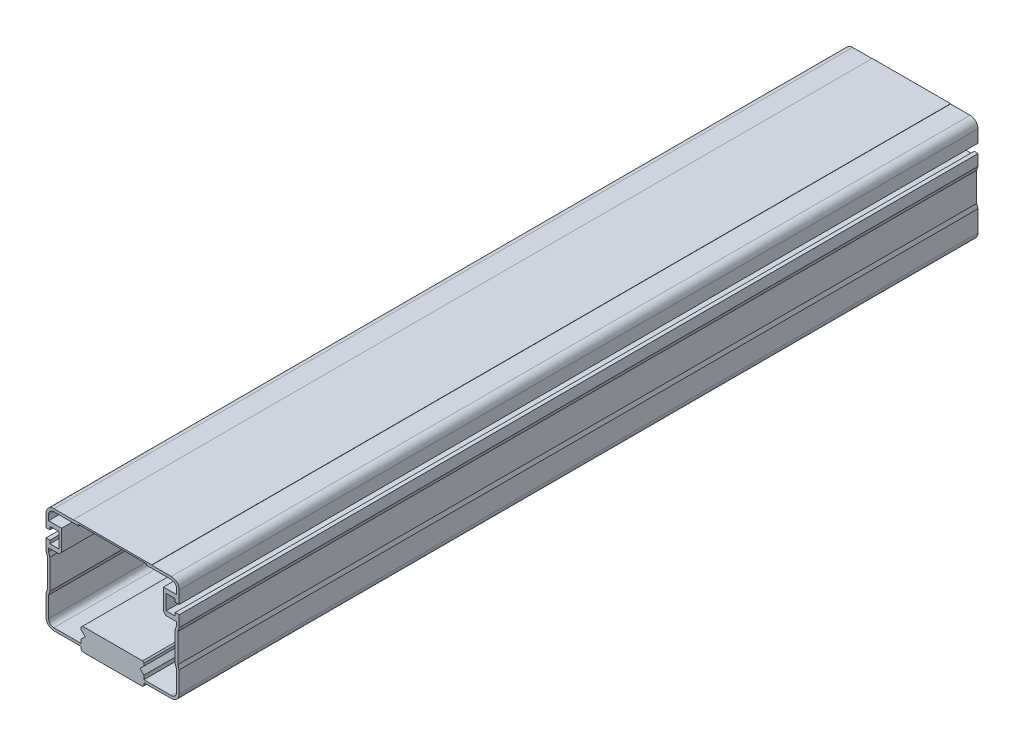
ISO-10303-21;
HEADER;
FILE_DESCRIPTION(('STEP AP214'),'2;1');
FILE_NAME('part.step','',(''),(''),'','','');
FILE_SCHEMA(('AUTOMOTIVE_DESIGN { 1 0 10303 214 1 1 1 1 }'));
ENDSEC;
DATA;
#1=APPLICATION_CONTEXT('core data for automotive mechanical design processes');
#2=APPLICATION_PROTOCOL_DEFINITION('international standard','automotive_design',2000,#1);
#3=PRODUCT_CONTEXT('',#1,'mechanical');
#4=PRODUCT('Part','Part','',(#3));
#5=PRODUCT_RELATED_PRODUCT_CATEGORY('part','',(#4));
#6=PRODUCT_DEFINITION_FORMATION('','',#4);
#7=PRODUCT_DEFINITION_CONTEXT('part definition',#1,'design');
#8=PRODUCT_DEFINITION('design','',#6,#7);
#9=PRODUCT_DEFINITION_SHAPE('','',#8);
#10=(LENGTH_UNIT() NAMED_UNIT(*) SI_UNIT(.MILLI.,.METRE.));
#11=(NAMED_UNIT(*) PLANE_ANGLE_UNIT() SI_UNIT($,.RADIAN.));
#12=(NAMED_UNIT(*) SI_UNIT($,.STERADIAN.) SOLID_ANGLE_UNIT());
#13=UNCERTAINTY_MEASURE_WITH_UNIT(LENGTH_MEASURE(1.E-05),#10,'distance_accuracy_value','');
#14=(GEOMETRIC_REPRESENTATION_CONTEXT(3) GLOBAL_UNCERTAINTY_ASSIGNED_CONTEXT((#13)) GLOBAL_UNIT_ASSIGNED_CONTEXT((#10,
#11,#12)) REPRESENTATION_CONTEXT('',''));
#15=CARTESIAN_POINT('',(0.,0.,0.));
#16=DIRECTION('',(0.,0.,1.));
#17=DIRECTION('',(1.,0.,0.));
#18=AXIS2_PLACEMENT_3D('',#15,#16,#17);
#19=CARTESIAN_POINT('',(22.5000000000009,39.0000000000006,306.));
#20=DIRECTION('',(0.,0.,1.));
#21=DIRECTION('',(1.,0.,0.));
#22=AXIS2_PLACEMENT_3D('',#19,#20,#21);
#23=PLANE('',#22);
#24=CARTESIAN_POINT('',(22.5000000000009,39.0000000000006,306.));
#25=DIRECTION('',(0.,0.,1.));
#26=DIRECTION('',(1.,0.,0.));
#27=AXIS2_PLACEMENT_3D('',#24,#25,#26);
#28=CIRCLE('',#27,3.);
#29=CARTESIAN_POINT('',(25.5000000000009,39.0000000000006,306.));
#30=VERTEX_POINT('',#29);
#31=CARTESIAN_POINT('',(22.5000000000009,42.0000000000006,306.));
#32=VERTEX_POINT('',#31);
#33=EDGE_CURVE('E863',#30,#32,#28,.T.);
#34=ORIENTED_EDGE('',*,*,#33,.T.);
#35=DIRECTION('',(-1.,0.,0.));
#36=VECTOR('',#35,1.);
#37=CARTESIAN_POINT('',(22.5000000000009,42.0000000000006,306.));
#38=LINE('',#37,#36);
#39=CARTESIAN_POINT('',(15.0000000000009,42.0000000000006,306.));
#40=VERTEX_POINT('',#39);
#41=EDGE_CURVE('E866',#32,#40,#38,.T.);
#42=ORIENTED_EDGE('',*,*,#41,.T.);
#43=DIRECTION('',(0.,1.,0.));
#44=VECTOR('',#43,1.);
#45=CARTESIAN_POINT('',(15.0000000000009,42.0000000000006,306.));
#46=LINE('',#45,#44);
#47=CARTESIAN_POINT('',(15.0000000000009,42.1000000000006,306.));
#48=VERTEX_POINT('',#47);
#49=EDGE_CURVE('E869',#40,#48,#46,.T.);
#50=ORIENTED_EDGE('',*,*,#49,.T.);
#51=DIRECTION('',(-1.,0.,0.));
#52=VECTOR('',#51,1.);
#53=CARTESIAN_POINT('',(15.0000000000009,42.1000000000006,306.));
#54=LINE('',#53,#52);
#55=CARTESIAN_POINT('',(-14.9999999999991,42.1000000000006,306.));
#56=VERTEX_POINT('',#55);
#57=EDGE_CURVE('E871',#48,#56,#54,.T.);
#58=ORIENTED_EDGE('',*,*,#57,.T.);
#59=DIRECTION('',(0.,-1.,0.));
#60=VECTOR('',#59,1.);
#61=CARTESIAN_POINT('',(-14.9999999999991,42.1000000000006,306.));
#62=LINE('',#61,#60);
#63=CARTESIAN_POINT('',(-14.9999999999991,42.0000000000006,306.));
#64=VERTEX_POINT('',#63);
#65=EDGE_CURVE('E873',#56,#64,#62,.T.);
#66=ORIENTED_EDGE('',*,*,#65,.T.);
#67=DIRECTION('',(-1.,0.,0.));
#68=VECTOR('',#67,1.);
#69=CARTESIAN_POINT('',(-14.9999999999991,42.0000000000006,306.));
#70=LINE('',#69,#68);
#71=CARTESIAN_POINT('',(-22.4999999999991,42.0000000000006,306.));
#72=VERTEX_POINT('',#71);
#73=EDGE_CURVE('E875',#64,#72,#70,.T.);
#74=ORIENTED_EDGE('',*,*,#73,.T.);
#75=CARTESIAN_POINT('',(-22.4999999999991,39.0000000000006,306.));
#76=DIRECTION('',(0.,0.,1.));
#77=DIRECTION('',(1.,0.,0.));
#78=AXIS2_PLACEMENT_3D('',#75,#76,#77);
#79=CIRCLE('',#78,3.);
#80=CARTESIAN_POINT('',(-25.4999999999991,39.0000000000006,306.));
#81=VERTEX_POINT('',#80);
#82=EDGE_CURVE('E877',#72,#81,#79,.T.);
#83=ORIENTED_EDGE('',*,*,#82,.T.);
#84=DIRECTION('',(0.,-1.,0.));
#85=VECTOR('',#84,1.);
#86=CARTESIAN_POINT('',(-25.4999999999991,39.0000000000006,306.));
#87=LINE('',#86,#85);
#88=CARTESIAN_POINT('',(-25.4999999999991,34.2000000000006,306.));
#89=VERTEX_POINT('',#88);
#90=EDGE_CURVE('E879',#81,#89,#87,.T.);
#91=ORIENTED_EDGE('',*,*,#90,.T.);
#92=DIRECTION('',(1.,0.,0.));
#93=VECTOR('',#92,1.);
#94=CARTESIAN_POINT('',(-25.4999999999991,34.2000000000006,306.));
#95=LINE('',#94,#93);
#96=CARTESIAN_POINT('',(-23.9999999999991,34.2000000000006,306.));
#97=VERTEX_POINT('',#96);
#98=EDGE_CURVE('E881',#89,#97,#95,.T.);
#99=ORIENTED_EDGE('',*,*,#98,.T.);
#100=DIRECTION('',(0.,1.,0.));
#101=VECTOR('',#100,1.);
#102=CARTESIAN_POINT('',(-23.9999999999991,34.2000000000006,306.));
#103=LINE('',#102,#101);
#104=CARTESIAN_POINT('',(-23.9999999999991,35.4000000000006,306.));
#105=VERTEX_POINT('',#104);
#106=EDGE_CURVE('E883',#97,#105,#103,.T.);
#107=ORIENTED_EDGE('',*,*,#106,.T.);
#108=DIRECTION('',(1.,0.,0.));
#109=VECTOR('',#108,1.);
#110=CARTESIAN_POINT('',(-23.9999999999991,35.4000000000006,306.));
#111=LINE('',#110,#109);
#112=CARTESIAN_POINT('',(-20.4999999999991,35.4000000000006,306.));
#113=VERTEX_POINT('',#112);
#114=EDGE_CURVE('E885',#105,#113,#111,.T.);
#115=ORIENTED_EDGE('',*,*,#114,.T.);
#116=DIRECTION('',(0.,-1.,0.));
#117=VECTOR('',#116,1.);
#118=CARTESIAN_POINT('',(-20.4999999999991,35.4000000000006,306.));
#119=LINE('',#118,#117);
#120=CARTESIAN_POINT('',(-20.4999999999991,29.6000000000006,306.));
#121=VERTEX_POINT('',#120);
#122=EDGE_CURVE('E887',#113,#121,#119,.T.);
#123=ORIENTED_EDGE('',*,*,#122,.T.);
#124=DIRECTION('',(-1.,0.,0.));
#125=VECTOR('',#124,1.);
#126=CARTESIAN_POINT('',(-20.4999999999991,29.6000000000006,306.));
#127=LINE('',#126,#125);
#128=CARTESIAN_POINT('',(-23.9999999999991,29.6000000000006,306.));
#129=VERTEX_POINT('',#128);
#130=EDGE_CURVE('E889',#121,#129,#127,.T.);
#131=ORIENTED_EDGE('',*,*,#130,.T.);
#132=DIRECTION('',(0.,1.,0.));
#133=VECTOR('',#132,1.);
#134=CARTESIAN_POINT('',(-23.9999999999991,29.6000000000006,306.));
#135=LINE('',#134,#133);
#136=CARTESIAN_POINT('',(-23.9999999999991,30.8000000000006,306.));
#137=VERTEX_POINT('',#136);
#138=EDGE_CURVE('E891',#129,#137,#135,.T.);
#139=ORIENTED_EDGE('',*,*,#138,.T.);
#140=DIRECTION('',(-1.,0.,0.));
#141=VECTOR('',#140,1.);
#142=CARTESIAN_POINT('',(-23.9999999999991,30.8000000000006,306.));
#143=LINE('',#142,#141);
#144=CARTESIAN_POINT('',(-25.4999999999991,30.8000000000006,306.));
#145=VERTEX_POINT('',#144);
#146=EDGE_CURVE('E893',#137,#145,#143,.T.);
#147=ORIENTED_EDGE('',*,*,#146,.T.);
#148=DIRECTION('',(0.,-1.,0.));
#149=VECTOR('',#148,1.);
#150=CARTESIAN_POINT('',(-25.4999999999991,30.8000000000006,306.));
#151=LINE('',#150,#149);
#152=CARTESIAN_POINT('',(-25.4999999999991,26.500000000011,306.));
#153=VERTEX_POINT('',#152);
#154=EDGE_CURVE('E895',#145,#153,#151,.T.);
#155=ORIENTED_EDGE('',*,*,#154,.T.);
#156=DIRECTION('',(0.316227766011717,-0.948683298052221,0.));
#157=VECTOR('',#156,1.);
#158=CARTESIAN_POINT('',(-25.4999999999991,26.500000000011,306.));
#159=LINE('',#158,#157);
#160=CARTESIAN_POINT('',(-25.0000000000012,24.9999999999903,306.));
#161=VERTEX_POINT('',#160);
#162=EDGE_CURVE('E897',#153,#161,#159,.T.);
#163=ORIENTED_EDGE('',*,*,#162,.T.);
#164=DIRECTION('',(0.,-1.,0.));
#165=VECTOR('',#164,1.);
#166=CARTESIAN_POINT('',(-25.0000000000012,24.9999999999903,306.));
#167=LINE('',#166,#165);
#168=CARTESIAN_POINT('',(-25.0000000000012,14.000000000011,306.));
#169=VERTEX_POINT('',#168);
#170=EDGE_CURVE('E899',#161,#169,#167,.T.);
#171=ORIENTED_EDGE('',*,*,#170,.T.);
#172=DIRECTION('',(-0.316227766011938,-0.948683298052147,0.));
#173=VECTOR('',#172,1.);
#174=CARTESIAN_POINT('',(-25.0000000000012,14.000000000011,306.));
#175=LINE('',#174,#173);
#176=CARTESIAN_POINT('',(-25.4999999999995,12.4999999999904,306.));
#177=VERTEX_POINT('',#176);
#178=EDGE_CURVE('E901',#169,#177,#175,.T.);
#179=ORIENTED_EDGE('',*,*,#178,.T.);
#180=DIRECTION('',(0.,-1.,0.));
#181=VECTOR('',#180,1.);
#182=CARTESIAN_POINT('',(-25.4999999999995,12.4999999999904,306.));
#183=LINE('',#182,#181);
#184=CARTESIAN_POINT('',(-25.4999999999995,4.50000000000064,306.));
#185=VERTEX_POINT('',#184);
#186=EDGE_CURVE('E903',#177,#185,#183,.T.);
#187=ORIENTED_EDGE('',*,*,#186,.T.);
#188=CARTESIAN_POINT('',(-22.4999999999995,4.50000000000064,306.));
#189=DIRECTION('',(0.,0.,1.));
#190=DIRECTION('',(1.,0.,0.));
#191=AXIS2_PLACEMENT_3D('',#188,#189,#190);
#192=CIRCLE('',#191,3.);
#193=CARTESIAN_POINT('',(-22.4999999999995,1.50000000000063,306.));
#194=VERTEX_POINT('',#193);
#195=EDGE_CURVE('E905',#185,#194,#192,.T.);
#196=ORIENTED_EDGE('',*,*,#195,.T.);
#197=DIRECTION('',(1.,0.,0.));
#198=VECTOR('',#197,1.);
#199=CARTESIAN_POINT('',(-22.4999999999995,1.50000000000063,306.));
#200=LINE('',#199,#198);
#201=CARTESIAN_POINT('',(-11.9999999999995,1.50000000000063,306.));
#202=VERTEX_POINT('',#201);
#203=EDGE_CURVE('E907',#194,#202,#200,.T.);
#204=ORIENTED_EDGE('',*,*,#203,.T.);
#205=DIRECTION('',(0.,-1.,0.));
#206=VECTOR('',#205,1.);
#207=CARTESIAN_POINT('',(-11.9999999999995,1.50000000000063,306.));
#208=LINE('',#207,#206);
#209=CARTESIAN_POINT('',(-11.9999999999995,0.499999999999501,306.));
#210=VERTEX_POINT('',#209);
#211=EDGE_CURVE('E909',#202,#210,#208,.T.);
#212=ORIENTED_EDGE('',*,*,#211,.T.);
#213=DIRECTION('',(0.707106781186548,-0.707106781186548,0.));
#214=VECTOR('',#213,1.);
#215=CARTESIAN_POINT('',(-11.9999999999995,0.499999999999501,306.));
#216=LINE('',#215,#214);
#217=CARTESIAN_POINT('',(-11.5,0.,306.));
#218=VERTEX_POINT('',#217);
#219=EDGE_CURVE('E911',#210,#218,#216,.T.);
#220=ORIENTED_EDGE('',*,*,#219,.T.);
#221=DIRECTION('',(1.,0.,0.));
#222=VECTOR('',#221,1.);
#223=CARTESIAN_POINT('',(-11.5,0.,306.));
#224=LINE('',#223,#222);
#225=CARTESIAN_POINT('',(11.5000000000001,3.95516952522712E-13,306.));
#226=VERTEX_POINT('',#225);
#227=EDGE_CURVE('E913',#218,#226,#224,.T.);
#228=ORIENTED_EDGE('',*,*,#227,.T.);
#229=DIRECTION('',(0.707106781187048,0.707106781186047,0.));
#230=VECTOR('',#229,1.);
#231=CARTESIAN_POINT('',(11.5000000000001,3.95516952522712E-13,306.));
#232=LINE('',#231,#230);
#233=CARTESIAN_POINT('',(11.9999999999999,0.499999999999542,306.));
#234=VERTEX_POINT('',#233);
#235=EDGE_CURVE('E915',#226,#234,#232,.T.);
#236=ORIENTED_EDGE('',*,*,#235,.T.);
#237=DIRECTION('',(0.,1.,0.));
#238=VECTOR('',#237,1.);
#239=CARTESIAN_POINT('',(11.9999999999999,0.499999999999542,306.));
#240=LINE('',#239,#238);
#241=CARTESIAN_POINT('',(11.9999999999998,1.50000000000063,306.));
#242=VERTEX_POINT('',#241);
#243=EDGE_CURVE('E917',#234,#242,#240,.T.);
#244=ORIENTED_EDGE('',*,*,#243,.T.);
#245=DIRECTION('',(1.,0.,0.));
#246=VECTOR('',#245,1.);
#247=CARTESIAN_POINT('',(11.9999999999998,1.50000000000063,306.));
#248=LINE('',#247,#246);
#249=CARTESIAN_POINT('',(22.4999999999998,1.50000000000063,306.));
#250=VERTEX_POINT('',#249);
#251=EDGE_CURVE('E919',#242,#250,#248,.T.);
#252=ORIENTED_EDGE('',*,*,#251,.T.);
#253=CARTESIAN_POINT('',(22.4999999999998,4.50000000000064,306.));
#254=DIRECTION('',(0.,0.,1.));
#255=DIRECTION('',(1.,0.,0.));
#256=AXIS2_PLACEMENT_3D('',#253,#254,#255);
#257=CIRCLE('',#256,3.);
#258=CARTESIAN_POINT('',(25.4999999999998,4.50000000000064,306.));
#259=VERTEX_POINT('',#258);
#260=EDGE_CURVE('E921',#250,#259,#257,.T.);
#261=ORIENTED_EDGE('',*,*,#260,.T.);
#262=DIRECTION('',(0.,1.,0.));
#263=VECTOR('',#262,1.);
#264=CARTESIAN_POINT('',(25.4999999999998,4.50000000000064,306.));
#265=LINE('',#264,#263);
#266=CARTESIAN_POINT('',(25.4999999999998,12.4999999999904,306.));
#267=VERTEX_POINT('',#266);
#268=EDGE_CURVE('E923',#259,#267,#265,.T.);
#269=ORIENTED_EDGE('',*,*,#268,.T.);
#270=DIRECTION('',(-0.316227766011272,0.948683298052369,0.));
#271=VECTOR('',#270,1.);
#272=CARTESIAN_POINT('',(25.4999999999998,12.4999999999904,306.));
#273=LINE('',#272,#271);
#274=CARTESIAN_POINT('',(25.0000000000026,14.0000000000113,306.));
#275=VERTEX_POINT('',#274);
#276=EDGE_CURVE('E925',#267,#275,#273,.T.);
#277=ORIENTED_EDGE('',*,*,#276,.T.);
#278=DIRECTION('',(0.,1.,0.));
#279=VECTOR('',#278,1.);
#280=CARTESIAN_POINT('',(25.0000000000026,14.0000000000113,306.));
#281=LINE('',#280,#279);
#282=CARTESIAN_POINT('',(25.0000000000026,24.9999999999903,306.));
#283=VERTEX_POINT('',#282);
#284=EDGE_CURVE('E927',#275,#283,#281,.T.);
#285=ORIENTED_EDGE('',*,*,#284,.T.);
#286=DIRECTION('',(0.316227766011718,0.948683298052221,0.));
#287=VECTOR('',#286,1.);
#288=CARTESIAN_POINT('',(25.0000000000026,24.9999999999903,306.));
#289=LINE('',#288,#287);
#290=CARTESIAN_POINT('',(25.5000000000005,26.500000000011,306.));
#291=VERTEX_POINT('',#290);
#292=EDGE_CURVE('E929',#283,#291,#289,.T.);
#293=ORIENTED_EDGE('',*,*,#292,.T.);
#294=DIRECTION('',(0.,1.,0.));
#295=VECTOR('',#294,1.);
#296=CARTESIAN_POINT('',(25.5000000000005,26.500000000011,306.));
#297=LINE('',#296,#295);
#298=CARTESIAN_POINT('',(25.5000000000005,30.8000000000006,306.));
#299=VERTEX_POINT('',#298);
#300=EDGE_CURVE('E931',#291,#299,#297,.T.);
#301=ORIENTED_EDGE('',*,*,#300,.T.);
#302=DIRECTION('',(-1.,0.,0.));
#303=VECTOR('',#302,1.);
#304=CARTESIAN_POINT('',(25.5000000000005,30.8000000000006,306.));
#305=LINE('',#304,#303);
#306=CARTESIAN_POINT('',(24.0000000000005,30.8000000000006,306.));
#307=VERTEX_POINT('',#306);
#308=EDGE_CURVE('E933',#299,#307,#305,.T.);
#309=ORIENTED_EDGE('',*,*,#308,.T.);
#310=DIRECTION('',(0.,-1.,0.));
#311=VECTOR('',#310,1.);
#312=CARTESIAN_POINT('',(24.0000000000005,30.8000000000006,306.));
#313=LINE('',#312,#311);
#314=CARTESIAN_POINT('',(24.0000000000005,29.6000000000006,306.));
#315=VERTEX_POINT('',#314);
#316=EDGE_CURVE('E935',#307,#315,#313,.T.);
#317=ORIENTED_EDGE('',*,*,#316,.T.);
#318=DIRECTION('',(-1.,0.,0.));
#319=VECTOR('',#318,1.);
#320=CARTESIAN_POINT('',(24.0000000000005,29.6000000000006,306.));
#321=LINE('',#320,#319);
#322=CARTESIAN_POINT('',(20.5000000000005,29.6000000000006,306.));
#323=VERTEX_POINT('',#322);
#324=EDGE_CURVE('E937',#315,#323,#321,.T.);
#325=ORIENTED_EDGE('',*,*,#324,.T.);
#326=DIRECTION('',(0.,1.,0.));
#327=VECTOR('',#326,1.);
#328=CARTESIAN_POINT('',(20.5000000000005,29.6000000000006,306.));
#329=LINE('',#328,#327);
#330=CARTESIAN_POINT('',(20.5000000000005,35.4000000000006,306.));
#331=VERTEX_POINT('',#330);
#332=EDGE_CURVE('E939',#323,#331,#329,.T.);
#333=ORIENTED_EDGE('',*,*,#332,.T.);
#334=DIRECTION('',(1.,0.,0.));
#335=VECTOR('',#334,1.);
#336=CARTESIAN_POINT('',(20.5000000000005,35.4000000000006,306.));
#337=LINE('',#336,#335);
#338=CARTESIAN_POINT('',(24.0000000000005,35.4000000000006,306.));
#339=VERTEX_POINT('',#338);
#340=EDGE_CURVE('E941',#331,#339,#337,.T.);
#341=ORIENTED_EDGE('',*,*,#340,.T.);
#342=DIRECTION('',(0.,-1.,0.));
#343=VECTOR('',#342,1.);
#344=CARTESIAN_POINT('',(24.0000000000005,35.4000000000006,306.));
#345=LINE('',#344,#343);
#346=CARTESIAN_POINT('',(24.0000000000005,34.2000000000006,306.));
#347=VERTEX_POINT('',#346);
#348=EDGE_CURVE('E943',#339,#347,#345,.T.);
#349=ORIENTED_EDGE('',*,*,#348,.T.);
#350=DIRECTION('',(1.,0.,0.));
#351=VECTOR('',#350,1.);
#352=CARTESIAN_POINT('',(24.0000000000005,34.2000000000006,306.));
#353=LINE('',#352,#351);
#354=CARTESIAN_POINT('',(25.5000000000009,34.2000000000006,306.));
#355=VERTEX_POINT('',#354);
#356=EDGE_CURVE('E945',#347,#355,#353,.T.);
#357=ORIENTED_EDGE('',*,*,#356,.T.);
#358=DIRECTION('',(0.,1.,0.));
#359=VECTOR('',#358,1.);
#360=CARTESIAN_POINT('',(25.5000000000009,34.2000000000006,306.));
#361=LINE('',#360,#359);
#362=EDGE_CURVE('E947',#355,#30,#361,.T.);
#363=ORIENTED_EDGE('',*,*,#362,.T.);
#364=EDGE_LOOP('',(#34,#42,#50,#58,#66,#74,#83,#91,#99,#107,#115,#123,#131,#139,#147,#155,#163,
#171,#179,#187,#196,#204,#212,#220,#228,#236,#244,#252,#261,#269,#277,#285,#293,#301,#309,#317,
#325,#333,#341,#349,#357,#363));
#365=FACE_BOUND('',#364,.T.);
#366=DIRECTION('',(0.,1.,0.));
#367=VECTOR('',#366,1.);
#368=CARTESIAN_POINT('',(24.4999999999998,4.50000000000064,306.));
#369=LINE('',#368,#367);
#370=CARTESIAN_POINT('',(24.4999999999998,4.50000000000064,306.));
#371=VERTEX_POINT('',#370);
#372=CARTESIAN_POINT('',(24.4999999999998,12.3377223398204,306.));
#373=VERTEX_POINT('',#372);
#374=EDGE_CURVE('E566',#371,#373,#369,.T.);
#375=ORIENTED_EDGE('',*,*,#374,.F.);
#376=CARTESIAN_POINT('',(22.4999999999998,4.50000000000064,306.));
#377=DIRECTION('',(0.,0.,1.));
#378=DIRECTION('',(1.,0.,0.));
#379=AXIS2_PLACEMENT_3D('',#376,#377,#378);
#380=CIRCLE('',#379,2.);
#381=CARTESIAN_POINT('',(22.4999999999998,2.50000000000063,306.));
#382=VERTEX_POINT('',#381);
#383=EDGE_CURVE('E558',#382,#371,#380,.T.);
#384=ORIENTED_EDGE('',*,*,#383,.F.);
#385=DIRECTION('',(1.,0.,0.));
#386=VECTOR('',#385,1.);
#387=CARTESIAN_POINT('',(11.9999999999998,2.50000000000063,306.));
#388=LINE('',#387,#386);
#389=CARTESIAN_POINT('',(11.9999999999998,2.50000000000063,306.));
#390=VERTEX_POINT('',#389);
#391=EDGE_CURVE('E660',#390,#382,#388,.T.);
#392=ORIENTED_EDGE('',*,*,#391,.F.);
#393=DIRECTION('',(0.,-1.,0.));
#394=VECTOR('',#393,1.);
#395=CARTESIAN_POINT('',(11.9999999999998,4.00000000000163,306.));
#396=LINE('',#395,#394);
#397=CARTESIAN_POINT('',(11.9999999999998,4.00000000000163,306.));
#398=VERTEX_POINT('',#397);
#399=EDGE_CURVE('E658',#398,#390,#396,.T.);
#400=ORIENTED_EDGE('',*,*,#399,.F.);
#401=DIRECTION('',(0.707106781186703,-0.707106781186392,0.));
#402=VECTOR('',#401,1.);
#403=CARTESIAN_POINT('',(10.5000000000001,5.50000000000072,306.));
#404=LINE('',#403,#402);
#405=CARTESIAN_POINT('',(10.5000000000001,5.50000000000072,306.));
#406=VERTEX_POINT('',#405);
#407=EDGE_CURVE('E656',#406,#398,#404,.T.);
#408=ORIENTED_EDGE('',*,*,#407,.F.);
#409=DIRECTION('',(-0.707106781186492,-0.707106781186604,0.));
#410=VECTOR('',#409,1.);
#411=CARTESIAN_POINT('',(11.9999999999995,7.00000000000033,306.));
#412=LINE('',#411,#410);
#413=CARTESIAN_POINT('',(11.9999999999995,7.00000000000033,306.));
#414=VERTEX_POINT('',#413);
#415=EDGE_CURVE('E654',#414,#406,#412,.T.);
#416=ORIENTED_EDGE('',*,*,#415,.F.);
#417=DIRECTION('',(0.,-1.,0.));
#418=VECTOR('',#417,1.);
#419=CARTESIAN_POINT('',(11.9999999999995,8.00000000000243,306.));
#420=LINE('',#419,#418);
#421=CARTESIAN_POINT('',(11.9999999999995,8.00000000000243,306.));
#422=VERTEX_POINT('',#421);
#423=EDGE_CURVE('E652',#422,#414,#420,.T.);
#424=ORIENTED_EDGE('',*,*,#423,.F.);
#425=DIRECTION('',(0.707106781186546,-0.707106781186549,0.));
#426=VECTOR('',#425,1.);
#427=CARTESIAN_POINT('',(11.5,8.50000000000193,306.));
#428=LINE('',#427,#426);
#429=CARTESIAN_POINT('',(11.5,8.50000000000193,306.));
#430=VERTEX_POINT('',#429);
#431=EDGE_CURVE('E650',#430,#422,#428,.T.);
#432=ORIENTED_EDGE('',*,*,#431,.F.);
#433=DIRECTION('',(1.,0.,0.));
#434=VECTOR('',#433,1.);
#435=CARTESIAN_POINT('',(-11.5000000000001,8.50000000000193,306.));
#436=LINE('',#435,#434);
#437=CARTESIAN_POINT('',(-11.5000000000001,8.50000000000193,306.));
#438=VERTEX_POINT('',#437);
#439=EDGE_CURVE('E648',#438,#430,#436,.T.);
#440=ORIENTED_EDGE('',*,*,#439,.F.);
#441=DIRECTION('',(0.707106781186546,0.707106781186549,0.));
#442=VECTOR('',#441,1.);
#443=CARTESIAN_POINT('',(-11.9999999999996,8.00000000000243,306.));
#444=LINE('',#443,#442);
#445=CARTESIAN_POINT('',(-11.9999999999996,8.00000000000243,306.));
#446=VERTEX_POINT('',#445);
#447=EDGE_CURVE('E646',#446,#438,#444,.T.);
#448=ORIENTED_EDGE('',*,*,#447,.F.);
#449=DIRECTION('',(0.,1.,0.));
#450=VECTOR('',#449,1.);
#451=CARTESIAN_POINT('',(-11.9999999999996,7.00000000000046,306.));
#452=LINE('',#451,#450);
#453=CARTESIAN_POINT('',(-11.9999999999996,7.00000000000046,306.));
#454=VERTEX_POINT('',#453);
#455=EDGE_CURVE('E644',#454,#446,#452,.T.);
#456=ORIENTED_EDGE('',*,*,#455,.F.);
#457=DIRECTION('',(-0.707106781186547,0.707106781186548,0.));
#458=VECTOR('',#457,1.);
#459=CARTESIAN_POINT('',(-10.5000000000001,5.50000000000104,306.));
#460=LINE('',#459,#458);
#461=CARTESIAN_POINT('',(-10.5000000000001,5.50000000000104,306.));
#462=VERTEX_POINT('',#461);
#463=EDGE_CURVE('E642',#462,#454,#460,.T.);
#464=ORIENTED_EDGE('',*,*,#463,.F.);
#465=DIRECTION('',(0.707106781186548,0.707106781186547,0.));
#466=VECTOR('',#465,1.);
#467=CARTESIAN_POINT('',(-11.9999999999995,4.00000000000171,306.));
#468=LINE('',#467,#466);
#469=CARTESIAN_POINT('',(-11.9999999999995,4.00000000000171,306.));
#470=VERTEX_POINT('',#469);
#471=EDGE_CURVE('E640',#470,#462,#468,.T.);
#472=ORIENTED_EDGE('',*,*,#471,.F.);
#473=DIRECTION('',(0.,1.,0.));
#474=VECTOR('',#473,1.);
#475=CARTESIAN_POINT('',(-11.9999999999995,2.50000000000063,306.));
#476=LINE('',#475,#474);
#477=CARTESIAN_POINT('',(-11.9999999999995,2.50000000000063,306.));
#478=VERTEX_POINT('',#477);
#479=EDGE_CURVE('E638',#478,#470,#476,.T.);
#480=ORIENTED_EDGE('',*,*,#479,.F.);
#481=DIRECTION('',(1.,0.,0.));
#482=VECTOR('',#481,1.);
#483=CARTESIAN_POINT('',(-22.4999999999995,2.50000000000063,306.));
#484=LINE('',#483,#482);
#485=CARTESIAN_POINT('',(-22.4999999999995,2.50000000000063,306.));
#486=VERTEX_POINT('',#485);
#487=EDGE_CURVE('E636',#486,#478,#484,.T.);
#488=ORIENTED_EDGE('',*,*,#487,.F.);
#489=CARTESIAN_POINT('',(-22.4999999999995,4.50000000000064,306.));
#490=DIRECTION('',(0.,0.,1.));
#491=DIRECTION('',(1.,0.,0.));
#492=AXIS2_PLACEMENT_3D('',#489,#490,#491);
#493=CIRCLE('',#492,2.);
#494=CARTESIAN_POINT('',(-24.4999999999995,4.50000000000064,306.));
#495=VERTEX_POINT('',#494);
#496=EDGE_CURVE('E634',#495,#486,#493,.T.);
#497=ORIENTED_EDGE('',*,*,#496,.F.);
#498=DIRECTION('',(0.,-1.,0.));
#499=VECTOR('',#498,1.);
#500=CARTESIAN_POINT('',(-24.4999999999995,12.3377223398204,306.));
#501=LINE('',#500,#499);
#502=CARTESIAN_POINT('',(-24.4999999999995,12.3377223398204,306.));
#503=VERTEX_POINT('',#502);
#504=EDGE_CURVE('E632',#503,#495,#501,.T.);
#505=ORIENTED_EDGE('',*,*,#504,.F.);
#506=DIRECTION('',(-0.316227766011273,-0.948683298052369,0.));
#507=VECTOR('',#506,1.);
#508=CARTESIAN_POINT('',(-24.0000000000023,13.8377223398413,306.));
#509=LINE('',#508,#507);
#510=CARTESIAN_POINT('',(-24.0000000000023,13.8377223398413,306.));
#511=VERTEX_POINT('',#510);
#512=EDGE_CURVE('E630',#511,#503,#509,.T.);
#513=ORIENTED_EDGE('',*,*,#512,.F.);
#514=DIRECTION('',(0.,-1.,0.));
#515=VECTOR('',#514,1.);
#516=CARTESIAN_POINT('',(-24.0000000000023,25.1622776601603,306.));
#517=LINE('',#516,#515);
#518=CARTESIAN_POINT('',(-24.0000000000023,25.1622776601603,306.));
#519=VERTEX_POINT('',#518);
#520=EDGE_CURVE('E628',#519,#511,#517,.T.);
#521=ORIENTED_EDGE('',*,*,#520,.F.);
#522=DIRECTION('',(0.316227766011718,-0.948683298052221,0.));
#523=VECTOR('',#522,1.);
#524=CARTESIAN_POINT('',(-24.5000000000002,26.662277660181,306.));
#525=LINE('',#524,#523);
#526=CARTESIAN_POINT('',(-24.5000000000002,26.662277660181,306.));
#527=VERTEX_POINT('',#526);
#528=EDGE_CURVE('E626',#527,#519,#525,.T.);
#529=ORIENTED_EDGE('',*,*,#528,.F.);
#530=DIRECTION('',(0.,-1.,0.));
#531=VECTOR('',#530,1.);
#532=CARTESIAN_POINT('',(-24.5000000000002,28.0000000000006,306.));
#533=LINE('',#532,#531);
#534=CARTESIAN_POINT('',(-24.5000000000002,28.0000000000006,306.));
#535=VERTEX_POINT('',#534);
#536=EDGE_CURVE('E624',#535,#527,#533,.T.);
#537=ORIENTED_EDGE('',*,*,#536,.F.);
#538=DIRECTION('',(-1.,0.,0.));
#539=VECTOR('',#538,1.);
#540=CARTESIAN_POINT('',(-20.5000000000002,28.0000000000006,306.));
#541=LINE('',#540,#539);
#542=CARTESIAN_POINT('',(-20.5000000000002,28.0000000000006,306.));
#543=VERTEX_POINT('',#542);
#544=EDGE_CURVE('E622',#543,#535,#541,.T.);
#545=ORIENTED_EDGE('',*,*,#544,.F.);
#546=DIRECTION('',(-0.707106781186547,-0.707106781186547,0.));
#547=VECTOR('',#546,1.);
#548=CARTESIAN_POINT('',(-19.5000000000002,29.0000000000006,306.));
#549=LINE('',#548,#547);
#550=CARTESIAN_POINT('',(-19.5000000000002,29.0000000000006,306.));
#551=VERTEX_POINT('',#550);
#552=EDGE_CURVE('E620',#551,#543,#549,.T.);
#553=ORIENTED_EDGE('',*,*,#552,.F.);
#554=DIRECTION('',(0.,-1.,0.));
#555=VECTOR('',#554,1.);
#556=CARTESIAN_POINT('',(-19.5000000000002,37.0000000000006,306.));
#557=LINE('',#556,#555);
#558=CARTESIAN_POINT('',(-19.5000000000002,37.0000000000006,306.));
#559=VERTEX_POINT('',#558);
#560=EDGE_CURVE('E618',#559,#551,#557,.T.);
#561=ORIENTED_EDGE('',*,*,#560,.F.);
#562=DIRECTION('',(1.,0.,0.));
#563=VECTOR('',#562,1.);
#564=CARTESIAN_POINT('',(-24.5000000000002,37.0000000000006,306.));
#565=LINE('',#564,#563);
#566=CARTESIAN_POINT('',(-24.5000000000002,37.0000000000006,306.));
#567=VERTEX_POINT('',#566);
#568=EDGE_CURVE('E616',#567,#559,#565,.T.);
#569=ORIENTED_EDGE('',*,*,#568,.F.);
#570=DIRECTION('',(0.,-1.,0.));
#571=VECTOR('',#570,1.);
#572=CARTESIAN_POINT('',(-24.5000000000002,39.0000000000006,306.));
#573=LINE('',#572,#571);
#574=CARTESIAN_POINT('',(-24.5000000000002,39.0000000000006,306.));
#575=VERTEX_POINT('',#574);
#576=EDGE_CURVE('E614',#575,#567,#573,.T.);
#577=ORIENTED_EDGE('',*,*,#576,.F.);
#578=CARTESIAN_POINT('',(-22.5000000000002,39.0000000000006,306.));
#579=DIRECTION('',(0.,0.,1.));
#580=DIRECTION('',(1.,0.,0.));
#581=AXIS2_PLACEMENT_3D('',#578,#579,#580);
#582=CIRCLE('',#581,2.);
#583=CARTESIAN_POINT('',(-22.5000000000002,41.0000000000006,306.));
#584=VERTEX_POINT('',#583);
#585=EDGE_CURVE('E612',#584,#575,#582,.T.);
#586=ORIENTED_EDGE('',*,*,#585,.F.);
#587=DIRECTION('',(-1.,0.,0.));
#588=VECTOR('',#587,1.);
#589=CARTESIAN_POINT('',(-13.0000000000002,41.0000000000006,306.));
#590=LINE('',#589,#588);
#591=CARTESIAN_POINT('',(-13.0000000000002,41.0000000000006,306.));
#592=VERTEX_POINT('',#591);
#593=EDGE_CURVE('E610',#592,#584,#590,.T.);
#594=ORIENTED_EDGE('',*,*,#593,.F.);
#595=DIRECTION('',(0.,-1.,0.));
#596=VECTOR('',#595,1.);
#597=CARTESIAN_POINT('',(-13.0000000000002,41.5000000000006,306.));
#598=LINE('',#597,#596);
#599=CARTESIAN_POINT('',(-13.0000000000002,41.5000000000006,306.));
#600=VERTEX_POINT('',#599);
#601=EDGE_CURVE('E608',#600,#592,#598,.T.);
#602=ORIENTED_EDGE('',*,*,#601,.F.);
#603=DIRECTION('',(-1.,0.,0.));
#604=VECTOR('',#603,1.);
#605=CARTESIAN_POINT('',(12.9999999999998,41.5000000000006,306.));
#606=LINE('',#605,#604);
#607=CARTESIAN_POINT('',(12.9999999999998,41.5000000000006,306.));
#608=VERTEX_POINT('',#607);
#609=EDGE_CURVE('E606',#608,#600,#606,.T.);
#610=ORIENTED_EDGE('',*,*,#609,.F.);
#611=DIRECTION('',(0.,1.,0.));
#612=VECTOR('',#611,1.);
#613=CARTESIAN_POINT('',(12.9999999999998,41.0000000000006,306.));
#614=LINE('',#613,#612);
#615=CARTESIAN_POINT('',(12.9999999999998,41.0000000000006,306.));
#616=VERTEX_POINT('',#615);
#617=EDGE_CURVE('E604',#616,#608,#614,.T.);
#618=ORIENTED_EDGE('',*,*,#617,.F.);
#619=DIRECTION('',(-1.,0.,0.));
#620=VECTOR('',#619,1.);
#621=CARTESIAN_POINT('',(22.4999999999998,41.0000000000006,306.));
#622=LINE('',#621,#620);
#623=CARTESIAN_POINT('',(22.4999999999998,41.0000000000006,306.));
#624=VERTEX_POINT('',#623);
#625=EDGE_CURVE('E602',#624,#616,#622,.T.);
#626=ORIENTED_EDGE('',*,*,#625,.F.);
#627=CARTESIAN_POINT('',(22.4999999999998,39.0000000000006,306.));
#628=DIRECTION('',(0.,0.,1.));
#629=DIRECTION('',(1.,0.,0.));
#630=AXIS2_PLACEMENT_3D('',#627,#628,#629);
#631=CIRCLE('',#630,2.);
#632=CARTESIAN_POINT('',(24.4999999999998,39.0000000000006,306.));
#633=VERTEX_POINT('',#632);
#634=EDGE_CURVE('E600',#633,#624,#631,.T.);
#635=ORIENTED_EDGE('',*,*,#634,.F.);
#636=DIRECTION('',(0.,1.,0.));
#637=VECTOR('',#636,1.);
#638=CARTESIAN_POINT('',(24.4999999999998,37.0000000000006,306.));
#639=LINE('',#638,#637);
#640=CARTESIAN_POINT('',(24.4999999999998,37.0000000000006,306.));
#641=VERTEX_POINT('',#640);
#642=EDGE_CURVE('E598',#641,#633,#639,.T.);
#643=ORIENTED_EDGE('',*,*,#642,.F.);
#644=DIRECTION('',(1.,0.,0.));
#645=VECTOR('',#644,1.);
#646=CARTESIAN_POINT('',(19.4999999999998,37.0000000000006,306.));
#647=LINE('',#646,#645);
#648=CARTESIAN_POINT('',(19.4999999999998,37.0000000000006,306.));
#649=VERTEX_POINT('',#648);
#650=EDGE_CURVE('E596',#649,#641,#647,.T.);
#651=ORIENTED_EDGE('',*,*,#650,.F.);
#652=DIRECTION('',(0.,1.,0.));
#653=VECTOR('',#652,1.);
#654=CARTESIAN_POINT('',(19.4999999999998,29.0000000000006,306.));
#655=LINE('',#654,#653);
#656=CARTESIAN_POINT('',(19.4999999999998,29.0000000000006,306.));
#657=VERTEX_POINT('',#656);
#658=EDGE_CURVE('E594',#657,#649,#655,.T.);
#659=ORIENTED_EDGE('',*,*,#658,.F.);
#660=DIRECTION('',(-0.707106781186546,0.707106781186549,0.));
#661=VECTOR('',#660,1.);
#662=CARTESIAN_POINT('',(20.4999999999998,28.0000000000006,306.));
#663=LINE('',#662,#661);
#664=CARTESIAN_POINT('',(20.4999999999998,28.0000000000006,306.));
#665=VERTEX_POINT('',#664);
#666=EDGE_CURVE('E592',#665,#657,#663,.T.);
#667=ORIENTED_EDGE('',*,*,#666,.F.);
#668=DIRECTION('',(-1.,0.,0.));
#669=VECTOR('',#668,1.);
#670=CARTESIAN_POINT('',(24.4999999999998,28.0000000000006,306.));
#671=LINE('',#670,#669);
#672=CARTESIAN_POINT('',(24.4999999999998,28.0000000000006,306.));
#673=VERTEX_POINT('',#672);
#674=EDGE_CURVE('E590',#673,#665,#671,.T.);
#675=ORIENTED_EDGE('',*,*,#674,.F.);
#676=DIRECTION('',(-1.32270942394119E-13,1.,0.));
#677=VECTOR('',#676,1.);
#678=CARTESIAN_POINT('',(24.5,26.6622776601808,306.));
#679=LINE('',#678,#677);
#680=CARTESIAN_POINT('',(24.5,26.6622776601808,306.));
#681=VERTEX_POINT('',#680);
#682=EDGE_CURVE('E588',#681,#673,#679,.T.);
#683=ORIENTED_EDGE('',*,*,#682,.F.);
#684=DIRECTION('',(0.316227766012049,0.94868329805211,0.));
#685=VECTOR('',#684,1.);
#686=CARTESIAN_POINT('',(24.0000000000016,25.1622776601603,306.));
#687=LINE('',#686,#685);
#688=CARTESIAN_POINT('',(24.0000000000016,25.1622776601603,306.));
#689=VERTEX_POINT('',#688);
#690=EDGE_CURVE('E586',#689,#681,#687,.T.);
#691=ORIENTED_EDGE('',*,*,#690,.F.);
#692=DIRECTION('',(0.,1.,0.));
#693=VECTOR('',#692,1.);
#694=CARTESIAN_POINT('',(24.0000000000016,13.837722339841,306.));
#695=LINE('',#694,#693);
#696=CARTESIAN_POINT('',(24.0000000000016,13.837722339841,306.));
#697=VERTEX_POINT('',#696);
#698=EDGE_CURVE('E581',#697,#689,#695,.T.);
#699=ORIENTED_EDGE('',*,*,#698,.F.);
#700=DIRECTION('',(-0.316227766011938,0.948683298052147,0.));
#701=VECTOR('',#700,1.);
#702=CARTESIAN_POINT('',(24.4999999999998,12.3377223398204,306.));
#703=LINE('',#702,#701);
#704=EDGE_CURVE('E579',#373,#697,#703,.T.);
#705=ORIENTED_EDGE('',*,*,#704,.F.);
#706=EDGE_LOOP('',(#375,#384,#392,#400,#408,#416,#424,#432,#440,#448,#456,#464,#472,#480,#488,
#497,#505,#513,#521,#529,#537,#545,#553,#561,#569,#577,#586,#594,#602,#610,#618,#626,#635,#643,
#651,#659,#667,#675,#683,#691,#699,#705));
#707=FACE_BOUND('',#706,.T.);
#708=ADVANCED_FACE('F36',(#365,#707),#23,.T.);
#709=CARTESIAN_POINT('',(22.5000000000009,39.0000000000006,0.));
#710=DIRECTION('',(0.,0.,1.));
#711=DIRECTION('',(1.,0.,0.));
#712=AXIS2_PLACEMENT_3D('',#709,#710,#711);
#713=PLANE('',#712);
#714=CARTESIAN_POINT('',(22.5000000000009,39.0000000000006,0.));
#715=DIRECTION('',(0.,0.,1.));
#716=DIRECTION('',(1.,0.,0.));
#717=AXIS2_PLACEMENT_3D('',#714,#715,#716);
#718=CIRCLE('',#717,3.);
#719=CARTESIAN_POINT('',(25.5000000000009,39.0000000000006,0.));
#720=VERTEX_POINT('',#719);
#721=CARTESIAN_POINT('',(22.5000000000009,42.0000000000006,0.));
#722=VERTEX_POINT('',#721);
#723=EDGE_CURVE('E574',#720,#722,#718,.T.);
#724=ORIENTED_EDGE('',*,*,#723,.F.);
#725=DIRECTION('',(0.,1.,0.));
#726=VECTOR('',#725,1.);
#727=CARTESIAN_POINT('',(25.5000000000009,34.2000000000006,0.));
#728=LINE('',#727,#726);
#729=CARTESIAN_POINT('',(25.5000000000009,34.2000000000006,0.));
#730=VERTEX_POINT('',#729);
#731=EDGE_CURVE('E867',#730,#720,#728,.T.);
#732=ORIENTED_EDGE('',*,*,#731,.F.);
#733=DIRECTION('',(1.,0.,0.));
#734=VECTOR('',#733,1.);
#735=CARTESIAN_POINT('',(24.0000000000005,34.2000000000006,0.));
#736=LINE('',#735,#734);
#737=CARTESIAN_POINT('',(24.0000000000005,34.2000000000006,0.));
#738=VERTEX_POINT('',#737);
#739=EDGE_CURVE('E1030',#738,#730,#736,.T.);
#740=ORIENTED_EDGE('',*,*,#739,.F.);
#741=DIRECTION('',(0.,-1.,0.));
#742=VECTOR('',#741,1.);
#743=CARTESIAN_POINT('',(24.0000000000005,35.4000000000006,0.));
#744=LINE('',#743,#742);
#745=CARTESIAN_POINT('',(24.0000000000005,35.4000000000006,0.));
#746=VERTEX_POINT('',#745);
#747=EDGE_CURVE('E1028',#746,#738,#744,.T.);
#748=ORIENTED_EDGE('',*,*,#747,.F.);
#749=DIRECTION('',(1.,0.,0.));
#750=VECTOR('',#749,1.);
#751=CARTESIAN_POINT('',(20.5000000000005,35.4000000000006,0.));
#752=LINE('',#751,#750);
#753=CARTESIAN_POINT('',(20.5000000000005,35.4000000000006,0.));
#754=VERTEX_POINT('',#753);
#755=EDGE_CURVE('E1026',#754,#746,#752,.T.);
#756=ORIENTED_EDGE('',*,*,#755,.F.);
#757=DIRECTION('',(0.,1.,0.));
#758=VECTOR('',#757,1.);
#759=CARTESIAN_POINT('',(20.5000000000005,29.6000000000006,0.));
#760=LINE('',#759,#758);
#761=CARTESIAN_POINT('',(20.5000000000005,29.6000000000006,0.));
#762=VERTEX_POINT('',#761);
#763=EDGE_CURVE('E1024',#762,#754,#760,.T.);
#764=ORIENTED_EDGE('',*,*,#763,.F.);
#765=DIRECTION('',(-1.,0.,0.));
#766=VECTOR('',#765,1.);
#767=CARTESIAN_POINT('',(24.0000000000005,29.6000000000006,0.));
#768=LINE('',#767,#766);
#769=CARTESIAN_POINT('',(24.0000000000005,29.6000000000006,0.));
#770=VERTEX_POINT('',#769);
#771=EDGE_CURVE('E1022',#770,#762,#768,.T.);
#772=ORIENTED_EDGE('',*,*,#771,.F.);
#773=DIRECTION('',(0.,-1.,0.));
#774=VECTOR('',#773,1.);
#775=CARTESIAN_POINT('',(24.0000000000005,30.8000000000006,0.));
#776=LINE('',#775,#774);
#777=CARTESIAN_POINT('',(24.0000000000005,30.8000000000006,0.));
#778=VERTEX_POINT('',#777);
#779=EDGE_CURVE('E1020',#778,#770,#776,.T.);
#780=ORIENTED_EDGE('',*,*,#779,.F.);
#781=DIRECTION('',(-1.,0.,0.));
#782=VECTOR('',#781,1.);
#783=CARTESIAN_POINT('',(25.5000000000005,30.8000000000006,0.));
#784=LINE('',#783,#782);
#785=CARTESIAN_POINT('',(25.5000000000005,30.8000000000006,0.));
#786=VERTEX_POINT('',#785);
#787=EDGE_CURVE('E1018',#786,#778,#784,.T.);
#788=ORIENTED_EDGE('',*,*,#787,.F.);
#789=DIRECTION('',(0.,1.,0.));
#790=VECTOR('',#789,1.);
#791=CARTESIAN_POINT('',(25.5000000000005,26.500000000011,0.));
#792=LINE('',#791,#790);
#793=CARTESIAN_POINT('',(25.5000000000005,26.500000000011,0.));
#794=VERTEX_POINT('',#793);
#795=EDGE_CURVE('E1016',#794,#786,#792,.T.);
#796=ORIENTED_EDGE('',*,*,#795,.F.);
#797=DIRECTION('',(0.316227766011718,0.948683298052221,0.));
#798=VECTOR('',#797,1.);
#799=CARTESIAN_POINT('',(25.0000000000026,24.9999999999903,0.));
#800=LINE('',#799,#798);
#801=CARTESIAN_POINT('',(25.0000000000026,24.9999999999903,0.));
#802=VERTEX_POINT('',#801);
#803=EDGE_CURVE('E1014',#802,#794,#800,.T.);
#804=ORIENTED_EDGE('',*,*,#803,.F.);
#805=DIRECTION('',(0.,1.,0.));
#806=VECTOR('',#805,1.);
#807=CARTESIAN_POINT('',(25.0000000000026,14.0000000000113,0.));
#808=LINE('',#807,#806);
#809=CARTESIAN_POINT('',(25.0000000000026,14.0000000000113,0.));
#810=VERTEX_POINT('',#809);
#811=EDGE_CURVE('E1012',#810,#802,#808,.T.);
#812=ORIENTED_EDGE('',*,*,#811,.F.);
#813=DIRECTION('',(-0.316227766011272,0.948683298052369,0.));
#814=VECTOR('',#813,1.);
#815=CARTESIAN_POINT('',(25.4999999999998,12.4999999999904,0.));
#816=LINE('',#815,#814);
#817=CARTESIAN_POINT('',(25.4999999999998,12.4999999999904,0.));
#818=VERTEX_POINT('',#817);
#819=EDGE_CURVE('E1010',#818,#810,#816,.T.);
#820=ORIENTED_EDGE('',*,*,#819,.F.);
#821=DIRECTION('',(0.,1.,0.));
#822=VECTOR('',#821,1.);
#823=CARTESIAN_POINT('',(25.4999999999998,4.50000000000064,0.));
#824=LINE('',#823,#822);
#825=CARTESIAN_POINT('',(25.4999999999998,4.50000000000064,0.));
#826=VERTEX_POINT('',#825);
#827=EDGE_CURVE('E1008',#826,#818,#824,.T.);
#828=ORIENTED_EDGE('',*,*,#827,.F.);
#829=CARTESIAN_POINT('',(22.4999999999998,4.50000000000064,0.));
#830=DIRECTION('',(0.,0.,1.));
#831=DIRECTION('',(1.,0.,0.));
#832=AXIS2_PLACEMENT_3D('',#829,#830,#831);
#833=CIRCLE('',#832,3.);
#834=CARTESIAN_POINT('',(22.4999999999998,1.50000000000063,0.));
#835=VERTEX_POINT('',#834);
#836=EDGE_CURVE('E1006',#835,#826,#833,.T.);
#837=ORIENTED_EDGE('',*,*,#836,.F.);
#838=DIRECTION('',(1.,0.,0.));
#839=VECTOR('',#838,1.);
#840=CARTESIAN_POINT('',(11.9999999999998,1.50000000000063,0.));
#841=LINE('',#840,#839);
#842=CARTESIAN_POINT('',(11.9999999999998,1.50000000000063,0.));
#843=VERTEX_POINT('',#842);
#844=EDGE_CURVE('E1004',#843,#835,#841,.T.);
#845=ORIENTED_EDGE('',*,*,#844,.F.);
#846=DIRECTION('',(0.,1.,0.));
#847=VECTOR('',#846,1.);
#848=CARTESIAN_POINT('',(11.9999999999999,0.499999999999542,0.));
#849=LINE('',#848,#847);
#850=CARTESIAN_POINT('',(11.9999999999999,0.499999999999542,0.));
#851=VERTEX_POINT('',#850);
#852=EDGE_CURVE('E1002',#851,#843,#849,.T.);
#853=ORIENTED_EDGE('',*,*,#852,.F.);
#854=DIRECTION('',(0.707106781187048,0.707106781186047,0.));
#855=VECTOR('',#854,1.);
#856=CARTESIAN_POINT('',(11.5000000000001,3.95516952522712E-13,0.));
#857=LINE('',#856,#855);
#858=CARTESIAN_POINT('',(11.5000000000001,3.95516952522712E-13,0.));
#859=VERTEX_POINT('',#858);
#860=EDGE_CURVE('E1000',#859,#851,#857,.T.);
#861=ORIENTED_EDGE('',*,*,#860,.F.);
#862=DIRECTION('',(1.,0.,0.));
#863=VECTOR('',#862,1.);
#864=CARTESIAN_POINT('',(-11.5,0.,0.));
#865=LINE('',#864,#863);
#866=CARTESIAN_POINT('',(-11.5,0.,0.));
#867=VERTEX_POINT('',#866);
#868=EDGE_CURVE('E998',#867,#859,#865,.T.);
#869=ORIENTED_EDGE('',*,*,#868,.F.);
#870=DIRECTION('',(0.707106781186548,-0.707106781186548,0.));
#871=VECTOR('',#870,1.);
#872=CARTESIAN_POINT('',(-11.9999999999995,0.499999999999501,0.));
#873=LINE('',#872,#871);
#874=CARTESIAN_POINT('',(-11.9999999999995,0.499999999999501,0.));
#875=VERTEX_POINT('',#874);
#876=EDGE_CURVE('E996',#875,#867,#873,.T.);
#877=ORIENTED_EDGE('',*,*,#876,.F.);
#878=DIRECTION('',(0.,-1.,0.));
#879=VECTOR('',#878,1.);
#880=CARTESIAN_POINT('',(-11.9999999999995,1.50000000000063,0.));
#881=LINE('',#880,#879);
#882=CARTESIAN_POINT('',(-11.9999999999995,1.50000000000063,0.));
#883=VERTEX_POINT('',#882);
#884=EDGE_CURVE('E994',#883,#875,#881,.T.);
#885=ORIENTED_EDGE('',*,*,#884,.F.);
#886=DIRECTION('',(1.,0.,0.));
#887=VECTOR('',#886,1.);
#888=CARTESIAN_POINT('',(-22.4999999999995,1.50000000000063,0.));
#889=LINE('',#888,#887);
#890=CARTESIAN_POINT('',(-22.4999999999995,1.50000000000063,0.));
#891=VERTEX_POINT('',#890);
#892=EDGE_CURVE('E992',#891,#883,#889,.T.);
#893=ORIENTED_EDGE('',*,*,#892,.F.);
#894=CARTESIAN_POINT('',(-22.4999999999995,4.50000000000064,0.));
#895=DIRECTION('',(0.,0.,1.));
#896=DIRECTION('',(1.,0.,0.));
#897=AXIS2_PLACEMENT_3D('',#894,#895,#896);
#898=CIRCLE('',#897,3.);
#899=CARTESIAN_POINT('',(-25.4999999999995,4.50000000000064,0.));
#900=VERTEX_POINT('',#899);
#901=EDGE_CURVE('E990',#900,#891,#898,.T.);
#902=ORIENTED_EDGE('',*,*,#901,.F.);
#903=DIRECTION('',(0.,-1.,0.));
#904=VECTOR('',#903,1.);
#905=CARTESIAN_POINT('',(-25.4999999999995,12.4999999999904,0.));
#906=LINE('',#905,#904);
#907=CARTESIAN_POINT('',(-25.4999999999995,12.4999999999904,0.));
#908=VERTEX_POINT('',#907);
#909=EDGE_CURVE('E988',#908,#900,#906,.T.);
#910=ORIENTED_EDGE('',*,*,#909,.F.);
#911=DIRECTION('',(-0.316227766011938,-0.948683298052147,0.));
#912=VECTOR('',#911,1.);
#913=CARTESIAN_POINT('',(-25.0000000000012,14.000000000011,0.));
#914=LINE('',#913,#912);
#915=CARTESIAN_POINT('',(-25.0000000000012,14.000000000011,0.));
#916=VERTEX_POINT('',#915);
#917=EDGE_CURVE('E986',#916,#908,#914,.T.);
#918=ORIENTED_EDGE('',*,*,#917,.F.);
#919=DIRECTION('',(0.,-1.,0.));
#920=VECTOR('',#919,1.);
#921=CARTESIAN_POINT('',(-25.0000000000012,24.9999999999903,0.));
#922=LINE('',#921,#920);
#923=CARTESIAN_POINT('',(-25.0000000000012,24.9999999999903,0.));
#924=VERTEX_POINT('',#923);
#925=EDGE_CURVE('E984',#924,#916,#922,.T.);
#926=ORIENTED_EDGE('',*,*,#925,.F.);
#927=DIRECTION('',(0.316227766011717,-0.948683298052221,0.));
#928=VECTOR('',#927,1.);
#929=CARTESIAN_POINT('',(-25.4999999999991,26.500000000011,0.));
#930=LINE('',#929,#928);
#931=CARTESIAN_POINT('',(-25.4999999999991,26.500000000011,0.));
#932=VERTEX_POINT('',#931);
#933=EDGE_CURVE('E982',#932,#924,#930,.T.);
#934=ORIENTED_EDGE('',*,*,#933,.F.);
#935=DIRECTION('',(0.,-1.,0.));
#936=VECTOR('',#935,1.);
#937=CARTESIAN_POINT('',(-25.4999999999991,30.8000000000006,0.));
#938=LINE('',#937,#936);
#939=CARTESIAN_POINT('',(-25.4999999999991,30.8000000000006,0.));
#940=VERTEX_POINT('',#939);
#941=EDGE_CURVE('E980',#940,#932,#938,.T.);
#942=ORIENTED_EDGE('',*,*,#941,.F.);
#943=DIRECTION('',(-1.,0.,0.));
#944=VECTOR('',#943,1.);
#945=CARTESIAN_POINT('',(-23.9999999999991,30.8000000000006,0.));
#946=LINE('',#945,#944);
#947=CARTESIAN_POINT('',(-23.9999999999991,30.8000000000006,0.));
#948=VERTEX_POINT('',#947);
#949=EDGE_CURVE('E978',#948,#940,#946,.T.);
#950=ORIENTED_EDGE('',*,*,#949,.F.);
#951=DIRECTION('',(0.,1.,0.));
#952=VECTOR('',#951,1.);
#953=CARTESIAN_POINT('',(-23.9999999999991,29.6000000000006,0.));
#954=LINE('',#953,#952);
#955=CARTESIAN_POINT('',(-23.9999999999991,29.6000000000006,0.));
#956=VERTEX_POINT('',#955);
#957=EDGE_CURVE('E976',#956,#948,#954,.T.);
#958=ORIENTED_EDGE('',*,*,#957,.F.);
#959=DIRECTION('',(-1.,0.,0.));
#960=VECTOR('',#959,1.);
#961=CARTESIAN_POINT('',(-20.4999999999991,29.6000000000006,0.));
#962=LINE('',#961,#960);
#963=CARTESIAN_POINT('',(-20.4999999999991,29.6000000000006,0.));
#964=VERTEX_POINT('',#963);
#965=EDGE_CURVE('E974',#964,#956,#962,.T.);
#966=ORIENTED_EDGE('',*,*,#965,.F.);
#967=DIRECTION('',(0.,-1.,0.));
#968=VECTOR('',#967,1.);
#969=CARTESIAN_POINT('',(-20.4999999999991,35.4000000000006,0.));
#970=LINE('',#969,#968);
#971=CARTESIAN_POINT('',(-20.4999999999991,35.4000000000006,0.));
#972=VERTEX_POINT('',#971);
#973=EDGE_CURVE('E972',#972,#964,#970,.T.);
#974=ORIENTED_EDGE('',*,*,#973,.F.);
#975=DIRECTION('',(1.,0.,0.));
#976=VECTOR('',#975,1.);
#977=CARTESIAN_POINT('',(-23.9999999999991,35.4000000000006,0.));
#978=LINE('',#977,#976);
#979=CARTESIAN_POINT('',(-23.9999999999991,35.4000000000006,0.));
#980=VERTEX_POINT('',#979);
#981=EDGE_CURVE('E970',#980,#972,#978,.T.);
#982=ORIENTED_EDGE('',*,*,#981,.F.);
#983=DIRECTION('',(0.,1.,0.));
#984=VECTOR('',#983,1.);
#985=CARTESIAN_POINT('',(-23.9999999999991,34.2000000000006,0.));
#986=LINE('',#985,#984);
#987=CARTESIAN_POINT('',(-23.9999999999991,34.2000000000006,0.));
#988=VERTEX_POINT('',#987);
#989=EDGE_CURVE('E968',#988,#980,#986,.T.);
#990=ORIENTED_EDGE('',*,*,#989,.F.);
#991=DIRECTION('',(1.,0.,0.));
#992=VECTOR('',#991,1.);
#993=CARTESIAN_POINT('',(-25.4999999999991,34.2000000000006,0.));
#994=LINE('',#993,#992);
#995=CARTESIAN_POINT('',(-25.4999999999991,34.2000000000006,0.));
#996=VERTEX_POINT('',#995);
#997=EDGE_CURVE('E966',#996,#988,#994,.T.);
#998=ORIENTED_EDGE('',*,*,#997,.F.);
#999=DIRECTION('',(0.,-1.,0.));
#1000=VECTOR('',#999,1.);
#1001=CARTESIAN_POINT('',(-25.4999999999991,39.0000000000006,0.));
#1002=LINE('',#1001,#1000);
#1003=CARTESIAN_POINT('',(-25.4999999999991,39.0000000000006,0.));
#1004=VERTEX_POINT('',#1003);
#1005=EDGE_CURVE('E964',#1004,#996,#1002,.T.);
#1006=ORIENTED_EDGE('',*,*,#1005,.F.);
#1007=CARTESIAN_POINT('',(-22.4999999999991,39.0000000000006,0.));
#1008=DIRECTION('',(0.,0.,1.));
#1009=DIRECTION('',(1.,0.,0.));
#1010=AXIS2_PLACEMENT_3D('',#1007,#1008,#1009);
#1011=CIRCLE('',#1010,3.);
#1012=CARTESIAN_POINT('',(-22.4999999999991,42.0000000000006,0.));
#1013=VERTEX_POINT('',#1012);
#1014=EDGE_CURVE('E962',#1013,#1004,#1011,.T.);
#1015=ORIENTED_EDGE('',*,*,#1014,.F.);
#1016=DIRECTION('',(-1.,0.,0.));
#1017=VECTOR('',#1016,1.);
#1018=CARTESIAN_POINT('',(-14.9999999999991,42.0000000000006,0.));
#1019=LINE('',#1018,#1017);
#1020=CARTESIAN_POINT('',(-14.9999999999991,42.0000000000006,0.));
#1021=VERTEX_POINT('',#1020);
#1022=EDGE_CURVE('E960',#1021,#1013,#1019,.T.);
#1023=ORIENTED_EDGE('',*,*,#1022,.F.);
#1024=DIRECTION('',(0.,-1.,0.));
#1025=VECTOR('',#1024,1.);
#1026=CARTESIAN_POINT('',(-14.9999999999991,42.1000000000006,0.));
#1027=LINE('',#1026,#1025);
#1028=CARTESIAN_POINT('',(-14.9999999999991,42.1000000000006,0.));
#1029=VERTEX_POINT('',#1028);
#1030=EDGE_CURVE('E958',#1029,#1021,#1027,.T.);
#1031=ORIENTED_EDGE('',*,*,#1030,.F.);
#1032=DIRECTION('',(-1.,0.,0.));
#1033=VECTOR('',#1032,1.);
#1034=CARTESIAN_POINT('',(15.0000000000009,42.1000000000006,0.));
#1035=LINE('',#1034,#1033);
#1036=CARTESIAN_POINT('',(15.0000000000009,42.1000000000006,0.));
#1037=VERTEX_POINT('',#1036);
#1038=EDGE_CURVE('E956',#1037,#1029,#1035,.T.);
#1039=ORIENTED_EDGE('',*,*,#1038,.F.);
#1040=DIRECTION('',(0.,1.,0.));
#1041=VECTOR('',#1040,1.);
#1042=CARTESIAN_POINT('',(15.0000000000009,42.0000000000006,0.));
#1043=LINE('',#1042,#1041);
#1044=CARTESIAN_POINT('',(15.0000000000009,42.0000000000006,0.));
#1045=VERTEX_POINT('',#1044);
#1046=EDGE_CURVE('E954',#1045,#1037,#1043,.T.);
#1047=ORIENTED_EDGE('',*,*,#1046,.F.);
#1048=DIRECTION('',(-1.,0.,0.));
#1049=VECTOR('',#1048,1.);
#1050=CARTESIAN_POINT('',(22.5000000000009,42.0000000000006,0.));
#1051=LINE('',#1050,#1049);
#1052=EDGE_CURVE('E952',#722,#1045,#1051,.T.);
#1053=ORIENTED_EDGE('',*,*,#1052,.F.);
#1054=EDGE_LOOP('',(#724,#732,#740,#748,#756,#764,#772,#780,#788,#796,#804,#812,#820,#828,#837,
#845,#853,#861,#869,#877,#885,#893,#902,#910,#918,#926,#934,#942,#950,#958,#966,#974,#982,#990,
#998,#1006,#1015,#1023,#1031,#1039,#1047,#1053));
#1055=FACE_BOUND('',#1054,.T.);
#1056=CARTESIAN_POINT('',(22.4999999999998,4.50000000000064,0.));
#1057=DIRECTION('',(0.,0.,1.));
#1058=DIRECTION('',(1.,0.,0.));
#1059=AXIS2_PLACEMENT_3D('',#1056,#1057,#1058);
#1060=CIRCLE('',#1059,2.);
#1061=CARTESIAN_POINT('',(22.4999999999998,2.50000000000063,0.));
#1062=VERTEX_POINT('',#1061);
#1063=CARTESIAN_POINT('',(24.4999999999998,4.50000000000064,0.));
#1064=VERTEX_POINT('',#1063);
#1065=EDGE_CURVE('E60',#1062,#1064,#1060,.T.);
#1066=ORIENTED_EDGE('',*,*,#1065,.T.);
#1067=DIRECTION('',(0.,1.,0.));
#1068=VECTOR('',#1067,1.);
#1069=CARTESIAN_POINT('',(24.4999999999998,4.50000000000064,0.));
#1070=LINE('',#1069,#1068);
#1071=CARTESIAN_POINT('',(24.4999999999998,12.3377223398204,0.));
#1072=VERTEX_POINT('',#1071);
#1073=EDGE_CURVE('E573',#1064,#1072,#1070,.T.);
#1074=ORIENTED_EDGE('',*,*,#1073,.T.);
#1075=DIRECTION('',(-0.316227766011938,0.948683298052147,0.));
#1076=VECTOR('',#1075,1.);
#1077=CARTESIAN_POINT('',(24.4999999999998,12.3377223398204,0.));
#1078=LINE('',#1077,#1076);
#1079=CARTESIAN_POINT('',(24.0000000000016,13.837722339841,0.));
#1080=VERTEX_POINT('',#1079);
#1081=EDGE_CURVE('E665',#1072,#1080,#1078,.T.);
#1082=ORIENTED_EDGE('',*,*,#1081,.T.);
#1083=DIRECTION('',(0.,1.,0.));
#1084=VECTOR('',#1083,1.);
#1085=CARTESIAN_POINT('',(24.0000000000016,13.837722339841,0.));
#1086=LINE('',#1085,#1084);
#1087=CARTESIAN_POINT('',(24.0000000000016,25.1622776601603,0.));
#1088=VERTEX_POINT('',#1087);
#1089=EDGE_CURVE('E668',#1080,#1088,#1086,.T.);
#1090=ORIENTED_EDGE('',*,*,#1089,.T.);
#1091=DIRECTION('',(0.316227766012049,0.94868329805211,0.));
#1092=VECTOR('',#1091,1.);
#1093=CARTESIAN_POINT('',(24.0000000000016,25.1622776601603,0.));
#1094=LINE('',#1093,#1092);
#1095=CARTESIAN_POINT('',(24.5,26.6622776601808,0.));
#1096=VERTEX_POINT('',#1095);
#1097=EDGE_CURVE('E671',#1088,#1096,#1094,.T.);
#1098=ORIENTED_EDGE('',*,*,#1097,.T.);
#1099=DIRECTION('',(-1.32270942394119E-13,1.,0.));
#1100=VECTOR('',#1099,1.);
#1101=CARTESIAN_POINT('',(24.5,26.6622776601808,0.));
#1102=LINE('',#1101,#1100);
#1103=CARTESIAN_POINT('',(24.4999999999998,28.0000000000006,0.));
#1104=VERTEX_POINT('',#1103);
#1105=EDGE_CURVE('E674',#1096,#1104,#1102,.T.);
#1106=ORIENTED_EDGE('',*,*,#1105,.T.);
#1107=DIRECTION('',(-1.,0.,0.));
#1108=VECTOR('',#1107,1.);
#1109=CARTESIAN_POINT('',(24.4999999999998,28.0000000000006,0.));
#1110=LINE('',#1109,#1108);
#1111=CARTESIAN_POINT('',(20.4999999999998,28.0000000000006,0.));
#1112=VERTEX_POINT('',#1111);
#1113=EDGE_CURVE('E677',#1104,#1112,#1110,.T.);
#1114=ORIENTED_EDGE('',*,*,#1113,.T.);
#1115=DIRECTION('',(-0.707106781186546,0.707106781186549,0.));
#1116=VECTOR('',#1115,1.);
#1117=CARTESIAN_POINT('',(20.4999999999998,28.0000000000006,0.));
#1118=LINE('',#1117,#1116);
#1119=CARTESIAN_POINT('',(19.4999999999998,29.0000000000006,0.));
#1120=VERTEX_POINT('',#1119);
#1121=EDGE_CURVE('E680',#1112,#1120,#1118,.T.);
#1122=ORIENTED_EDGE('',*,*,#1121,.T.);
#1123=DIRECTION('',(0.,1.,0.));
#1124=VECTOR('',#1123,1.);
#1125=CARTESIAN_POINT('',(19.4999999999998,29.0000000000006,0.));
#1126=LINE('',#1125,#1124);
#1127=CARTESIAN_POINT('',(19.4999999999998,37.0000000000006,0.));
#1128=VERTEX_POINT('',#1127);
#1129=EDGE_CURVE('E683',#1120,#1128,#1126,.T.);
#1130=ORIENTED_EDGE('',*,*,#1129,.T.);
#1131=DIRECTION('',(1.,0.,0.));
#1132=VECTOR('',#1131,1.);
#1133=CARTESIAN_POINT('',(19.4999999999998,37.0000000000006,0.));
#1134=LINE('',#1133,#1132);
#1135=CARTESIAN_POINT('',(24.4999999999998,37.0000000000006,0.));
#1136=VERTEX_POINT('',#1135);
#1137=EDGE_CURVE('E686',#1128,#1136,#1134,.T.);
#1138=ORIENTED_EDGE('',*,*,#1137,.T.);
#1139=DIRECTION('',(0.,1.,0.));
#1140=VECTOR('',#1139,1.);
#1141=CARTESIAN_POINT('',(24.4999999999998,37.0000000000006,0.));
#1142=LINE('',#1141,#1140);
#1143=CARTESIAN_POINT('',(24.4999999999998,39.0000000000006,0.));
#1144=VERTEX_POINT('',#1143);
#1145=EDGE_CURVE('E689',#1136,#1144,#1142,.T.);
#1146=ORIENTED_EDGE('',*,*,#1145,.T.);
#1147=CARTESIAN_POINT('',(22.4999999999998,39.0000000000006,0.));
#1148=DIRECTION('',(0.,0.,1.));
#1149=DIRECTION('',(1.,0.,0.));
#1150=AXIS2_PLACEMENT_3D('',#1147,#1148,#1149);
#1151=CIRCLE('',#1150,2.);
#1152=CARTESIAN_POINT('',(22.4999999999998,41.0000000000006,0.));
#1153=VERTEX_POINT('',#1152);
#1154=EDGE_CURVE('E692',#1144,#1153,#1151,.T.);
#1155=ORIENTED_EDGE('',*,*,#1154,.T.);
#1156=DIRECTION('',(-1.,0.,0.));
#1157=VECTOR('',#1156,1.);
#1158=CARTESIAN_POINT('',(22.4999999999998,41.0000000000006,0.));
#1159=LINE('',#1158,#1157);
#1160=CARTESIAN_POINT('',(12.9999999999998,41.0000000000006,0.));
#1161=VERTEX_POINT('',#1160);
#1162=EDGE_CURVE('E695',#1153,#1161,#1159,.T.);
#1163=ORIENTED_EDGE('',*,*,#1162,.T.);
#1164=DIRECTION('',(0.,1.,0.));
#1165=VECTOR('',#1164,1.);
#1166=CARTESIAN_POINT('',(12.9999999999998,41.0000000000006,0.));
#1167=LINE('',#1166,#1165);
#1168=CARTESIAN_POINT('',(12.9999999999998,41.5000000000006,0.));
#1169=VERTEX_POINT('',#1168);
#1170=EDGE_CURVE('E698',#1161,#1169,#1167,.T.);
#1171=ORIENTED_EDGE('',*,*,#1170,.T.);
#1172=DIRECTION('',(-1.,0.,0.));
#1173=VECTOR('',#1172,1.);
#1174=CARTESIAN_POINT('',(12.9999999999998,41.5000000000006,0.));
#1175=LINE('',#1174,#1173);
#1176=CARTESIAN_POINT('',(-13.0000000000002,41.5000000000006,0.));
#1177=VERTEX_POINT('',#1176);
#1178=EDGE_CURVE('E701',#1169,#1177,#1175,.T.);
#1179=ORIENTED_EDGE('',*,*,#1178,.T.);
#1180=DIRECTION('',(0.,-1.,0.));
#1181=VECTOR('',#1180,1.);
#1182=CARTESIAN_POINT('',(-13.0000000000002,41.5000000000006,0.));
#1183=LINE('',#1182,#1181);
#1184=CARTESIAN_POINT('',(-13.0000000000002,41.0000000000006,0.));
#1185=VERTEX_POINT('',#1184);
#1186=EDGE_CURVE('E704',#1177,#1185,#1183,.T.);
#1187=ORIENTED_EDGE('',*,*,#1186,.T.);
#1188=DIRECTION('',(-1.,0.,0.));
#1189=VECTOR('',#1188,1.);
#1190=CARTESIAN_POINT('',(-13.0000000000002,41.0000000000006,0.));
#1191=LINE('',#1190,#1189);
#1192=CARTESIAN_POINT('',(-22.5000000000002,41.0000000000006,0.));
#1193=VERTEX_POINT('',#1192);
#1194=EDGE_CURVE('E707',#1185,#1193,#1191,.T.);
#1195=ORIENTED_EDGE('',*,*,#1194,.T.);
#1196=CARTESIAN_POINT('',(-22.5000000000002,39.0000000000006,0.));
#1197=DIRECTION('',(0.,0.,1.));
#1198=DIRECTION('',(1.,0.,0.));
#1199=AXIS2_PLACEMENT_3D('',#1196,#1197,#1198);
#1200=CIRCLE('',#1199,2.);
#1201=CARTESIAN_POINT('',(-24.5000000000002,39.0000000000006,0.));
#1202=VERTEX_POINT('',#1201);
#1203=EDGE_CURVE('E710',#1193,#1202,#1200,.T.);
#1204=ORIENTED_EDGE('',*,*,#1203,.T.);
#1205=DIRECTION('',(0.,-1.,0.));
#1206=VECTOR('',#1205,1.);
#1207=CARTESIAN_POINT('',(-24.5000000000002,39.0000000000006,0.));
#1208=LINE('',#1207,#1206);
#1209=CARTESIAN_POINT('',(-24.5000000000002,37.0000000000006,0.));
#1210=VERTEX_POINT('',#1209);
#1211=EDGE_CURVE('E713',#1202,#1210,#1208,.T.);
#1212=ORIENTED_EDGE('',*,*,#1211,.T.);
#1213=DIRECTION('',(1.,0.,0.));
#1214=VECTOR('',#1213,1.);
#1215=CARTESIAN_POINT('',(-24.5000000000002,37.0000000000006,0.));
#1216=LINE('',#1215,#1214);
#1217=CARTESIAN_POINT('',(-19.5000000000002,37.0000000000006,0.));
#1218=VERTEX_POINT('',#1217);
#1219=EDGE_CURVE('E716',#1210,#1218,#1216,.T.);
#1220=ORIENTED_EDGE('',*,*,#1219,.T.);
#1221=DIRECTION('',(0.,-1.,0.));
#1222=VECTOR('',#1221,1.);
#1223=CARTESIAN_POINT('',(-19.5000000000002,37.0000000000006,0.));
#1224=LINE('',#1223,#1222);
#1225=CARTESIAN_POINT('',(-19.5000000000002,29.0000000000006,0.));
#1226=VERTEX_POINT('',#1225);
#1227=EDGE_CURVE('E719',#1218,#1226,#1224,.T.);
#1228=ORIENTED_EDGE('',*,*,#1227,.T.);
#1229=DIRECTION('',(-0.707106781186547,-0.707106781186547,0.));
#1230=VECTOR('',#1229,1.);
#1231=CARTESIAN_POINT('',(-19.5000000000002,29.0000000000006,0.));
#1232=LINE('',#1231,#1230);
#1233=CARTESIAN_POINT('',(-20.5000000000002,28.0000000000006,0.));
#1234=VERTEX_POINT('',#1233);
#1235=EDGE_CURVE('E722',#1226,#1234,#1232,.T.);
#1236=ORIENTED_EDGE('',*,*,#1235,.T.);
#1237=DIRECTION('',(-1.,0.,0.));
#1238=VECTOR('',#1237,1.);
#1239=CARTESIAN_POINT('',(-20.5000000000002,28.0000000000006,0.));
#1240=LINE('',#1239,#1238);
#1241=CARTESIAN_POINT('',(-24.5000000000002,28.0000000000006,0.));
#1242=VERTEX_POINT('',#1241);
#1243=EDGE_CURVE('E725',#1234,#1242,#1240,.T.);
#1244=ORIENTED_EDGE('',*,*,#1243,.T.);
#1245=DIRECTION('',(0.,-1.,0.));
#1246=VECTOR('',#1245,1.);
#1247=CARTESIAN_POINT('',(-24.5000000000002,28.0000000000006,0.));
#1248=LINE('',#1247,#1246);
#1249=CARTESIAN_POINT('',(-24.5000000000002,26.662277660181,0.));
#1250=VERTEX_POINT('',#1249);
#1251=EDGE_CURVE('E728',#1242,#1250,#1248,.T.);
#1252=ORIENTED_EDGE('',*,*,#1251,.T.);
#1253=DIRECTION('',(0.316227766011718,-0.948683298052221,0.));
#1254=VECTOR('',#1253,1.);
#1255=CARTESIAN_POINT('',(-24.5000000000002,26.662277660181,0.));
#1256=LINE('',#1255,#1254);
#1257=CARTESIAN_POINT('',(-24.0000000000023,25.1622776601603,0.));
#1258=VERTEX_POINT('',#1257);
#1259=EDGE_CURVE('E731',#1250,#1258,#1256,.T.);
#1260=ORIENTED_EDGE('',*,*,#1259,.T.);
#1261=DIRECTION('',(0.,-1.,0.));
#1262=VECTOR('',#1261,1.);
#1263=CARTESIAN_POINT('',(-24.0000000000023,25.1622776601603,0.));
#1264=LINE('',#1263,#1262);
#1265=CARTESIAN_POINT('',(-24.0000000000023,13.8377223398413,0.));
#1266=VERTEX_POINT('',#1265);
#1267=EDGE_CURVE('E734',#1258,#1266,#1264,.T.);
#1268=ORIENTED_EDGE('',*,*,#1267,.T.);
#1269=DIRECTION('',(-0.316227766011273,-0.948683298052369,0.));
#1270=VECTOR('',#1269,1.);
#1271=CARTESIAN_POINT('',(-24.0000000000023,13.8377223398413,0.));
#1272=LINE('',#1271,#1270);
#1273=CARTESIAN_POINT('',(-24.4999999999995,12.3377223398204,0.));
#1274=VERTEX_POINT('',#1273);
#1275=EDGE_CURVE('E737',#1266,#1274,#1272,.T.);
#1276=ORIENTED_EDGE('',*,*,#1275,.T.);
#1277=DIRECTION('',(0.,-1.,0.));
#1278=VECTOR('',#1277,1.);
#1279=CARTESIAN_POINT('',(-24.4999999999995,12.3377223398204,0.));
#1280=LINE('',#1279,#1278);
#1281=CARTESIAN_POINT('',(-24.4999999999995,4.50000000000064,0.));
#1282=VERTEX_POINT('',#1281);
#1283=EDGE_CURVE('E740',#1274,#1282,#1280,.T.);
#1284=ORIENTED_EDGE('',*,*,#1283,.T.);
#1285=CARTESIAN_POINT('',(-22.4999999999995,4.50000000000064,0.));
#1286=DIRECTION('',(0.,0.,1.));
#1287=DIRECTION('',(1.,0.,0.));
#1288=AXIS2_PLACEMENT_3D('',#1285,#1286,#1287);
#1289=CIRCLE('',#1288,2.);
#1290=CARTESIAN_POINT('',(-22.4999999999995,2.50000000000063,0.));
#1291=VERTEX_POINT('',#1290);
#1292=EDGE_CURVE('E743',#1282,#1291,#1289,.T.);
#1293=ORIENTED_EDGE('',*,*,#1292,.T.);
#1294=DIRECTION('',(1.,0.,0.));
#1295=VECTOR('',#1294,1.);
#1296=CARTESIAN_POINT('',(-22.4999999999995,2.50000000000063,0.));
#1297=LINE('',#1296,#1295);
#1298=CARTESIAN_POINT('',(-11.9999999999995,2.50000000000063,0.));
#1299=VERTEX_POINT('',#1298);
#1300=EDGE_CURVE('E746',#1291,#1299,#1297,.T.);
#1301=ORIENTED_EDGE('',*,*,#1300,.T.);
#1302=DIRECTION('',(0.,1.,0.));
#1303=VECTOR('',#1302,1.);
#1304=CARTESIAN_POINT('',(-11.9999999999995,2.50000000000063,0.));
#1305=LINE('',#1304,#1303);
#1306=CARTESIAN_POINT('',(-11.9999999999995,4.00000000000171,0.));
#1307=VERTEX_POINT('',#1306);
#1308=EDGE_CURVE('E749',#1299,#1307,#1305,.T.);
#1309=ORIENTED_EDGE('',*,*,#1308,.T.);
#1310=DIRECTION('',(0.707106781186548,0.707106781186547,0.));
#1311=VECTOR('',#1310,1.);
#1312=CARTESIAN_POINT('',(-11.9999999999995,4.00000000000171,0.));
#1313=LINE('',#1312,#1311);
#1314=CARTESIAN_POINT('',(-10.5000000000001,5.50000000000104,0.));
#1315=VERTEX_POINT('',#1314);
#1316=EDGE_CURVE('E752',#1307,#1315,#1313,.T.);
#1317=ORIENTED_EDGE('',*,*,#1316,.T.);
#1318=DIRECTION('',(-0.707106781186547,0.707106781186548,0.));
#1319=VECTOR('',#1318,1.);
#1320=CARTESIAN_POINT('',(-10.5000000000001,5.50000000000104,0.));
#1321=LINE('',#1320,#1319);
#1322=CARTESIAN_POINT('',(-11.9999999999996,7.00000000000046,0.));
#1323=VERTEX_POINT('',#1322);
#1324=EDGE_CURVE('E755',#1315,#1323,#1321,.T.);
#1325=ORIENTED_EDGE('',*,*,#1324,.T.);
#1326=DIRECTION('',(0.,1.,0.));
#1327=VECTOR('',#1326,1.);
#1328=CARTESIAN_POINT('',(-11.9999999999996,7.00000000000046,0.));
#1329=LINE('',#1328,#1327);
#1330=CARTESIAN_POINT('',(-11.9999999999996,8.00000000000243,0.));
#1331=VERTEX_POINT('',#1330);
#1332=EDGE_CURVE('E758',#1323,#1331,#1329,.T.);
#1333=ORIENTED_EDGE('',*,*,#1332,.T.);
#1334=DIRECTION('',(0.707106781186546,0.707106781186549,0.));
#1335=VECTOR('',#1334,1.);
#1336=CARTESIAN_POINT('',(-11.9999999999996,8.00000000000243,0.));
#1337=LINE('',#1336,#1335);
#1338=CARTESIAN_POINT('',(-11.5000000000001,8.50000000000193,0.));
#1339=VERTEX_POINT('',#1338);
#1340=EDGE_CURVE('E761',#1331,#1339,#1337,.T.);
#1341=ORIENTED_EDGE('',*,*,#1340,.T.);
#1342=DIRECTION('',(1.,0.,0.));
#1343=VECTOR('',#1342,1.);
#1344=CARTESIAN_POINT('',(-11.5000000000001,8.50000000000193,0.));
#1345=LINE('',#1344,#1343);
#1346=CARTESIAN_POINT('',(11.5,8.50000000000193,0.));
#1347=VERTEX_POINT('',#1346);
#1348=EDGE_CURVE('E764',#1339,#1347,#1345,.T.);
#1349=ORIENTED_EDGE('',*,*,#1348,.T.);
#1350=DIRECTION('',(0.707106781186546,-0.707106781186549,0.));
#1351=VECTOR('',#1350,1.);
#1352=CARTESIAN_POINT('',(11.5,8.50000000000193,0.));
#1353=LINE('',#1352,#1351);
#1354=CARTESIAN_POINT('',(11.9999999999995,8.00000000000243,0.));
#1355=VERTEX_POINT('',#1354);
#1356=EDGE_CURVE('E767',#1347,#1355,#1353,.T.);
#1357=ORIENTED_EDGE('',*,*,#1356,.T.);
#1358=DIRECTION('',(0.,-1.,0.));
#1359=VECTOR('',#1358,1.);
#1360=CARTESIAN_POINT('',(11.9999999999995,8.00000000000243,0.));
#1361=LINE('',#1360,#1359);
#1362=CARTESIAN_POINT('',(11.9999999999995,7.00000000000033,0.));
#1363=VERTEX_POINT('',#1362);
#1364=EDGE_CURVE('E770',#1355,#1363,#1361,.T.);
#1365=ORIENTED_EDGE('',*,*,#1364,.T.);
#1366=DIRECTION('',(-0.707106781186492,-0.707106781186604,0.));
#1367=VECTOR('',#1366,1.);
#1368=CARTESIAN_POINT('',(11.9999999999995,7.00000000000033,0.));
#1369=LINE('',#1368,#1367);
#1370=CARTESIAN_POINT('',(10.5000000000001,5.50000000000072,0.));
#1371=VERTEX_POINT('',#1370);
#1372=EDGE_CURVE('E773',#1363,#1371,#1369,.T.);
#1373=ORIENTED_EDGE('',*,*,#1372,.T.);
#1374=DIRECTION('',(0.707106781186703,-0.707106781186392,0.));
#1375=VECTOR('',#1374,1.);
#1376=CARTESIAN_POINT('',(10.5000000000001,5.50000000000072,0.));
#1377=LINE('',#1376,#1375);
#1378=CARTESIAN_POINT('',(11.9999999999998,4.00000000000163,0.));
#1379=VERTEX_POINT('',#1378);
#1380=EDGE_CURVE('E776',#1371,#1379,#1377,.T.);
#1381=ORIENTED_EDGE('',*,*,#1380,.T.);
#1382=DIRECTION('',(0.,-1.,0.));
#1383=VECTOR('',#1382,1.);
#1384=CARTESIAN_POINT('',(11.9999999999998,4.00000000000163,0.));
#1385=LINE('',#1384,#1383);
#1386=CARTESIAN_POINT('',(11.9999999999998,2.50000000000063,0.));
#1387=VERTEX_POINT('',#1386);
#1388=EDGE_CURVE('E779',#1379,#1387,#1385,.T.);
#1389=ORIENTED_EDGE('',*,*,#1388,.T.);
#1390=DIRECTION('',(1.,0.,0.));
#1391=VECTOR('',#1390,1.);
#1392=CARTESIAN_POINT('',(11.9999999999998,2.50000000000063,0.));
#1393=LINE('',#1392,#1391);
#1394=EDGE_CURVE('E567',#1387,#1062,#1393,.T.);
#1395=ORIENTED_EDGE('',*,*,#1394,.T.);
#1396=EDGE_LOOP('',(#1066,#1074,#1082,#1090,#1098,#1106,#1114,#1122,#1130,#1138,#1146,#1155,
#1163,#1171,#1179,#1187,#1195,#1204,#1212,#1220,#1228,#1236,#1244,#1252,#1260,#1268,#1276,#1284,
#1293,#1301,#1309,#1317,#1325,#1333,#1341,#1349,#1357,#1365,#1373,#1381,#1389,#1395));
#1397=FACE_BOUND('',#1396,.T.);
#1398=ADVANCED_FACE('F1163',(#1055,#1397),#713,.F.);
#1399=CARTESIAN_POINT('',(22.5000000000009,39.0000000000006,306.));
#1400=DIRECTION('',(0.,0.,-1.));
#1401=DIRECTION('',(-1.,0.,0.));
#1402=AXIS2_PLACEMENT_3D('',#1399,#1400,#1401);
#1403=CYLINDRICAL_SURFACE('',#1402,3.);
#1404=ORIENTED_EDGE('',*,*,#723,.T.);
#1405=DIRECTION('',(0.,0.,-1.));
#1406=VECTOR('',#1405,1.);
#1407=CARTESIAN_POINT('',(22.5000000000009,42.0000000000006,306.));
#1408=LINE('',#1407,#1406);
#1409=EDGE_CURVE('E11',#32,#722,#1408,.T.);
#1410=ORIENTED_EDGE('',*,*,#1409,.F.);
#1411=ORIENTED_EDGE('',*,*,#33,.F.);
#1412=DIRECTION('',(0.,0.,-1.));
#1413=VECTOR('',#1412,1.);
#1414=CARTESIAN_POINT('',(25.5000000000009,39.0000000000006,306.));
#1415=LINE('',#1414,#1413);
#1416=EDGE_CURVE('E949',#30,#720,#1415,.T.);
#1417=ORIENTED_EDGE('',*,*,#1416,.T.);
#1418=EDGE_LOOP('',(#1404,#1410,#1411,#1417));
#1419=FACE_BOUND('',#1418,.T.);
#1420=ADVANCED_FACE('F38',(#1419),#1403,.T.);
#1421=CARTESIAN_POINT('',(22.5000000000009,42.0000000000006,306.));
#1422=DIRECTION('',(0.,-1.,0.));
#1423=DIRECTION('',(0.,0.,-1.));
#1424=AXIS2_PLACEMENT_3D('',#1421,#1422,#1423);
#1425=PLANE('',#1424);
#1426=ORIENTED_EDGE('',*,*,#1052,.T.);
#1427=DIRECTION('',(0.,0.,-1.));
#1428=VECTOR('',#1427,1.);
#1429=CARTESIAN_POINT('',(15.0000000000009,42.0000000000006,306.));
#1430=LINE('',#1429,#1428);
#1431=EDGE_CURVE('E45',#40,#1045,#1430,.T.);
#1432=ORIENTED_EDGE('',*,*,#1431,.F.);
#1433=ORIENTED_EDGE('',*,*,#41,.F.);
#1434=ORIENTED_EDGE('',*,*,#1409,.T.);
#1435=EDGE_LOOP('',(#1426,#1432,#1433,#1434));
#1436=FACE_BOUND('',#1435,.T.);
#1437=ADVANCED_FACE('F1180',(#1436),#1425,.F.);
#1438=CARTESIAN_POINT('',(15.0000000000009,42.0000000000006,306.));
#1439=DIRECTION('',(-1.,0.,0.));
#1440=DIRECTION('',(0.,0.,1.));
#1441=AXIS2_PLACEMENT_3D('',#1438,#1439,#1440);
#1442=PLANE('',#1441);
#1443=ORIENTED_EDGE('',*,*,#1046,.T.);
#1444=DIRECTION('',(0.,0.,-1.));
#1445=VECTOR('',#1444,1.);
#1446=CARTESIAN_POINT('',(15.0000000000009,42.1000000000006,306.));
#1447=LINE('',#1446,#1445);
#1448=EDGE_CURVE('E1149',#48,#1037,#1447,.T.);
#1449=ORIENTED_EDGE('',*,*,#1448,.F.);
#1450=ORIENTED_EDGE('',*,*,#49,.F.);
#1451=ORIENTED_EDGE('',*,*,#1431,.T.);
#1452=EDGE_LOOP('',(#1443,#1449,#1450,#1451));
#1453=FACE_BOUND('',#1452,.T.);
#1454=ADVANCED_FACE('F1157',(#1453),#1442,.F.);
#1455=CARTESIAN_POINT('',(15.0000000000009,42.1000000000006,306.));
#1456=DIRECTION('',(0.,-1.,0.));
#1457=DIRECTION('',(0.,0.,-1.));
#1458=AXIS2_PLACEMENT_3D('',#1455,#1456,#1457);
#1459=PLANE('',#1458);
#1460=ORIENTED_EDGE('',*,*,#1038,.T.);
#1461=DIRECTION('',(0.,0.,-1.));
#1462=VECTOR('',#1461,1.);
#1463=CARTESIAN_POINT('',(-14.9999999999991,42.1000000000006,306.));
#1464=LINE('',#1463,#1462);
#1465=EDGE_CURVE('E1146',#56,#1029,#1464,.T.);
#1466=ORIENTED_EDGE('',*,*,#1465,.F.);
#1467=ORIENTED_EDGE('',*,*,#57,.F.);
#1468=ORIENTED_EDGE('',*,*,#1448,.T.);
#1469=EDGE_LOOP('',(#1460,#1466,#1467,#1468));
#1470=FACE_BOUND('',#1469,.T.);
#1471=ADVANCED_FACE('F1169',(#1470),#1459,.F.);
#1472=CARTESIAN_POINT('',(-14.9999999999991,42.1000000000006,306.));
#1473=DIRECTION('',(1.,0.,0.));
#1474=DIRECTION('',(0.,0.,-1.));
#1475=AXIS2_PLACEMENT_3D('',#1472,#1473,#1474);
#1476=PLANE('',#1475);
#1477=ORIENTED_EDGE('',*,*,#1030,.T.);
#1478=DIRECTION('',(0.,0.,-1.));
#1479=VECTOR('',#1478,1.);
#1480=CARTESIAN_POINT('',(-14.9999999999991,42.0000000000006,306.));
#1481=LINE('',#1480,#1479);
#1482=EDGE_CURVE('E1143',#64,#1021,#1481,.T.);
#1483=ORIENTED_EDGE('',*,*,#1482,.F.);
#1484=ORIENTED_EDGE('',*,*,#65,.F.);
#1485=ORIENTED_EDGE('',*,*,#1465,.T.);
#1486=EDGE_LOOP('',(#1477,#1483,#1484,#1485));
#1487=FACE_BOUND('',#1486,.T.);
#1488=ADVANCED_FACE('F1173',(#1487),#1476,.F.);
#1489=CARTESIAN_POINT('',(-14.9999999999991,42.0000000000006,306.));
#1490=DIRECTION('',(0.,-1.,0.));
#1491=DIRECTION('',(0.,0.,-1.));
#1492=AXIS2_PLACEMENT_3D('',#1489,#1490,#1491);
#1493=PLANE('',#1492);
#1494=ORIENTED_EDGE('',*,*,#1022,.T.);
#1495=DIRECTION('',(0.,0.,-1.));
#1496=VECTOR('',#1495,1.);
#1497=CARTESIAN_POINT('',(-22.4999999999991,42.0000000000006,306.));
#1498=LINE('',#1497,#1496);
#1499=EDGE_CURVE('E1140',#72,#1013,#1498,.T.);
#1500=ORIENTED_EDGE('',*,*,#1499,.F.);
#1501=ORIENTED_EDGE('',*,*,#73,.F.);
#1502=ORIENTED_EDGE('',*,*,#1482,.T.);
#1503=EDGE_LOOP('',(#1494,#1500,#1501,#1502));
#1504=FACE_BOUND('',#1503,.T.);
#1505=ADVANCED_FACE('F1363',(#1504),#1493,.F.);
#1506=CARTESIAN_POINT('',(-22.4999999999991,39.0000000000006,306.));
#1507=DIRECTION('',(0.,0.,-1.));
#1508=DIRECTION('',(-1.,0.,0.));
#1509=AXIS2_PLACEMENT_3D('',#1506,#1507,#1508);
#1510=CYLINDRICAL_SURFACE('',#1509,3.);
#1511=ORIENTED_EDGE('',*,*,#1014,.T.);
#1512=DIRECTION('',(0.,0.,-1.));
#1513=VECTOR('',#1512,1.);
#1514=CARTESIAN_POINT('',(-25.4999999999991,39.0000000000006,306.));
#1515=LINE('',#1514,#1513);
#1516=EDGE_CURVE('E1137',#81,#1004,#1515,.T.);
#1517=ORIENTED_EDGE('',*,*,#1516,.F.);
#1518=ORIENTED_EDGE('',*,*,#82,.F.);
#1519=ORIENTED_EDGE('',*,*,#1499,.T.);
#1520=EDGE_LOOP('',(#1511,#1517,#1518,#1519));
#1521=FACE_BOUND('',#1520,.T.);
#1522=ADVANCED_FACE('F1361',(#1521),#1510,.T.);
#1523=CARTESIAN_POINT('',(-25.4999999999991,39.0000000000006,306.));
#1524=DIRECTION('',(1.,0.,0.));
#1525=DIRECTION('',(0.,0.,-1.));
#1526=AXIS2_PLACEMENT_3D('',#1523,#1524,#1525);
#1527=PLANE('',#1526);
#1528=ORIENTED_EDGE('',*,*,#1005,.T.);
#1529=DIRECTION('',(0.,0.,-1.));
#1530=VECTOR('',#1529,1.);
#1531=CARTESIAN_POINT('',(-25.4999999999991,34.2000000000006,306.));
#1532=LINE('',#1531,#1530);
#1533=EDGE_CURVE('E1134',#89,#996,#1532,.T.);
#1534=ORIENTED_EDGE('',*,*,#1533,.F.);
#1535=ORIENTED_EDGE('',*,*,#90,.F.);
#1536=ORIENTED_EDGE('',*,*,#1516,.T.);
#1537=EDGE_LOOP('',(#1528,#1534,#1535,#1536));
#1538=FACE_BOUND('',#1537,.T.);
#1539=ADVANCED_FACE('F1357',(#1538),#1527,.F.);
#1540=CARTESIAN_POINT('',(-25.4999999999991,34.2000000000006,306.));
#1541=DIRECTION('',(0.,1.,0.));
#1542=DIRECTION('',(0.,0.,1.));
#1543=AXIS2_PLACEMENT_3D('',#1540,#1541,#1542);
#1544=PLANE('',#1543);
#1545=ORIENTED_EDGE('',*,*,#997,.T.);
#1546=DIRECTION('',(0.,0.,-1.));
#1547=VECTOR('',#1546,1.);
#1548=CARTESIAN_POINT('',(-23.9999999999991,34.2000000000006,306.));
#1549=LINE('',#1548,#1547);
#1550=EDGE_CURVE('E1131',#97,#988,#1549,.T.);
#1551=ORIENTED_EDGE('',*,*,#1550,.F.);
#1552=ORIENTED_EDGE('',*,*,#98,.F.);
#1553=ORIENTED_EDGE('',*,*,#1533,.T.);
#1554=EDGE_LOOP('',(#1545,#1551,#1552,#1553));
#1555=FACE_BOUND('',#1554,.T.);
#1556=ADVANCED_FACE('F1352',(#1555),#1544,.F.);
#1557=CARTESIAN_POINT('',(-23.9999999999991,34.2000000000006,306.));
#1558=DIRECTION('',(-1.,0.,0.));
#1559=DIRECTION('',(0.,0.,1.));
#1560=AXIS2_PLACEMENT_3D('',#1557,#1558,#1559);
#1561=PLANE('',#1560);
#1562=ORIENTED_EDGE('',*,*,#989,.T.);
#1563=DIRECTION('',(0.,0.,-1.));
#1564=VECTOR('',#1563,1.);
#1565=CARTESIAN_POINT('',(-23.9999999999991,35.4000000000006,306.));
#1566=LINE('',#1565,#1564);
#1567=EDGE_CURVE('E1128',#105,#980,#1566,.T.);
#1568=ORIENTED_EDGE('',*,*,#1567,.F.);
#1569=ORIENTED_EDGE('',*,*,#106,.F.);
#1570=ORIENTED_EDGE('',*,*,#1550,.T.);
#1571=EDGE_LOOP('',(#1562,#1568,#1569,#1570));
#1572=FACE_BOUND('',#1571,.T.);
#1573=ADVANCED_FACE('F1346',(#1572),#1561,.F.);
#1574=CARTESIAN_POINT('',(-23.9999999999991,35.4000000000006,306.));
#1575=DIRECTION('',(0.,1.,0.));
#1576=DIRECTION('',(0.,0.,1.));
#1577=AXIS2_PLACEMENT_3D('',#1574,#1575,#1576);
#1578=PLANE('',#1577);
#1579=ORIENTED_EDGE('',*,*,#981,.T.);
#1580=DIRECTION('',(0.,0.,-1.));
#1581=VECTOR('',#1580,1.);
#1582=CARTESIAN_POINT('',(-20.4999999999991,35.4000000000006,306.));
#1583=LINE('',#1582,#1581);
#1584=EDGE_CURVE('E1125',#113,#972,#1583,.T.);
#1585=ORIENTED_EDGE('',*,*,#1584,.F.);
#1586=ORIENTED_EDGE('',*,*,#114,.F.);
#1587=ORIENTED_EDGE('',*,*,#1567,.T.);
#1588=EDGE_LOOP('',(#1579,#1585,#1586,#1587));
#1589=FACE_BOUND('',#1588,.T.);
#1590=ADVANCED_FACE('F1342',(#1589),#1578,.F.);
#1591=CARTESIAN_POINT('',(-20.4999999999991,35.4000000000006,306.));
#1592=DIRECTION('',(1.,0.,0.));
#1593=DIRECTION('',(0.,0.,-1.));
#1594=AXIS2_PLACEMENT_3D('',#1591,#1592,#1593);
#1595=PLANE('',#1594);
#1596=ORIENTED_EDGE('',*,*,#973,.T.);
#1597=DIRECTION('',(0.,0.,-1.));
#1598=VECTOR('',#1597,1.);
#1599=CARTESIAN_POINT('',(-20.4999999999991,29.6000000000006,306.));
#1600=LINE('',#1599,#1598);
#1601=EDGE_CURVE('E1122',#121,#964,#1600,.T.);
#1602=ORIENTED_EDGE('',*,*,#1601,.F.);
#1603=ORIENTED_EDGE('',*,*,#122,.F.);
#1604=ORIENTED_EDGE('',*,*,#1584,.T.);
#1605=EDGE_LOOP('',(#1596,#1602,#1603,#1604));
#1606=FACE_BOUND('',#1605,.T.);
#1607=ADVANCED_FACE('F1337',(#1606),#1595,.F.);
#1608=CARTESIAN_POINT('',(-20.4999999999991,29.6000000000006,306.));
#1609=DIRECTION('',(0.,-1.,0.));
#1610=DIRECTION('',(0.,0.,-1.));
#1611=AXIS2_PLACEMENT_3D('',#1608,#1609,#1610);
#1612=PLANE('',#1611);
#1613=ORIENTED_EDGE('',*,*,#965,.T.);
#1614=DIRECTION('',(0.,0.,-1.));
#1615=VECTOR('',#1614,1.);
#1616=CARTESIAN_POINT('',(-23.9999999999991,29.6000000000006,306.));
#1617=LINE('',#1616,#1615);
#1618=EDGE_CURVE('E1119',#129,#956,#1617,.T.);
#1619=ORIENTED_EDGE('',*,*,#1618,.F.);
#1620=ORIENTED_EDGE('',*,*,#130,.F.);
#1621=ORIENTED_EDGE('',*,*,#1601,.T.);
#1622=EDGE_LOOP('',(#1613,#1619,#1620,#1621));
#1623=FACE_BOUND('',#1622,.T.);
#1624=ADVANCED_FACE('F1331',(#1623),#1612,.F.);
#1625=CARTESIAN_POINT('',(-23.9999999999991,29.6000000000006,306.));
#1626=DIRECTION('',(-1.,0.,0.));
#1627=DIRECTION('',(0.,0.,1.));
#1628=AXIS2_PLACEMENT_3D('',#1625,#1626,#1627);
#1629=PLANE('',#1628);
#1630=ORIENTED_EDGE('',*,*,#957,.T.);
#1631=DIRECTION('',(0.,0.,-1.));
#1632=VECTOR('',#1631,1.);
#1633=CARTESIAN_POINT('',(-23.9999999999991,30.8000000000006,306.));
#1634=LINE('',#1633,#1632);
#1635=EDGE_CURVE('E1116',#137,#948,#1634,.T.);
#1636=ORIENTED_EDGE('',*,*,#1635,.F.);
#1637=ORIENTED_EDGE('',*,*,#138,.F.);
#1638=ORIENTED_EDGE('',*,*,#1618,.T.);
#1639=EDGE_LOOP('',(#1630,#1636,#1637,#1638));
#1640=FACE_BOUND('',#1639,.T.);
#1641=ADVANCED_FACE('F1327',(#1640),#1629,.F.);
#1642=CARTESIAN_POINT('',(-23.9999999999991,30.8000000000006,306.));
#1643=DIRECTION('',(0.,-1.,0.));
#1644=DIRECTION('',(0.,0.,-1.));
#1645=AXIS2_PLACEMENT_3D('',#1642,#1643,#1644);
#1646=PLANE('',#1645);
#1647=ORIENTED_EDGE('',*,*,#949,.T.);
#1648=DIRECTION('',(0.,0.,-1.));
#1649=VECTOR('',#1648,1.);
#1650=CARTESIAN_POINT('',(-25.4999999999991,30.8000000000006,306.));
#1651=LINE('',#1650,#1649);
#1652=EDGE_CURVE('E1113',#145,#940,#1651,.T.);
#1653=ORIENTED_EDGE('',*,*,#1652,.F.);
#1654=ORIENTED_EDGE('',*,*,#146,.F.);
#1655=ORIENTED_EDGE('',*,*,#1635,.T.);
#1656=EDGE_LOOP('',(#1647,#1653,#1654,#1655));
#1657=FACE_BOUND('',#1656,.T.);
#1658=ADVANCED_FACE('F1322',(#1657),#1646,.F.);
#1659=CARTESIAN_POINT('',(-25.4999999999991,30.8000000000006,306.));
#1660=DIRECTION('',(1.,0.,0.));
#1661=DIRECTION('',(0.,0.,-1.));
#1662=AXIS2_PLACEMENT_3D('',#1659,#1660,#1661);
#1663=PLANE('',#1662);
#1664=ORIENTED_EDGE('',*,*,#941,.T.);
#1665=DIRECTION('',(0.,0.,-1.));
#1666=VECTOR('',#1665,1.);
#1667=CARTESIAN_POINT('',(-25.4999999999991,26.500000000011,306.));
#1668=LINE('',#1667,#1666);
#1669=EDGE_CURVE('E1110',#153,#932,#1668,.T.);
#1670=ORIENTED_EDGE('',*,*,#1669,.F.);
#1671=ORIENTED_EDGE('',*,*,#154,.F.);
#1672=ORIENTED_EDGE('',*,*,#1652,.T.);
#1673=EDGE_LOOP('',(#1664,#1670,#1671,#1672));
#1674=FACE_BOUND('',#1673,.T.);
#1675=ADVANCED_FACE('F1316',(#1674),#1663,.F.);
#1676=CARTESIAN_POINT('',(-25.4999999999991,26.500000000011,306.));
#1677=DIRECTION('',(0.948683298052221,0.316227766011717,0.));
#1678=DIRECTION('',(-0.316227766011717,0.948683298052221,0.));
#1679=AXIS2_PLACEMENT_3D('',#1676,#1677,#1678);
#1680=PLANE('',#1679);
#1681=ORIENTED_EDGE('',*,*,#933,.T.);
#1682=DIRECTION('',(0.,0.,-1.));
#1683=VECTOR('',#1682,1.);
#1684=CARTESIAN_POINT('',(-25.0000000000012,24.9999999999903,306.));
#1685=LINE('',#1684,#1683);
#1686=EDGE_CURVE('E1107',#161,#924,#1685,.T.);
#1687=ORIENTED_EDGE('',*,*,#1686,.F.);
#1688=ORIENTED_EDGE('',*,*,#162,.F.);
#1689=ORIENTED_EDGE('',*,*,#1669,.T.);
#1690=EDGE_LOOP('',(#1681,#1687,#1688,#1689));
#1691=FACE_BOUND('',#1690,.T.);
#1692=ADVANCED_FACE('F1312',(#1691),#1680,.F.);
#1693=CARTESIAN_POINT('',(-25.0000000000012,24.9999999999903,306.));
#1694=DIRECTION('',(1.,0.,0.));
#1695=DIRECTION('',(0.,0.,-1.));
#1696=AXIS2_PLACEMENT_3D('',#1693,#1694,#1695);
#1697=PLANE('',#1696);
#1698=ORIENTED_EDGE('',*,*,#925,.T.);
#1699=DIRECTION('',(0.,0.,-1.));
#1700=VECTOR('',#1699,1.);
#1701=CARTESIAN_POINT('',(-25.0000000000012,14.000000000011,306.));
#1702=LINE('',#1701,#1700);
#1703=EDGE_CURVE('E1104',#169,#916,#1702,.T.);
#1704=ORIENTED_EDGE('',*,*,#1703,.F.);
#1705=ORIENTED_EDGE('',*,*,#170,.F.);
#1706=ORIENTED_EDGE('',*,*,#1686,.T.);
#1707=EDGE_LOOP('',(#1698,#1704,#1705,#1706));
#1708=FACE_BOUND('',#1707,.T.);
#1709=ADVANCED_FACE('F1307',(#1708),#1697,.F.);
#1710=CARTESIAN_POINT('',(-25.0000000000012,14.000000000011,306.));
#1711=DIRECTION('',(0.948683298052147,-0.316227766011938,0.));
#1712=DIRECTION('',(0.316227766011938,0.948683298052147,0.));
#1713=AXIS2_PLACEMENT_3D('',#1710,#1711,#1712);
#1714=PLANE('',#1713);
#1715=ORIENTED_EDGE('',*,*,#917,.T.);
#1716=DIRECTION('',(0.,0.,-1.));
#1717=VECTOR('',#1716,1.);
#1718=CARTESIAN_POINT('',(-25.4999999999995,12.4999999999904,306.));
#1719=LINE('',#1718,#1717);
#1720=EDGE_CURVE('E1101',#177,#908,#1719,.T.);
#1721=ORIENTED_EDGE('',*,*,#1720,.F.);
#1722=ORIENTED_EDGE('',*,*,#178,.F.);
#1723=ORIENTED_EDGE('',*,*,#1703,.T.);
#1724=EDGE_LOOP('',(#1715,#1721,#1722,#1723));
#1725=FACE_BOUND('',#1724,.T.);
#1726=ADVANCED_FACE('F1301',(#1725),#1714,.F.);
#1727=CARTESIAN_POINT('',(-25.4999999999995,12.4999999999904,306.));
#1728=DIRECTION('',(1.,0.,0.));
#1729=DIRECTION('',(0.,0.,-1.));
#1730=AXIS2_PLACEMENT_3D('',#1727,#1728,#1729);
#1731=PLANE('',#1730);
#1732=ORIENTED_EDGE('',*,*,#909,.T.);
#1733=DIRECTION('',(0.,0.,-1.));
#1734=VECTOR('',#1733,1.);
#1735=CARTESIAN_POINT('',(-25.4999999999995,4.50000000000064,306.));
#1736=LINE('',#1735,#1734);
#1737=EDGE_CURVE('E1098',#185,#900,#1736,.T.);
#1738=ORIENTED_EDGE('',*,*,#1737,.F.);
#1739=ORIENTED_EDGE('',*,*,#186,.F.);
#1740=ORIENTED_EDGE('',*,*,#1720,.T.);
#1741=EDGE_LOOP('',(#1732,#1738,#1739,#1740));
#1742=FACE_BOUND('',#1741,.T.);
#1743=ADVANCED_FACE('F1297',(#1742),#1731,.F.);
#1744=CARTESIAN_POINT('',(-22.4999999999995,4.50000000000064,306.));
#1745=DIRECTION('',(0.,0.,-1.));
#1746=DIRECTION('',(-1.,0.,0.));
#1747=AXIS2_PLACEMENT_3D('',#1744,#1745,#1746);
#1748=CYLINDRICAL_SURFACE('',#1747,3.);
#1749=ORIENTED_EDGE('',*,*,#901,.T.);
#1750=DIRECTION('',(0.,0.,-1.));
#1751=VECTOR('',#1750,1.);
#1752=CARTESIAN_POINT('',(-22.4999999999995,1.50000000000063,306.));
#1753=LINE('',#1752,#1751);
#1754=EDGE_CURVE('E1095',#194,#891,#1753,.T.);
#1755=ORIENTED_EDGE('',*,*,#1754,.F.);
#1756=ORIENTED_EDGE('',*,*,#195,.F.);
#1757=ORIENTED_EDGE('',*,*,#1737,.T.);
#1758=EDGE_LOOP('',(#1749,#1755,#1756,#1757));
#1759=FACE_BOUND('',#1758,.T.);
#1760=ADVANCED_FACE('F1292',(#1759),#1748,.T.);
#1761=CARTESIAN_POINT('',(-22.4999999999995,1.50000000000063,306.));
#1762=DIRECTION('',(0.,1.,0.));
#1763=DIRECTION('',(0.,0.,1.));
#1764=AXIS2_PLACEMENT_3D('',#1761,#1762,#1763);
#1765=PLANE('',#1764);
#1766=ORIENTED_EDGE('',*,*,#892,.T.);
#1767=DIRECTION('',(0.,0.,-1.));
#1768=VECTOR('',#1767,1.);
#1769=CARTESIAN_POINT('',(-11.9999999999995,1.50000000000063,306.));
#1770=LINE('',#1769,#1768);
#1771=EDGE_CURVE('E1092',#202,#883,#1770,.T.);
#1772=ORIENTED_EDGE('',*,*,#1771,.F.);
#1773=ORIENTED_EDGE('',*,*,#203,.F.);
#1774=ORIENTED_EDGE('',*,*,#1754,.T.);
#1775=EDGE_LOOP('',(#1766,#1772,#1773,#1774));
#1776=FACE_BOUND('',#1775,.T.);
#1777=ADVANCED_FACE('F1286',(#1776),#1765,.F.);
#1778=CARTESIAN_POINT('',(-11.9999999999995,1.50000000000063,306.));
#1779=DIRECTION('',(1.,0.,0.));
#1780=DIRECTION('',(0.,0.,-1.));
#1781=AXIS2_PLACEMENT_3D('',#1778,#1779,#1780);
#1782=PLANE('',#1781);
#1783=ORIENTED_EDGE('',*,*,#884,.T.);
#1784=DIRECTION('',(0.,0.,-1.));
#1785=VECTOR('',#1784,1.);
#1786=CARTESIAN_POINT('',(-11.9999999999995,0.499999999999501,306.));
#1787=LINE('',#1786,#1785);
#1788=EDGE_CURVE('E1089',#210,#875,#1787,.T.);
#1789=ORIENTED_EDGE('',*,*,#1788,.F.);
#1790=ORIENTED_EDGE('',*,*,#211,.F.);
#1791=ORIENTED_EDGE('',*,*,#1771,.T.);
#1792=EDGE_LOOP('',(#1783,#1789,#1790,#1791));
#1793=FACE_BOUND('',#1792,.T.);
#1794=ADVANCED_FACE('F1282',(#1793),#1782,.F.);
#1795=CARTESIAN_POINT('',(-11.9999999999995,0.499999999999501,306.));
#1796=DIRECTION('',(0.707106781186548,0.707106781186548,0.));
#1797=DIRECTION('',(-0.707106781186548,0.707106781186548,0.));
#1798=AXIS2_PLACEMENT_3D('',#1795,#1796,#1797);
#1799=PLANE('',#1798);
#1800=ORIENTED_EDGE('',*,*,#876,.T.);
#1801=DIRECTION('',(0.,0.,-1.));
#1802=VECTOR('',#1801,1.);
#1803=CARTESIAN_POINT('',(-11.5,0.,306.));
#1804=LINE('',#1803,#1802);
#1805=EDGE_CURVE('E1086',#218,#867,#1804,.T.);
#1806=ORIENTED_EDGE('',*,*,#1805,.F.);
#1807=ORIENTED_EDGE('',*,*,#219,.F.);
#1808=ORIENTED_EDGE('',*,*,#1788,.T.);
#1809=EDGE_LOOP('',(#1800,#1806,#1807,#1808));
#1810=FACE_BOUND('',#1809,.T.);
#1811=ADVANCED_FACE('F1277',(#1810),#1799,.F.);
#1812=CARTESIAN_POINT('',(-11.5,0.,306.));
#1813=DIRECTION('',(0.,1.,0.));
#1814=DIRECTION('',(-1.,0.,0.));
#1815=AXIS2_PLACEMENT_3D('',#1812,#1813,#1814);
#1816=PLANE('',#1815);
#1817=CARTESIAN_POINT('',(0.,0.,263.));
#1818=DIRECTION('',(0.,-1.,0.));
#1819=DIRECTION('',(0.,0.,-1.));
#1820=AXIS2_PLACEMENT_3D('',#1817,#1818,#1819);
#1821=CIRCLE('',#1820,2.1);
#1822=CARTESIAN_POINT('',(0.,0.,260.9));
#1823=VERTEX_POINT('',#1822);
#1824=EDGE_CURVE('E2220',#1823,#1823,#1821,.T.);
#1825=ORIENTED_EDGE('',*,*,#1824,.F.);
#1826=EDGE_LOOP('',(#1825));
#1827=FACE_BOUND('',#1826,.T.);
#1828=CARTESIAN_POINT('',(0.,0.,223.));
#1829=DIRECTION('',(0.,-1.,0.));
#1830=DIRECTION('',(0.,0.,-1.));
#1831=AXIS2_PLACEMENT_3D('',#1828,#1829,#1830);
#1832=CIRCLE('',#1831,2.1);
#1833=CARTESIAN_POINT('',(0.,0.,220.9));
#1834=VERTEX_POINT('',#1833);
#1835=EDGE_CURVE('E2222',#1834,#1834,#1832,.T.);
#1836=ORIENTED_EDGE('',*,*,#1835,.F.);
#1837=EDGE_LOOP('',(#1836));
#1838=FACE_BOUND('',#1837,.T.);
#1839=CARTESIAN_POINT('',(0.,0.,183.));
#1840=DIRECTION('',(0.,-1.,0.));
#1841=DIRECTION('',(0.,0.,-1.));
#1842=AXIS2_PLACEMENT_3D('',#1839,#1840,#1841);
#1843=CIRCLE('',#1842,2.1);
#1844=CARTESIAN_POINT('',(0.,0.,180.9));
#1845=VERTEX_POINT('',#1844);
#1846=EDGE_CURVE('E2230',#1845,#1845,#1843,.T.);
#1847=ORIENTED_EDGE('',*,*,#1846,.F.);
#1848=EDGE_LOOP('',(#1847));
#1849=FACE_BOUND('',#1848,.T.);
#1850=CARTESIAN_POINT('',(0.,0.,143.));
#1851=DIRECTION('',(0.,-1.,0.));
#1852=DIRECTION('',(0.,0.,-1.));
#1853=AXIS2_PLACEMENT_3D('',#1850,#1851,#1852);
#1854=CIRCLE('',#1853,2.1);
#1855=CARTESIAN_POINT('',(0.,0.,140.9));
#1856=VERTEX_POINT('',#1855);
#1857=EDGE_CURVE('E2236',#1856,#1856,#1854,.T.);
#1858=ORIENTED_EDGE('',*,*,#1857,.F.);
#1859=EDGE_LOOP('',(#1858));
#1860=FACE_BOUND('',#1859,.T.);
#1861=CARTESIAN_POINT('',(0.,0.,103.));
#1862=DIRECTION('',(0.,-1.,0.));
#1863=DIRECTION('',(0.,0.,-1.));
#1864=AXIS2_PLACEMENT_3D('',#1861,#1862,#1863);
#1865=CIRCLE('',#1864,2.1);
#1866=CARTESIAN_POINT('',(0.,0.,100.9));
#1867=VERTEX_POINT('',#1866);
#1868=EDGE_CURVE('E2242',#1867,#1867,#1865,.T.);
#1869=ORIENTED_EDGE('',*,*,#1868,.F.);
#1870=EDGE_LOOP('',(#1869));
#1871=FACE_BOUND('',#1870,.T.);
#1872=CARTESIAN_POINT('',(0.,0.,63.));
#1873=DIRECTION('',(0.,-1.,0.));
#1874=DIRECTION('',(0.,0.,-1.));
#1875=AXIS2_PLACEMENT_3D('',#1872,#1873,#1874);
#1876=CIRCLE('',#1875,2.1);
#1877=CARTESIAN_POINT('',(0.,0.,60.9));
#1878=VERTEX_POINT('',#1877);
#1879=EDGE_CURVE('E2248',#1878,#1878,#1876,.T.);
#1880=ORIENTED_EDGE('',*,*,#1879,.F.);
#1881=EDGE_LOOP('',(#1880));
#1882=FACE_BOUND('',#1881,.T.);
#1883=CARTESIAN_POINT('',(0.,0.,23.));
#1884=DIRECTION('',(0.,-1.,0.));
#1885=DIRECTION('',(0.,0.,-1.));
#1886=AXIS2_PLACEMENT_3D('',#1883,#1884,#1885);
#1887=CIRCLE('',#1886,2.1);
#1888=CARTESIAN_POINT('',(0.,0.,20.9));
#1889=VERTEX_POINT('',#1888);
#1890=EDGE_CURVE('E2251',#1889,#1889,#1887,.T.);
#1891=ORIENTED_EDGE('',*,*,#1890,.F.);
#1892=EDGE_LOOP('',(#1891));
#1893=FACE_BOUND('',#1892,.T.);
#1894=ORIENTED_EDGE('',*,*,#868,.T.);
#1895=DIRECTION('',(0.,0.,-1.));
#1896=VECTOR('',#1895,1.);
#1897=CARTESIAN_POINT('',(11.5000000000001,3.95516952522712E-13,306.));
#1898=LINE('',#1897,#1896);
#1899=EDGE_CURVE('E1083',#226,#859,#1898,.T.);
#1900=ORIENTED_EDGE('',*,*,#1899,.F.);
#1901=ORIENTED_EDGE('',*,*,#227,.F.);
#1902=ORIENTED_EDGE('',*,*,#1805,.T.);
#1903=EDGE_LOOP('',(#1894,#1900,#1901,#1902));
#1904=FACE_BOUND('',#1903,.T.);
#1905=ADVANCED_FACE('F1271',(#1827,#1838,#1849,#1860,#1871,#1882,#1893,#1904),#1816,.F.);
#1906=CARTESIAN_POINT('',(11.5000000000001,3.95516952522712E-13,306.));
#1907=DIRECTION('',(-0.707106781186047,0.707106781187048,0.));
#1908=DIRECTION('',(-0.707106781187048,-0.707106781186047,0.));
#1909=AXIS2_PLACEMENT_3D('',#1906,#1907,#1908);
#1910=PLANE('',#1909);
#1911=ORIENTED_EDGE('',*,*,#860,.T.);
#1912=DIRECTION('',(0.,0.,-1.));
#1913=VECTOR('',#1912,1.);
#1914=CARTESIAN_POINT('',(11.9999999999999,0.499999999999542,306.));
#1915=LINE('',#1914,#1913);
#1916=EDGE_CURVE('E1080',#234,#851,#1915,.T.);
#1917=ORIENTED_EDGE('',*,*,#1916,.F.);
#1918=ORIENTED_EDGE('',*,*,#235,.F.);
#1919=ORIENTED_EDGE('',*,*,#1899,.T.);
#1920=EDGE_LOOP('',(#1911,#1917,#1918,#1919));
#1921=FACE_BOUND('',#1920,.T.);
#1922=ADVANCED_FACE('F1267',(#1921),#1910,.F.);
#1923=CARTESIAN_POINT('',(11.9999999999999,0.499999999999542,306.));
#1924=DIRECTION('',(-1.,0.,0.));
#1925=DIRECTION('',(0.,-1.,0.));
#1926=AXIS2_PLACEMENT_3D('',#1923,#1924,#1925);
#1927=PLANE('',#1926);
#1928=ORIENTED_EDGE('',*,*,#852,.T.);
#1929=DIRECTION('',(0.,0.,-1.));
#1930=VECTOR('',#1929,1.);
#1931=CARTESIAN_POINT('',(11.9999999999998,1.50000000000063,306.));
#1932=LINE('',#1931,#1930);
#1933=EDGE_CURVE('E1077',#242,#843,#1932,.T.);
#1934=ORIENTED_EDGE('',*,*,#1933,.F.);
#1935=ORIENTED_EDGE('',*,*,#243,.F.);
#1936=ORIENTED_EDGE('',*,*,#1916,.T.);
#1937=EDGE_LOOP('',(#1928,#1934,#1935,#1936));
#1938=FACE_BOUND('',#1937,.T.);
#1939=ADVANCED_FACE('F1262',(#1938),#1927,.F.);
#1940=CARTESIAN_POINT('',(11.9999999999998,1.50000000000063,306.));
#1941=DIRECTION('',(0.,1.,0.));
#1942=DIRECTION('',(0.,0.,1.));
#1943=AXIS2_PLACEMENT_3D('',#1940,#1941,#1942);
#1944=PLANE('',#1943);
#1945=ORIENTED_EDGE('',*,*,#844,.T.);
#1946=DIRECTION('',(0.,0.,-1.));
#1947=VECTOR('',#1946,1.);
#1948=CARTESIAN_POINT('',(22.4999999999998,1.50000000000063,306.));
#1949=LINE('',#1948,#1947);
#1950=EDGE_CURVE('E1074',#250,#835,#1949,.T.);
#1951=ORIENTED_EDGE('',*,*,#1950,.F.);
#1952=ORIENTED_EDGE('',*,*,#251,.F.);
#1953=ORIENTED_EDGE('',*,*,#1933,.T.);
#1954=EDGE_LOOP('',(#1945,#1951,#1952,#1953));
#1955=FACE_BOUND('',#1954,.T.);
#1956=ADVANCED_FACE('F1256',(#1955),#1944,.F.);
#1957=CARTESIAN_POINT('',(22.4999999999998,4.50000000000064,306.));
#1958=DIRECTION('',(0.,0.,-1.));
#1959=DIRECTION('',(-1.,0.,0.));
#1960=AXIS2_PLACEMENT_3D('',#1957,#1958,#1959);
#1961=CYLINDRICAL_SURFACE('',#1960,3.);
#1962=ORIENTED_EDGE('',*,*,#836,.T.);
#1963=DIRECTION('',(0.,0.,-1.));
#1964=VECTOR('',#1963,1.);
#1965=CARTESIAN_POINT('',(25.4999999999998,4.50000000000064,306.));
#1966=LINE('',#1965,#1964);
#1967=EDGE_CURVE('E1071',#259,#826,#1966,.T.);
#1968=ORIENTED_EDGE('',*,*,#1967,.F.);
#1969=ORIENTED_EDGE('',*,*,#260,.F.);
#1970=ORIENTED_EDGE('',*,*,#1950,.T.);
#1971=EDGE_LOOP('',(#1962,#1968,#1969,#1970));
#1972=FACE_BOUND('',#1971,.T.);
#1973=ADVANCED_FACE('F1252',(#1972),#1961,.T.);
#1974=CARTESIAN_POINT('',(25.4999999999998,4.50000000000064,306.));
#1975=DIRECTION('',(-1.,0.,0.));
#1976=DIRECTION('',(0.,0.,1.));
#1977=AXIS2_PLACEMENT_3D('',#1974,#1975,#1976);
#1978=PLANE('',#1977);
#1979=ORIENTED_EDGE('',*,*,#827,.T.);
#1980=DIRECTION('',(0.,0.,-1.));
#1981=VECTOR('',#1980,1.);
#1982=CARTESIAN_POINT('',(25.4999999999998,12.4999999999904,306.));
#1983=LINE('',#1982,#1981);
#1984=EDGE_CURVE('E1068',#267,#818,#1983,.T.);
#1985=ORIENTED_EDGE('',*,*,#1984,.F.);
#1986=ORIENTED_EDGE('',*,*,#268,.F.);
#1987=ORIENTED_EDGE('',*,*,#1967,.T.);
#1988=EDGE_LOOP('',(#1979,#1985,#1986,#1987));
#1989=FACE_BOUND('',#1988,.T.);
#1990=ADVANCED_FACE('F1247',(#1989),#1978,.F.);
#1991=CARTESIAN_POINT('',(25.4999999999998,12.4999999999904,306.));
#1992=DIRECTION('',(-0.948683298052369,-0.316227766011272,0.));
#1993=DIRECTION('',(0.316227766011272,-0.948683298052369,0.));
#1994=AXIS2_PLACEMENT_3D('',#1991,#1992,#1993);
#1995=PLANE('',#1994);
#1996=ORIENTED_EDGE('',*,*,#819,.T.);
#1997=DIRECTION('',(0.,0.,-1.));
#1998=VECTOR('',#1997,1.);
#1999=CARTESIAN_POINT('',(25.0000000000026,14.0000000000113,306.));
#2000=LINE('',#1999,#1998);
#2001=EDGE_CURVE('E1065',#275,#810,#2000,.T.);
#2002=ORIENTED_EDGE('',*,*,#2001,.F.);
#2003=ORIENTED_EDGE('',*,*,#276,.F.);
#2004=ORIENTED_EDGE('',*,*,#1984,.T.);
#2005=EDGE_LOOP('',(#1996,#2002,#2003,#2004));
#2006=FACE_BOUND('',#2005,.T.);
#2007=ADVANCED_FACE('F1241',(#2006),#1995,.F.);
#2008=CARTESIAN_POINT('',(25.0000000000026,14.0000000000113,306.));
#2009=DIRECTION('',(-1.,0.,0.));
#2010=DIRECTION('',(0.,0.,1.));
#2011=AXIS2_PLACEMENT_3D('',#2008,#2009,#2010);
#2012=PLANE('',#2011);
#2013=ORIENTED_EDGE('',*,*,#811,.T.);
#2014=DIRECTION('',(0.,0.,-1.));
#2015=VECTOR('',#2014,1.);
#2016=CARTESIAN_POINT('',(25.0000000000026,24.9999999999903,306.));
#2017=LINE('',#2016,#2015);
#2018=EDGE_CURVE('E1062',#283,#802,#2017,.T.);
#2019=ORIENTED_EDGE('',*,*,#2018,.F.);
#2020=ORIENTED_EDGE('',*,*,#284,.F.);
#2021=ORIENTED_EDGE('',*,*,#2001,.T.);
#2022=EDGE_LOOP('',(#2013,#2019,#2020,#2021));
#2023=FACE_BOUND('',#2022,.T.);
#2024=ADVANCED_FACE('F1237',(#2023),#2012,.F.);
#2025=CARTESIAN_POINT('',(25.0000000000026,24.9999999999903,306.));
#2026=DIRECTION('',(-0.94868329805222,0.316227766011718,0.));
#2027=DIRECTION('',(-0.316227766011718,-0.948683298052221,0.));
#2028=AXIS2_PLACEMENT_3D('',#2025,#2026,#2027);
#2029=PLANE('',#2028);
#2030=ORIENTED_EDGE('',*,*,#803,.T.);
#2031=DIRECTION('',(0.,0.,-1.));
#2032=VECTOR('',#2031,1.);
#2033=CARTESIAN_POINT('',(25.5000000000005,26.500000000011,306.));
#2034=LINE('',#2033,#2032);
#2035=EDGE_CURVE('E1059',#291,#794,#2034,.T.);
#2036=ORIENTED_EDGE('',*,*,#2035,.F.);
#2037=ORIENTED_EDGE('',*,*,#292,.F.);
#2038=ORIENTED_EDGE('',*,*,#2018,.T.);
#2039=EDGE_LOOP('',(#2030,#2036,#2037,#2038));
#2040=FACE_BOUND('',#2039,.T.);
#2041=ADVANCED_FACE('F1232',(#2040),#2029,.F.);
#2042=CARTESIAN_POINT('',(25.5000000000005,26.500000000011,306.));
#2043=DIRECTION('',(-1.,0.,0.));
#2044=DIRECTION('',(0.,0.,1.));
#2045=AXIS2_PLACEMENT_3D('',#2042,#2043,#2044);
#2046=PLANE('',#2045);
#2047=ORIENTED_EDGE('',*,*,#795,.T.);
#2048=DIRECTION('',(0.,0.,-1.));
#2049=VECTOR('',#2048,1.);
#2050=CARTESIAN_POINT('',(25.5000000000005,30.8000000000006,306.));
#2051=LINE('',#2050,#2049);
#2052=EDGE_CURVE('E1056',#299,#786,#2051,.T.);
#2053=ORIENTED_EDGE('',*,*,#2052,.F.);
#2054=ORIENTED_EDGE('',*,*,#300,.F.);
#2055=ORIENTED_EDGE('',*,*,#2035,.T.);
#2056=EDGE_LOOP('',(#2047,#2053,#2054,#2055));
#2057=FACE_BOUND('',#2056,.T.);
#2058=ADVANCED_FACE('F1226',(#2057),#2046,.F.);
#2059=CARTESIAN_POINT('',(25.5000000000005,30.8000000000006,306.));
#2060=DIRECTION('',(0.,-1.,0.));
#2061=DIRECTION('',(0.,0.,-1.));
#2062=AXIS2_PLACEMENT_3D('',#2059,#2060,#2061);
#2063=PLANE('',#2062);
#2064=ORIENTED_EDGE('',*,*,#787,.T.);
#2065=DIRECTION('',(0.,0.,-1.));
#2066=VECTOR('',#2065,1.);
#2067=CARTESIAN_POINT('',(24.0000000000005,30.8000000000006,306.));
#2068=LINE('',#2067,#2066);
#2069=EDGE_CURVE('E1053',#307,#778,#2068,.T.);
#2070=ORIENTED_EDGE('',*,*,#2069,.F.);
#2071=ORIENTED_EDGE('',*,*,#308,.F.);
#2072=ORIENTED_EDGE('',*,*,#2052,.T.);
#2073=EDGE_LOOP('',(#2064,#2070,#2071,#2072));
#2074=FACE_BOUND('',#2073,.T.);
#2075=ADVANCED_FACE('F1222',(#2074),#2063,.F.);
#2076=CARTESIAN_POINT('',(24.0000000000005,30.8000000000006,306.));
#2077=DIRECTION('',(1.,0.,0.));
#2078=DIRECTION('',(0.,0.,-1.));
#2079=AXIS2_PLACEMENT_3D('',#2076,#2077,#2078);
#2080=PLANE('',#2079);
#2081=ORIENTED_EDGE('',*,*,#779,.T.);
#2082=DIRECTION('',(0.,0.,-1.));
#2083=VECTOR('',#2082,1.);
#2084=CARTESIAN_POINT('',(24.0000000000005,29.6000000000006,306.));
#2085=LINE('',#2084,#2083);
#2086=EDGE_CURVE('E1050',#315,#770,#2085,.T.);
#2087=ORIENTED_EDGE('',*,*,#2086,.F.);
#2088=ORIENTED_EDGE('',*,*,#316,.F.);
#2089=ORIENTED_EDGE('',*,*,#2069,.T.);
#2090=EDGE_LOOP('',(#2081,#2087,#2088,#2089));
#2091=FACE_BOUND('',#2090,.T.);
#2092=ADVANCED_FACE('F1217',(#2091),#2080,.F.);
#2093=CARTESIAN_POINT('',(24.0000000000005,29.6000000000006,306.));
#2094=DIRECTION('',(0.,-1.,0.));
#2095=DIRECTION('',(0.,0.,-1.));
#2096=AXIS2_PLACEMENT_3D('',#2093,#2094,#2095);
#2097=PLANE('',#2096);
#2098=ORIENTED_EDGE('',*,*,#771,.T.);
#2099=DIRECTION('',(0.,0.,-1.));
#2100=VECTOR('',#2099,1.);
#2101=CARTESIAN_POINT('',(20.5000000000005,29.6000000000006,306.));
#2102=LINE('',#2101,#2100);
#2103=EDGE_CURVE('E1047',#323,#762,#2102,.T.);
#2104=ORIENTED_EDGE('',*,*,#2103,.F.);
#2105=ORIENTED_EDGE('',*,*,#324,.F.);
#2106=ORIENTED_EDGE('',*,*,#2086,.T.);
#2107=EDGE_LOOP('',(#2098,#2104,#2105,#2106));
#2108=FACE_BOUND('',#2107,.T.);
#2109=ADVANCED_FACE('F1211',(#2108),#2097,.F.);
#2110=CARTESIAN_POINT('',(20.5000000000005,29.6000000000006,306.));
#2111=DIRECTION('',(-1.,0.,0.));
#2112=DIRECTION('',(0.,0.,1.));
#2113=AXIS2_PLACEMENT_3D('',#2110,#2111,#2112);
#2114=PLANE('',#2113);
#2115=ORIENTED_EDGE('',*,*,#763,.T.);
#2116=DIRECTION('',(0.,0.,-1.));
#2117=VECTOR('',#2116,1.);
#2118=CARTESIAN_POINT('',(20.5000000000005,35.4000000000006,306.));
#2119=LINE('',#2118,#2117);
#2120=EDGE_CURVE('E1044',#331,#754,#2119,.T.);
#2121=ORIENTED_EDGE('',*,*,#2120,.F.);
#2122=ORIENTED_EDGE('',*,*,#332,.F.);
#2123=ORIENTED_EDGE('',*,*,#2103,.T.);
#2124=EDGE_LOOP('',(#2115,#2121,#2122,#2123));
#2125=FACE_BOUND('',#2124,.T.);
#2126=ADVANCED_FACE('F1207',(#2125),#2114,.F.);
#2127=CARTESIAN_POINT('',(20.5000000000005,35.4000000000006,306.));
#2128=DIRECTION('',(0.,1.,0.));
#2129=DIRECTION('',(0.,0.,1.));
#2130=AXIS2_PLACEMENT_3D('',#2127,#2128,#2129);
#2131=PLANE('',#2130);
#2132=ORIENTED_EDGE('',*,*,#755,.T.);
#2133=DIRECTION('',(0.,0.,-1.));
#2134=VECTOR('',#2133,1.);
#2135=CARTESIAN_POINT('',(24.0000000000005,35.4000000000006,306.));
#2136=LINE('',#2135,#2134);
#2137=EDGE_CURVE('E1041',#339,#746,#2136,.T.);
#2138=ORIENTED_EDGE('',*,*,#2137,.F.);
#2139=ORIENTED_EDGE('',*,*,#340,.F.);
#2140=ORIENTED_EDGE('',*,*,#2120,.T.);
#2141=EDGE_LOOP('',(#2132,#2138,#2139,#2140));
#2142=FACE_BOUND('',#2141,.T.);
#2143=ADVANCED_FACE('F1202',(#2142),#2131,.F.);
#2144=CARTESIAN_POINT('',(24.0000000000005,35.4000000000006,306.));
#2145=DIRECTION('',(1.,0.,0.));
#2146=DIRECTION('',(0.,0.,-1.));
#2147=AXIS2_PLACEMENT_3D('',#2144,#2145,#2146);
#2148=PLANE('',#2147);
#2149=ORIENTED_EDGE('',*,*,#747,.T.);
#2150=DIRECTION('',(0.,0.,-1.));
#2151=VECTOR('',#2150,1.);
#2152=CARTESIAN_POINT('',(24.0000000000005,34.2000000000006,306.));
#2153=LINE('',#2152,#2151);
#2154=EDGE_CURVE('E1038',#347,#738,#2153,.T.);
#2155=ORIENTED_EDGE('',*,*,#2154,.F.);
#2156=ORIENTED_EDGE('',*,*,#348,.F.);
#2157=ORIENTED_EDGE('',*,*,#2137,.T.);
#2158=EDGE_LOOP('',(#2149,#2155,#2156,#2157));
#2159=FACE_BOUND('',#2158,.T.);
#2160=ADVANCED_FACE('F1196',(#2159),#2148,.F.);
#2161=CARTESIAN_POINT('',(24.0000000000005,34.2000000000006,306.));
#2162=DIRECTION('',(0.,1.,0.));
#2163=DIRECTION('',(0.,0.,1.));
#2164=AXIS2_PLACEMENT_3D('',#2161,#2162,#2163);
#2165=PLANE('',#2164);
#2166=ORIENTED_EDGE('',*,*,#739,.T.);
#2167=DIRECTION('',(0.,0.,-1.));
#2168=VECTOR('',#2167,1.);
#2169=CARTESIAN_POINT('',(25.5000000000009,34.2000000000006,306.));
#2170=LINE('',#2169,#2168);
#2171=EDGE_CURVE('E1035',#355,#730,#2170,.T.);
#2172=ORIENTED_EDGE('',*,*,#2171,.F.);
#2173=ORIENTED_EDGE('',*,*,#356,.F.);
#2174=ORIENTED_EDGE('',*,*,#2154,.T.);
#2175=EDGE_LOOP('',(#2166,#2172,#2173,#2174));
#2176=FACE_BOUND('',#2175,.T.);
#2177=ADVANCED_FACE('F1192',(#2176),#2165,.F.);
#2178=CARTESIAN_POINT('',(25.5000000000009,34.2000000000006,306.));
#2179=DIRECTION('',(-1.,0.,0.));
#2180=DIRECTION('',(0.,0.,1.));
#2181=AXIS2_PLACEMENT_3D('',#2178,#2179,#2180);
#2182=PLANE('',#2181);
#2183=ORIENTED_EDGE('',*,*,#731,.T.);
#2184=ORIENTED_EDGE('',*,*,#1416,.F.);
#2185=ORIENTED_EDGE('',*,*,#362,.F.);
#2186=ORIENTED_EDGE('',*,*,#2171,.T.);
#2187=EDGE_LOOP('',(#2183,#2184,#2185,#2186));
#2188=FACE_BOUND('',#2187,.T.);
#2189=ADVANCED_FACE('F1187',(#2188),#2182,.F.);
#2190=CARTESIAN_POINT('',(22.4999999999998,4.50000000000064,306.));
#2191=DIRECTION('',(0.,0.,-1.));
#2192=DIRECTION('',(-1.,0.,0.));
#2193=AXIS2_PLACEMENT_3D('',#2190,#2191,#2192);
#2194=CYLINDRICAL_SURFACE('',#2193,2.);
#2195=ORIENTED_EDGE('',*,*,#1065,.F.);
#2196=DIRECTION('',(0.,0.,-1.));
#2197=VECTOR('',#2196,1.);
#2198=CARTESIAN_POINT('',(22.4999999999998,2.50000000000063,306.));
#2199=LINE('',#2198,#2197);
#2200=EDGE_CURVE('E562',#382,#1062,#2199,.T.);
#2201=ORIENTED_EDGE('',*,*,#2200,.F.);
#2202=ORIENTED_EDGE('',*,*,#383,.T.);
#2203=DIRECTION('',(0.,0.,-1.));
#2204=VECTOR('',#2203,1.);
#2205=CARTESIAN_POINT('',(24.4999999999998,4.50000000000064,306.));
#2206=LINE('',#2205,#2204);
#2207=EDGE_CURVE('E561',#371,#1064,#2206,.T.);
#2208=ORIENTED_EDGE('',*,*,#2207,.T.);
#2209=EDGE_LOOP('',(#2195,#2201,#2202,#2208));
#2210=FACE_BOUND('',#2209,.T.);
#2211=ADVANCED_FACE('F560',(#2210),#2194,.F.);
#2212=CARTESIAN_POINT('',(24.4999999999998,4.50000000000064,306.));
#2213=DIRECTION('',(-1.,0.,0.));
#2214=DIRECTION('',(0.,0.,1.));
#2215=AXIS2_PLACEMENT_3D('',#2212,#2213,#2214);
#2216=PLANE('',#2215);
#2217=ORIENTED_EDGE('',*,*,#1073,.F.);
#2218=ORIENTED_EDGE('',*,*,#2207,.F.);
#2219=ORIENTED_EDGE('',*,*,#374,.T.);
#2220=DIRECTION('',(0.,0.,-1.));
#2221=VECTOR('',#2220,1.);
#2222=CARTESIAN_POINT('',(24.4999999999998,12.3377223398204,306.));
#2223=LINE('',#2222,#2221);
#2224=EDGE_CURVE('E575',#373,#1072,#2223,.T.);
#2225=ORIENTED_EDGE('',*,*,#2224,.T.);
#2226=EDGE_LOOP('',(#2217,#2218,#2219,#2225));
#2227=FACE_BOUND('',#2226,.T.);
#2228=ADVANCED_FACE('F570',(#2227),#2216,.T.);
#2229=CARTESIAN_POINT('',(24.4999999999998,12.3377223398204,306.));
#2230=DIRECTION('',(-0.948683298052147,-0.316227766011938,0.));
#2231=DIRECTION('',(0.316227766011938,-0.948683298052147,0.));
#2232=AXIS2_PLACEMENT_3D('',#2229,#2230,#2231);
#2233=PLANE('',#2232);
#2234=ORIENTED_EDGE('',*,*,#1081,.F.);
#2235=ORIENTED_EDGE('',*,*,#2224,.F.);
#2236=ORIENTED_EDGE('',*,*,#704,.T.);
#2237=DIRECTION('',(0.,0.,-1.));
#2238=VECTOR('',#2237,1.);
#2239=CARTESIAN_POINT('',(24.0000000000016,13.837722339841,306.));
#2240=LINE('',#2239,#2238);
#2241=EDGE_CURVE('E860',#697,#1080,#2240,.T.);
#2242=ORIENTED_EDGE('',*,*,#2241,.T.);
#2243=EDGE_LOOP('',(#2234,#2235,#2236,#2242));
#2244=FACE_BOUND('',#2243,.T.);
#2245=ADVANCED_FACE('F1604',(#2244),#2233,.T.);
#2246=CARTESIAN_POINT('',(24.0000000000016,13.837722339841,306.));
#2247=DIRECTION('',(-1.,0.,0.));
#2248=DIRECTION('',(0.,0.,1.));
#2249=AXIS2_PLACEMENT_3D('',#2246,#2247,#2248);
#2250=PLANE('',#2249);
#2251=ORIENTED_EDGE('',*,*,#1089,.F.);
#2252=ORIENTED_EDGE('',*,*,#2241,.F.);
#2253=ORIENTED_EDGE('',*,*,#698,.T.);
#2254=DIRECTION('',(0.,0.,-1.));
#2255=VECTOR('',#2254,1.);
#2256=CARTESIAN_POINT('',(24.0000000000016,25.1622776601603,306.));
#2257=LINE('',#2256,#2255);
#2258=EDGE_CURVE('E858',#689,#1088,#2257,.T.);
#2259=ORIENTED_EDGE('',*,*,#2258,.T.);
#2260=EDGE_LOOP('',(#2251,#2252,#2253,#2259));
#2261=FACE_BOUND('',#2260,.T.);
#2262=ADVANCED_FACE('F1610',(#2261),#2250,.T.);
#2263=CARTESIAN_POINT('',(24.0000000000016,25.1622776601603,306.));
#2264=DIRECTION('',(-0.94868329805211,0.316227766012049,0.));
#2265=DIRECTION('',(-0.316227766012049,-0.94868329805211,0.));
#2266=AXIS2_PLACEMENT_3D('',#2263,#2264,#2265);
#2267=PLANE('',#2266);
#2268=ORIENTED_EDGE('',*,*,#1097,.F.);
#2269=ORIENTED_EDGE('',*,*,#2258,.F.);
#2270=ORIENTED_EDGE('',*,*,#690,.T.);
#2271=DIRECTION('',(0.,0.,-1.));
#2272=VECTOR('',#2271,1.);
#2273=CARTESIAN_POINT('',(24.5,26.6622776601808,306.));
#2274=LINE('',#2273,#2272);
#2275=EDGE_CURVE('E856',#681,#1096,#2274,.T.);
#2276=ORIENTED_EDGE('',*,*,#2275,.T.);
#2277=EDGE_LOOP('',(#2268,#2269,#2270,#2276));
#2278=FACE_BOUND('',#2277,.T.);
#2279=ADVANCED_FACE('F1618',(#2278),#2267,.T.);
#2280=CARTESIAN_POINT('',(24.5,26.6622776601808,306.));
#2281=DIRECTION('',(-1.,-1.32270942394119E-13,0.));
#2282=DIRECTION('',(1.32270942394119E-13,-1.,0.));
#2283=AXIS2_PLACEMENT_3D('',#2280,#2281,#2282);
#2284=PLANE('',#2283);
#2285=ORIENTED_EDGE('',*,*,#1105,.F.);
#2286=ORIENTED_EDGE('',*,*,#2275,.F.);
#2287=ORIENTED_EDGE('',*,*,#682,.T.);
#2288=DIRECTION('',(0.,0.,-1.));
#2289=VECTOR('',#2288,1.);
#2290=CARTESIAN_POINT('',(24.4999999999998,28.0000000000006,306.));
#2291=LINE('',#2290,#2289);
#2292=EDGE_CURVE('E854',#673,#1104,#2291,.T.);
#2293=ORIENTED_EDGE('',*,*,#2292,.T.);
#2294=EDGE_LOOP('',(#2285,#2286,#2287,#2293));
#2295=FACE_BOUND('',#2294,.T.);
#2296=ADVANCED_FACE('F1626',(#2295),#2284,.T.);
#2297=CARTESIAN_POINT('',(24.4999999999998,28.0000000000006,306.));
#2298=DIRECTION('',(0.,-1.,0.));
#2299=DIRECTION('',(0.,0.,-1.));
#2300=AXIS2_PLACEMENT_3D('',#2297,#2298,#2299);
#2301=PLANE('',#2300);
#2302=ORIENTED_EDGE('',*,*,#1113,.F.);
#2303=ORIENTED_EDGE('',*,*,#2292,.F.);
#2304=ORIENTED_EDGE('',*,*,#674,.T.);
#2305=DIRECTION('',(0.,0.,-1.));
#2306=VECTOR('',#2305,1.);
#2307=CARTESIAN_POINT('',(20.4999999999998,28.0000000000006,306.));
#2308=LINE('',#2307,#2306);
#2309=EDGE_CURVE('E852',#665,#1112,#2308,.T.);
#2310=ORIENTED_EDGE('',*,*,#2309,.T.);
#2311=EDGE_LOOP('',(#2302,#2303,#2304,#2310));
#2312=FACE_BOUND('',#2311,.T.);
#2313=ADVANCED_FACE('F1634',(#2312),#2301,.T.);
#2314=CARTESIAN_POINT('',(20.4999999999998,28.0000000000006,306.));
#2315=DIRECTION('',(-0.707106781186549,-0.707106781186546,0.));
#2316=DIRECTION('',(0.707106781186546,-0.707106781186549,0.));
#2317=AXIS2_PLACEMENT_3D('',#2314,#2315,#2316);
#2318=PLANE('',#2317);
#2319=ORIENTED_EDGE('',*,*,#1121,.F.);
#2320=ORIENTED_EDGE('',*,*,#2309,.F.);
#2321=ORIENTED_EDGE('',*,*,#666,.T.);
#2322=DIRECTION('',(0.,0.,-1.));
#2323=VECTOR('',#2322,1.);
#2324=CARTESIAN_POINT('',(19.4999999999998,29.0000000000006,306.));
#2325=LINE('',#2324,#2323);
#2326=EDGE_CURVE('E850',#657,#1120,#2325,.T.);
#2327=ORIENTED_EDGE('',*,*,#2326,.T.);
#2328=EDGE_LOOP('',(#2319,#2320,#2321,#2327));
#2329=FACE_BOUND('',#2328,.T.);
#2330=ADVANCED_FACE('F1642',(#2329),#2318,.T.);
#2331=CARTESIAN_POINT('',(19.4999999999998,29.0000000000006,306.));
#2332=DIRECTION('',(-1.,0.,0.));
#2333=DIRECTION('',(0.,0.,1.));
#2334=AXIS2_PLACEMENT_3D('',#2331,#2332,#2333);
#2335=PLANE('',#2334);
#2336=ORIENTED_EDGE('',*,*,#1129,.F.);
#2337=ORIENTED_EDGE('',*,*,#2326,.F.);
#2338=ORIENTED_EDGE('',*,*,#658,.T.);
#2339=DIRECTION('',(0.,0.,-1.));
#2340=VECTOR('',#2339,1.);
#2341=CARTESIAN_POINT('',(19.4999999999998,37.0000000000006,306.));
#2342=LINE('',#2341,#2340);
#2343=EDGE_CURVE('E848',#649,#1128,#2342,.T.);
#2344=ORIENTED_EDGE('',*,*,#2343,.T.);
#2345=EDGE_LOOP('',(#2336,#2337,#2338,#2344));
#2346=FACE_BOUND('',#2345,.T.);
#2347=ADVANCED_FACE('F1650',(#2346),#2335,.T.);
#2348=CARTESIAN_POINT('',(19.4999999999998,37.0000000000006,306.));
#2349=DIRECTION('',(0.,1.,0.));
#2350=DIRECTION('',(0.,0.,1.));
#2351=AXIS2_PLACEMENT_3D('',#2348,#2349,#2350);
#2352=PLANE('',#2351);
#2353=ORIENTED_EDGE('',*,*,#1137,.F.);
#2354=ORIENTED_EDGE('',*,*,#2343,.F.);
#2355=ORIENTED_EDGE('',*,*,#650,.T.);
#2356=DIRECTION('',(0.,0.,-1.));
#2357=VECTOR('',#2356,1.);
#2358=CARTESIAN_POINT('',(24.4999999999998,37.0000000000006,306.));
#2359=LINE('',#2358,#2357);
#2360=EDGE_CURVE('E846',#641,#1136,#2359,.T.);
#2361=ORIENTED_EDGE('',*,*,#2360,.T.);
#2362=EDGE_LOOP('',(#2353,#2354,#2355,#2361));
#2363=FACE_BOUND('',#2362,.T.);
#2364=ADVANCED_FACE('F1658',(#2363),#2352,.T.);
#2365=CARTESIAN_POINT('',(24.4999999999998,37.0000000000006,306.));
#2366=DIRECTION('',(-1.,0.,0.));
#2367=DIRECTION('',(0.,-1.,0.));
#2368=AXIS2_PLACEMENT_3D('',#2365,#2366,#2367);
#2369=PLANE('',#2368);
#2370=ORIENTED_EDGE('',*,*,#1145,.F.);
#2371=ORIENTED_EDGE('',*,*,#2360,.F.);
#2372=ORIENTED_EDGE('',*,*,#642,.T.);
#2373=DIRECTION('',(0.,0.,-1.));
#2374=VECTOR('',#2373,1.);
#2375=CARTESIAN_POINT('',(24.4999999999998,39.0000000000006,306.));
#2376=LINE('',#2375,#2374);
#2377=EDGE_CURVE('E844',#633,#1144,#2376,.T.);
#2378=ORIENTED_EDGE('',*,*,#2377,.T.);
#2379=EDGE_LOOP('',(#2370,#2371,#2372,#2378));
#2380=FACE_BOUND('',#2379,.T.);
#2381=ADVANCED_FACE('F1666',(#2380),#2369,.T.);
#2382=CARTESIAN_POINT('',(22.4999999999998,39.0000000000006,306.));
#2383=DIRECTION('',(0.,0.,-1.));
#2384=DIRECTION('',(-1.,0.,0.));
#2385=AXIS2_PLACEMENT_3D('',#2382,#2383,#2384);
#2386=CYLINDRICAL_SURFACE('',#2385,2.);
#2387=ORIENTED_EDGE('',*,*,#1154,.F.);
#2388=ORIENTED_EDGE('',*,*,#2377,.F.);
#2389=ORIENTED_EDGE('',*,*,#634,.T.);
#2390=DIRECTION('',(0.,0.,-1.));
#2391=VECTOR('',#2390,1.);
#2392=CARTESIAN_POINT('',(22.4999999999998,41.0000000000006,306.));
#2393=LINE('',#2392,#2391);
#2394=EDGE_CURVE('E842',#624,#1153,#2393,.T.);
#2395=ORIENTED_EDGE('',*,*,#2394,.T.);
#2396=EDGE_LOOP('',(#2387,#2388,#2389,#2395));
#2397=FACE_BOUND('',#2396,.T.);
#2398=ADVANCED_FACE('F1674',(#2397),#2386,.F.);
#2399=CARTESIAN_POINT('',(22.4999999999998,41.0000000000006,306.));
#2400=DIRECTION('',(0.,-1.,0.));
#2401=DIRECTION('',(0.,0.,-1.));
#2402=AXIS2_PLACEMENT_3D('',#2399,#2400,#2401);
#2403=PLANE('',#2402);
#2404=ORIENTED_EDGE('',*,*,#1162,.F.);
#2405=ORIENTED_EDGE('',*,*,#2394,.F.);
#2406=ORIENTED_EDGE('',*,*,#625,.T.);
#2407=DIRECTION('',(0.,0.,-1.));
#2408=VECTOR('',#2407,1.);
#2409=CARTESIAN_POINT('',(12.9999999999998,41.0000000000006,306.));
#2410=LINE('',#2409,#2408);
#2411=EDGE_CURVE('E840',#616,#1161,#2410,.T.);
#2412=ORIENTED_EDGE('',*,*,#2411,.T.);
#2413=EDGE_LOOP('',(#2404,#2405,#2406,#2412));
#2414=FACE_BOUND('',#2413,.T.);
#2415=ADVANCED_FACE('F1682',(#2414),#2403,.T.);
#2416=CARTESIAN_POINT('',(12.9999999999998,41.0000000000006,306.));
#2417=DIRECTION('',(-1.,0.,0.));
#2418=DIRECTION('',(0.,-1.,0.));
#2419=AXIS2_PLACEMENT_3D('',#2416,#2417,#2418);
#2420=PLANE('',#2419);
#2421=ORIENTED_EDGE('',*,*,#1170,.F.);
#2422=ORIENTED_EDGE('',*,*,#2411,.F.);
#2423=ORIENTED_EDGE('',*,*,#617,.T.);
#2424=DIRECTION('',(0.,0.,-1.));
#2425=VECTOR('',#2424,1.);
#2426=CARTESIAN_POINT('',(12.9999999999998,41.5000000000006,306.));
#2427=LINE('',#2426,#2425);
#2428=EDGE_CURVE('E838',#608,#1169,#2427,.T.);
#2429=ORIENTED_EDGE('',*,*,#2428,.T.);
#2430=EDGE_LOOP('',(#2421,#2422,#2423,#2429));
#2431=FACE_BOUND('',#2430,.T.);
#2432=ADVANCED_FACE('F1690',(#2431),#2420,.T.);
#2433=CARTESIAN_POINT('',(12.9999999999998,41.5000000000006,306.));
#2434=DIRECTION('',(0.,-1.,0.));
#2435=DIRECTION('',(0.,0.,-1.));
#2436=AXIS2_PLACEMENT_3D('',#2433,#2434,#2435);
#2437=PLANE('',#2436);
#2438=ORIENTED_EDGE('',*,*,#1178,.F.);
#2439=ORIENTED_EDGE('',*,*,#2428,.F.);
#2440=ORIENTED_EDGE('',*,*,#609,.T.);
#2441=DIRECTION('',(0.,0.,-1.));
#2442=VECTOR('',#2441,1.);
#2443=CARTESIAN_POINT('',(-13.0000000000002,41.5000000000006,306.));
#2444=LINE('',#2443,#2442);
#2445=EDGE_CURVE('E836',#600,#1177,#2444,.T.);
#2446=ORIENTED_EDGE('',*,*,#2445,.T.);
#2447=EDGE_LOOP('',(#2438,#2439,#2440,#2446));
#2448=FACE_BOUND('',#2447,.T.);
#2449=ADVANCED_FACE('F1698',(#2448),#2437,.T.);
#2450=CARTESIAN_POINT('',(-13.0000000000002,41.5000000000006,306.));
#2451=DIRECTION('',(1.,0.,0.));
#2452=DIRECTION('',(0.,1.,0.));
#2453=AXIS2_PLACEMENT_3D('',#2450,#2451,#2452);
#2454=PLANE('',#2453);
#2455=ORIENTED_EDGE('',*,*,#1186,.F.);
#2456=ORIENTED_EDGE('',*,*,#2445,.F.);
#2457=ORIENTED_EDGE('',*,*,#601,.T.);
#2458=DIRECTION('',(0.,0.,-1.));
#2459=VECTOR('',#2458,1.);
#2460=CARTESIAN_POINT('',(-13.0000000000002,41.0000000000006,306.));
#2461=LINE('',#2460,#2459);
#2462=EDGE_CURVE('E834',#592,#1185,#2461,.T.);
#2463=ORIENTED_EDGE('',*,*,#2462,.T.);
#2464=EDGE_LOOP('',(#2455,#2456,#2457,#2463));
#2465=FACE_BOUND('',#2464,.T.);
#2466=ADVANCED_FACE('F1706',(#2465),#2454,.T.);
#2467=CARTESIAN_POINT('',(-13.0000000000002,41.0000000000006,306.));
#2468=DIRECTION('',(0.,-1.,0.));
#2469=DIRECTION('',(0.,0.,-1.));
#2470=AXIS2_PLACEMENT_3D('',#2467,#2468,#2469);
#2471=PLANE('',#2470);
#2472=ORIENTED_EDGE('',*,*,#1194,.F.);
#2473=ORIENTED_EDGE('',*,*,#2462,.F.);
#2474=ORIENTED_EDGE('',*,*,#593,.T.);
#2475=DIRECTION('',(0.,0.,-1.));
#2476=VECTOR('',#2475,1.);
#2477=CARTESIAN_POINT('',(-22.5000000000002,41.0000000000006,306.));
#2478=LINE('',#2477,#2476);
#2479=EDGE_CURVE('E832',#584,#1193,#2478,.T.);
#2480=ORIENTED_EDGE('',*,*,#2479,.T.);
#2481=EDGE_LOOP('',(#2472,#2473,#2474,#2480));
#2482=FACE_BOUND('',#2481,.T.);
#2483=ADVANCED_FACE('F1714',(#2482),#2471,.T.);
#2484=CARTESIAN_POINT('',(-22.5000000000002,39.0000000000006,306.));
#2485=DIRECTION('',(0.,0.,-1.));
#2486=DIRECTION('',(-1.,0.,0.));
#2487=AXIS2_PLACEMENT_3D('',#2484,#2485,#2486);
#2488=CYLINDRICAL_SURFACE('',#2487,2.);
#2489=ORIENTED_EDGE('',*,*,#1203,.F.);
#2490=ORIENTED_EDGE('',*,*,#2479,.F.);
#2491=ORIENTED_EDGE('',*,*,#585,.T.);
#2492=DIRECTION('',(0.,0.,-1.));
#2493=VECTOR('',#2492,1.);
#2494=CARTESIAN_POINT('',(-24.5000000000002,39.0000000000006,306.));
#2495=LINE('',#2494,#2493);
#2496=EDGE_CURVE('E830',#575,#1202,#2495,.T.);
#2497=ORIENTED_EDGE('',*,*,#2496,.T.);
#2498=EDGE_LOOP('',(#2489,#2490,#2491,#2497));
#2499=FACE_BOUND('',#2498,.T.);
#2500=ADVANCED_FACE('F1722',(#2499),#2488,.F.);
#2501=CARTESIAN_POINT('',(-24.5000000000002,39.0000000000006,306.));
#2502=DIRECTION('',(1.,0.,0.));
#2503=DIRECTION('',(0.,1.,0.));
#2504=AXIS2_PLACEMENT_3D('',#2501,#2502,#2503);
#2505=PLANE('',#2504);
#2506=ORIENTED_EDGE('',*,*,#1211,.F.);
#2507=ORIENTED_EDGE('',*,*,#2496,.F.);
#2508=ORIENTED_EDGE('',*,*,#576,.T.);
#2509=DIRECTION('',(0.,0.,-1.));
#2510=VECTOR('',#2509,1.);
#2511=CARTESIAN_POINT('',(-24.5000000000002,37.0000000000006,306.));
#2512=LINE('',#2511,#2510);
#2513=EDGE_CURVE('E828',#567,#1210,#2512,.T.);
#2514=ORIENTED_EDGE('',*,*,#2513,.T.);
#2515=EDGE_LOOP('',(#2506,#2507,#2508,#2514));
#2516=FACE_BOUND('',#2515,.T.);
#2517=ADVANCED_FACE('F1730',(#2516),#2505,.T.);
#2518=CARTESIAN_POINT('',(-24.5000000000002,37.0000000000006,306.));
#2519=DIRECTION('',(0.,1.,0.));
#2520=DIRECTION('',(0.,0.,1.));
#2521=AXIS2_PLACEMENT_3D('',#2518,#2519,#2520);
#2522=PLANE('',#2521);
#2523=ORIENTED_EDGE('',*,*,#1219,.F.);
#2524=ORIENTED_EDGE('',*,*,#2513,.F.);
#2525=ORIENTED_EDGE('',*,*,#568,.T.);
#2526=DIRECTION('',(0.,0.,-1.));
#2527=VECTOR('',#2526,1.);
#2528=CARTESIAN_POINT('',(-19.5000000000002,37.0000000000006,306.));
#2529=LINE('',#2528,#2527);
#2530=EDGE_CURVE('E826',#559,#1218,#2529,.T.);
#2531=ORIENTED_EDGE('',*,*,#2530,.T.);
#2532=EDGE_LOOP('',(#2523,#2524,#2525,#2531));
#2533=FACE_BOUND('',#2532,.T.);
#2534=ADVANCED_FACE('F1738',(#2533),#2522,.T.);
#2535=CARTESIAN_POINT('',(-19.5000000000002,37.0000000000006,306.));
#2536=DIRECTION('',(1.,0.,0.));
#2537=DIRECTION('',(0.,0.,-1.));
#2538=AXIS2_PLACEMENT_3D('',#2535,#2536,#2537);
#2539=PLANE('',#2538);
#2540=ORIENTED_EDGE('',*,*,#1227,.F.);
#2541=ORIENTED_EDGE('',*,*,#2530,.F.);
#2542=ORIENTED_EDGE('',*,*,#560,.T.);
#2543=DIRECTION('',(0.,0.,-1.));
#2544=VECTOR('',#2543,1.);
#2545=CARTESIAN_POINT('',(-19.5000000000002,29.0000000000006,306.));
#2546=LINE('',#2545,#2544);
#2547=EDGE_CURVE('E824',#551,#1226,#2546,.T.);
#2548=ORIENTED_EDGE('',*,*,#2547,.T.);
#2549=EDGE_LOOP('',(#2540,#2541,#2542,#2548));
#2550=FACE_BOUND('',#2549,.T.);
#2551=ADVANCED_FACE('F1746',(#2550),#2539,.T.);
#2552=CARTESIAN_POINT('',(-19.5000000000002,29.0000000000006,306.));
#2553=DIRECTION('',(0.707106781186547,-0.707106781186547,0.));
#2554=DIRECTION('',(0.707106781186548,0.707106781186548,0.));
#2555=AXIS2_PLACEMENT_3D('',#2552,#2553,#2554);
#2556=PLANE('',#2555);
#2557=ORIENTED_EDGE('',*,*,#1235,.F.);
#2558=ORIENTED_EDGE('',*,*,#2547,.F.);
#2559=ORIENTED_EDGE('',*,*,#552,.T.);
#2560=DIRECTION('',(0.,0.,-1.));
#2561=VECTOR('',#2560,1.);
#2562=CARTESIAN_POINT('',(-20.5000000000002,28.0000000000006,306.));
#2563=LINE('',#2562,#2561);
#2564=EDGE_CURVE('E822',#543,#1234,#2563,.T.);
#2565=ORIENTED_EDGE('',*,*,#2564,.T.);
#2566=EDGE_LOOP('',(#2557,#2558,#2559,#2565));
#2567=FACE_BOUND('',#2566,.T.);
#2568=ADVANCED_FACE('F1754',(#2567),#2556,.T.);
#2569=CARTESIAN_POINT('',(-20.5000000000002,28.0000000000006,306.));
#2570=DIRECTION('',(0.,-1.,0.));
#2571=DIRECTION('',(0.,0.,-1.));
#2572=AXIS2_PLACEMENT_3D('',#2569,#2570,#2571);
#2573=PLANE('',#2572);
#2574=ORIENTED_EDGE('',*,*,#1243,.F.);
#2575=ORIENTED_EDGE('',*,*,#2564,.F.);
#2576=ORIENTED_EDGE('',*,*,#544,.T.);
#2577=DIRECTION('',(0.,0.,-1.));
#2578=VECTOR('',#2577,1.);
#2579=CARTESIAN_POINT('',(-24.5000000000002,28.0000000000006,306.));
#2580=LINE('',#2579,#2578);
#2581=EDGE_CURVE('E820',#535,#1242,#2580,.T.);
#2582=ORIENTED_EDGE('',*,*,#2581,.T.);
#2583=EDGE_LOOP('',(#2574,#2575,#2576,#2582));
#2584=FACE_BOUND('',#2583,.T.);
#2585=ADVANCED_FACE('F1762',(#2584),#2573,.T.);
#2586=CARTESIAN_POINT('',(-24.5000000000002,28.0000000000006,306.));
#2587=DIRECTION('',(1.,0.,0.));
#2588=DIRECTION('',(0.,1.,0.));
#2589=AXIS2_PLACEMENT_3D('',#2586,#2587,#2588);
#2590=PLANE('',#2589);
#2591=ORIENTED_EDGE('',*,*,#1251,.F.);
#2592=ORIENTED_EDGE('',*,*,#2581,.F.);
#2593=ORIENTED_EDGE('',*,*,#536,.T.);
#2594=DIRECTION('',(0.,0.,-1.));
#2595=VECTOR('',#2594,1.);
#2596=CARTESIAN_POINT('',(-24.5000000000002,26.662277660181,306.));
#2597=LINE('',#2596,#2595);
#2598=EDGE_CURVE('E818',#527,#1250,#2597,.T.);
#2599=ORIENTED_EDGE('',*,*,#2598,.T.);
#2600=EDGE_LOOP('',(#2591,#2592,#2593,#2599));
#2601=FACE_BOUND('',#2600,.T.);
#2602=ADVANCED_FACE('F1770',(#2601),#2590,.T.);
#2603=CARTESIAN_POINT('',(-24.5000000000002,26.662277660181,306.));
#2604=DIRECTION('',(0.94868329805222,0.316227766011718,0.));
#2605=DIRECTION('',(-0.316227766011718,0.948683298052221,0.));
#2606=AXIS2_PLACEMENT_3D('',#2603,#2604,#2605);
#2607=PLANE('',#2606);
#2608=ORIENTED_EDGE('',*,*,#1259,.F.);
#2609=ORIENTED_EDGE('',*,*,#2598,.F.);
#2610=ORIENTED_EDGE('',*,*,#528,.T.);
#2611=DIRECTION('',(0.,0.,-1.));
#2612=VECTOR('',#2611,1.);
#2613=CARTESIAN_POINT('',(-24.0000000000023,25.1622776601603,306.));
#2614=LINE('',#2613,#2612);
#2615=EDGE_CURVE('E816',#519,#1258,#2614,.T.);
#2616=ORIENTED_EDGE('',*,*,#2615,.T.);
#2617=EDGE_LOOP('',(#2608,#2609,#2610,#2616));
#2618=FACE_BOUND('',#2617,.T.);
#2619=ADVANCED_FACE('F1778',(#2618),#2607,.T.);
#2620=CARTESIAN_POINT('',(-24.0000000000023,25.1622776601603,306.));
#2621=DIRECTION('',(1.,0.,0.));
#2622=DIRECTION('',(0.,0.,-1.));
#2623=AXIS2_PLACEMENT_3D('',#2620,#2621,#2622);
#2624=PLANE('',#2623);
#2625=ORIENTED_EDGE('',*,*,#1267,.F.);
#2626=ORIENTED_EDGE('',*,*,#2615,.F.);
#2627=ORIENTED_EDGE('',*,*,#520,.T.);
#2628=DIRECTION('',(0.,0.,-1.));
#2629=VECTOR('',#2628,1.);
#2630=CARTESIAN_POINT('',(-24.0000000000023,13.8377223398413,306.));
#2631=LINE('',#2630,#2629);
#2632=EDGE_CURVE('E814',#511,#1266,#2631,.T.);
#2633=ORIENTED_EDGE('',*,*,#2632,.T.);
#2634=EDGE_LOOP('',(#2625,#2626,#2627,#2633));
#2635=FACE_BOUND('',#2634,.T.);
#2636=ADVANCED_FACE('F1786',(#2635),#2624,.T.);
#2637=CARTESIAN_POINT('',(-24.0000000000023,13.8377223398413,306.));
#2638=DIRECTION('',(0.948683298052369,-0.316227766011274,0.));
#2639=DIRECTION('',(0.316227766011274,0.948683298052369,0.));
#2640=AXIS2_PLACEMENT_3D('',#2637,#2638,#2639);
#2641=PLANE('',#2640);
#2642=ORIENTED_EDGE('',*,*,#1275,.F.);
#2643=ORIENTED_EDGE('',*,*,#2632,.F.);
#2644=ORIENTED_EDGE('',*,*,#512,.T.);
#2645=DIRECTION('',(0.,0.,-1.));
#2646=VECTOR('',#2645,1.);
#2647=CARTESIAN_POINT('',(-24.4999999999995,12.3377223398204,306.));
#2648=LINE('',#2647,#2646);
#2649=EDGE_CURVE('E812',#503,#1274,#2648,.T.);
#2650=ORIENTED_EDGE('',*,*,#2649,.T.);
#2651=EDGE_LOOP('',(#2642,#2643,#2644,#2650));
#2652=FACE_BOUND('',#2651,.T.);
#2653=ADVANCED_FACE('F1794',(#2652),#2641,.T.);
#2654=CARTESIAN_POINT('',(-24.4999999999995,12.3377223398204,306.));
#2655=DIRECTION('',(1.,0.,0.));
#2656=DIRECTION('',(0.,0.,-1.));
#2657=AXIS2_PLACEMENT_3D('',#2654,#2655,#2656);
#2658=PLANE('',#2657);
#2659=ORIENTED_EDGE('',*,*,#1283,.F.);
#2660=ORIENTED_EDGE('',*,*,#2649,.F.);
#2661=ORIENTED_EDGE('',*,*,#504,.T.);
#2662=DIRECTION('',(0.,0.,-1.));
#2663=VECTOR('',#2662,1.);
#2664=CARTESIAN_POINT('',(-24.4999999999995,4.50000000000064,306.));
#2665=LINE('',#2664,#2663);
#2666=EDGE_CURVE('E810',#495,#1282,#2665,.T.);
#2667=ORIENTED_EDGE('',*,*,#2666,.T.);
#2668=EDGE_LOOP('',(#2659,#2660,#2661,#2667));
#2669=FACE_BOUND('',#2668,.T.);
#2670=ADVANCED_FACE('F1802',(#2669),#2658,.T.);
#2671=CARTESIAN_POINT('',(-22.4999999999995,4.50000000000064,306.));
#2672=DIRECTION('',(0.,0.,-1.));
#2673=DIRECTION('',(-1.,0.,0.));
#2674=AXIS2_PLACEMENT_3D('',#2671,#2672,#2673);
#2675=CYLINDRICAL_SURFACE('',#2674,2.);
#2676=ORIENTED_EDGE('',*,*,#1292,.F.);
#2677=ORIENTED_EDGE('',*,*,#2666,.F.);
#2678=ORIENTED_EDGE('',*,*,#496,.T.);
#2679=DIRECTION('',(0.,0.,-1.));
#2680=VECTOR('',#2679,1.);
#2681=CARTESIAN_POINT('',(-22.4999999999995,2.50000000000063,306.));
#2682=LINE('',#2681,#2680);
#2683=EDGE_CURVE('E808',#486,#1291,#2682,.T.);
#2684=ORIENTED_EDGE('',*,*,#2683,.T.);
#2685=EDGE_LOOP('',(#2676,#2677,#2678,#2684));
#2686=FACE_BOUND('',#2685,.T.);
#2687=ADVANCED_FACE('F1810',(#2686),#2675,.F.);
#2688=CARTESIAN_POINT('',(-22.4999999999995,2.50000000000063,306.));
#2689=DIRECTION('',(0.,1.,0.));
#2690=DIRECTION('',(0.,0.,1.));
#2691=AXIS2_PLACEMENT_3D('',#2688,#2689,#2690);
#2692=PLANE('',#2691);
#2693=ORIENTED_EDGE('',*,*,#1300,.F.);
#2694=ORIENTED_EDGE('',*,*,#2683,.F.);
#2695=ORIENTED_EDGE('',*,*,#487,.T.);
#2696=DIRECTION('',(0.,0.,-1.));
#2697=VECTOR('',#2696,1.);
#2698=CARTESIAN_POINT('',(-11.9999999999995,2.50000000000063,306.));
#2699=LINE('',#2698,#2697);
#2700=EDGE_CURVE('E806',#478,#1299,#2699,.T.);
#2701=ORIENTED_EDGE('',*,*,#2700,.T.);
#2702=EDGE_LOOP('',(#2693,#2694,#2695,#2701));
#2703=FACE_BOUND('',#2702,.T.);
#2704=ADVANCED_FACE('F1818',(#2703),#2692,.T.);
#2705=CARTESIAN_POINT('',(-11.9999999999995,2.50000000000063,306.));
#2706=DIRECTION('',(-1.,0.,0.));
#2707=DIRECTION('',(0.,0.,1.));
#2708=AXIS2_PLACEMENT_3D('',#2705,#2706,#2707);
#2709=PLANE('',#2708);
#2710=ORIENTED_EDGE('',*,*,#1308,.F.);
#2711=ORIENTED_EDGE('',*,*,#2700,.F.);
#2712=ORIENTED_EDGE('',*,*,#479,.T.);
#2713=DIRECTION('',(0.,0.,-1.));
#2714=VECTOR('',#2713,1.);
#2715=CARTESIAN_POINT('',(-11.9999999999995,4.00000000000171,306.));
#2716=LINE('',#2715,#2714);
#2717=EDGE_CURVE('E804',#470,#1307,#2716,.T.);
#2718=ORIENTED_EDGE('',*,*,#2717,.T.);
#2719=EDGE_LOOP('',(#2710,#2711,#2712,#2718));
#2720=FACE_BOUND('',#2719,.T.);
#2721=ADVANCED_FACE('F1826',(#2720),#2709,.T.);
#2722=CARTESIAN_POINT('',(-11.9999999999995,4.00000000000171,306.));
#2723=DIRECTION('',(-0.707106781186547,0.707106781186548,0.));
#2724=DIRECTION('',(-0.707106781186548,-0.707106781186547,0.));
#2725=AXIS2_PLACEMENT_3D('',#2722,#2723,#2724);
#2726=PLANE('',#2725);
#2727=ORIENTED_EDGE('',*,*,#1316,.F.);
#2728=ORIENTED_EDGE('',*,*,#2717,.F.);
#2729=ORIENTED_EDGE('',*,*,#471,.T.);
#2730=DIRECTION('',(0.,0.,-1.));
#2731=VECTOR('',#2730,1.);
#2732=CARTESIAN_POINT('',(-10.5000000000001,5.50000000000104,306.));
#2733=LINE('',#2732,#2731);
#2734=EDGE_CURVE('E802',#462,#1315,#2733,.T.);
#2735=ORIENTED_EDGE('',*,*,#2734,.T.);
#2736=EDGE_LOOP('',(#2727,#2728,#2729,#2735));
#2737=FACE_BOUND('',#2736,.T.);
#2738=ADVANCED_FACE('F1834',(#2737),#2726,.T.);
#2739=CARTESIAN_POINT('',(-10.5000000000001,5.50000000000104,306.));
#2740=DIRECTION('',(-0.707106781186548,-0.707106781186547,0.));
#2741=DIRECTION('',(0.707106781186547,-0.707106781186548,0.));
#2742=AXIS2_PLACEMENT_3D('',#2739,#2740,#2741);
#2743=PLANE('',#2742);
#2744=ORIENTED_EDGE('',*,*,#1324,.F.);
#2745=ORIENTED_EDGE('',*,*,#2734,.F.);
#2746=ORIENTED_EDGE('',*,*,#463,.T.);
#2747=DIRECTION('',(0.,0.,-1.));
#2748=VECTOR('',#2747,1.);
#2749=CARTESIAN_POINT('',(-11.9999999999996,7.00000000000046,306.));
#2750=LINE('',#2749,#2748);
#2751=EDGE_CURVE('E800',#454,#1323,#2750,.T.);
#2752=ORIENTED_EDGE('',*,*,#2751,.T.);
#2753=EDGE_LOOP('',(#2744,#2745,#2746,#2752));
#2754=FACE_BOUND('',#2753,.T.);
#2755=ADVANCED_FACE('F1842',(#2754),#2743,.T.);
#2756=CARTESIAN_POINT('',(-11.9999999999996,7.00000000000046,306.));
#2757=DIRECTION('',(-1.,0.,0.));
#2758=DIRECTION('',(0.,0.,1.));
#2759=AXIS2_PLACEMENT_3D('',#2756,#2757,#2758);
#2760=PLANE('',#2759);
#2761=ORIENTED_EDGE('',*,*,#1332,.F.);
#2762=ORIENTED_EDGE('',*,*,#2751,.F.);
#2763=ORIENTED_EDGE('',*,*,#455,.T.);
#2764=DIRECTION('',(0.,0.,-1.));
#2765=VECTOR('',#2764,1.);
#2766=CARTESIAN_POINT('',(-11.9999999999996,8.00000000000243,306.));
#2767=LINE('',#2766,#2765);
#2768=EDGE_CURVE('E798',#446,#1331,#2767,.T.);
#2769=ORIENTED_EDGE('',*,*,#2768,.T.);
#2770=EDGE_LOOP('',(#2761,#2762,#2763,#2769));
#2771=FACE_BOUND('',#2770,.T.);
#2772=ADVANCED_FACE('F1850',(#2771),#2760,.T.);
#2773=CARTESIAN_POINT('',(-11.9999999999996,8.00000000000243,306.));
#2774=DIRECTION('',(-0.707106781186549,0.707106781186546,0.));
#2775=DIRECTION('',(-0.707106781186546,-0.707106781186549,0.));
#2776=AXIS2_PLACEMENT_3D('',#2773,#2774,#2775);
#2777=PLANE('',#2776);
#2778=ORIENTED_EDGE('',*,*,#1340,.F.);
#2779=ORIENTED_EDGE('',*,*,#2768,.F.);
#2780=ORIENTED_EDGE('',*,*,#447,.T.);
#2781=DIRECTION('',(0.,0.,-1.));
#2782=VECTOR('',#2781,1.);
#2783=CARTESIAN_POINT('',(-11.5000000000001,8.50000000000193,306.));
#2784=LINE('',#2783,#2782);
#2785=EDGE_CURVE('E796',#438,#1339,#2784,.T.);
#2786=ORIENTED_EDGE('',*,*,#2785,.T.);
#2787=EDGE_LOOP('',(#2778,#2779,#2780,#2786));
#2788=FACE_BOUND('',#2787,.T.);
#2789=ADVANCED_FACE('F1858',(#2788),#2777,.T.);
#2790=CARTESIAN_POINT('',(-11.5000000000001,8.50000000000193,306.));
#2791=DIRECTION('',(0.,1.,0.));
#2792=DIRECTION('',(0.,0.,1.));
#2793=AXIS2_PLACEMENT_3D('',#2790,#2791,#2792);
#2794=PLANE('',#2793);
#2795=CARTESIAN_POINT('',(0.,8.50000000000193,263.));
#2796=DIRECTION('',(0.,1.,0.));
#2797=DIRECTION('',(0.,0.,1.));
#2798=AXIS2_PLACEMENT_3D('',#2795,#2796,#2797);
#2799=CIRCLE('',#2798,2.1);
#2800=CARTESIAN_POINT('',(0.,8.50000000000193,265.1));
#2801=VERTEX_POINT('',#2800);
#2802=EDGE_CURVE('E2217',#2801,#2801,#2799,.T.);
#2803=ORIENTED_EDGE('',*,*,#2802,.F.);
#2804=EDGE_LOOP('',(#2803));
#2805=FACE_BOUND('',#2804,.T.);
#2806=CARTESIAN_POINT('',(0.,8.50000000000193,223.));
#2807=DIRECTION('',(0.,1.,0.));
#2808=DIRECTION('',(0.,0.,1.));
#2809=AXIS2_PLACEMENT_3D('',#2806,#2807,#2808);
#2810=CIRCLE('',#2809,2.1);
#2811=CARTESIAN_POINT('',(0.,8.50000000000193,225.1));
#2812=VERTEX_POINT('',#2811);
#2813=EDGE_CURVE('E2227',#2812,#2812,#2810,.T.);
#2814=ORIENTED_EDGE('',*,*,#2813,.F.);
#2815=EDGE_LOOP('',(#2814));
#2816=FACE_BOUND('',#2815,.T.);
#2817=CARTESIAN_POINT('',(0.,8.50000000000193,183.));
#2818=DIRECTION('',(0.,1.,0.));
#2819=DIRECTION('',(0.,0.,1.));
#2820=AXIS2_PLACEMENT_3D('',#2817,#2818,#2819);
#2821=CIRCLE('',#2820,2.1);
#2822=CARTESIAN_POINT('',(0.,8.50000000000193,185.1));
#2823=VERTEX_POINT('',#2822);
#2824=EDGE_CURVE('E2233',#2823,#2823,#2821,.T.);
#2825=ORIENTED_EDGE('',*,*,#2824,.F.);
#2826=EDGE_LOOP('',(#2825));
#2827=FACE_BOUND('',#2826,.T.);
#2828=CARTESIAN_POINT('',(0.,8.50000000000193,143.));
#2829=DIRECTION('',(0.,1.,0.));
#2830=DIRECTION('',(0.,0.,1.));
#2831=AXIS2_PLACEMENT_3D('',#2828,#2829,#2830);
#2832=CIRCLE('',#2831,2.1);
#2833=CARTESIAN_POINT('',(0.,8.50000000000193,145.1));
#2834=VERTEX_POINT('',#2833);
#2835=EDGE_CURVE('E2239',#2834,#2834,#2832,.T.);
#2836=ORIENTED_EDGE('',*,*,#2835,.F.);
#2837=EDGE_LOOP('',(#2836));
#2838=FACE_BOUND('',#2837,.T.);
#2839=CARTESIAN_POINT('',(0.,8.50000000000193,103.));
#2840=DIRECTION('',(0.,1.,0.));
#2841=DIRECTION('',(0.,0.,1.));
#2842=AXIS2_PLACEMENT_3D('',#2839,#2840,#2841);
#2843=CIRCLE('',#2842,2.1);
#2844=CARTESIAN_POINT('',(0.,8.50000000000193,105.1));
#2845=VERTEX_POINT('',#2844);
#2846=EDGE_CURVE('E2245',#2845,#2845,#2843,.T.);
#2847=ORIENTED_EDGE('',*,*,#2846,.F.);
#2848=EDGE_LOOP('',(#2847));
#2849=FACE_BOUND('',#2848,.T.);
#2850=CARTESIAN_POINT('',(0.,8.50000000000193,63.));
#2851=DIRECTION('',(0.,1.,0.));
#2852=DIRECTION('',(0.,0.,1.));
#2853=AXIS2_PLACEMENT_3D('',#2850,#2851,#2852);
#2854=CIRCLE('',#2853,2.1);
#2855=CARTESIAN_POINT('',(0.,8.50000000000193,65.1));
#2856=VERTEX_POINT('',#2855);
#2857=EDGE_CURVE('E40',#2856,#2856,#2854,.T.);
#2858=ORIENTED_EDGE('',*,*,#2857,.F.);
#2859=EDGE_LOOP('',(#2858));
#2860=FACE_BOUND('',#2859,.T.);
#2861=CARTESIAN_POINT('',(0.,8.50000000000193,23.));
#2862=DIRECTION('',(0.,1.,0.));
#2863=DIRECTION('',(0.,0.,1.));
#2864=AXIS2_PLACEMENT_3D('',#2861,#2862,#2863);
#2865=CIRCLE('',#2864,2.1);
#2866=CARTESIAN_POINT('',(0.,8.50000000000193,25.1));
#2867=VERTEX_POINT('',#2866);
#2868=EDGE_CURVE('E663',#2867,#2867,#2865,.T.);
#2869=ORIENTED_EDGE('',*,*,#2868,.F.);
#2870=EDGE_LOOP('',(#2869));
#2871=FACE_BOUND('',#2870,.T.);
#2872=ORIENTED_EDGE('',*,*,#1348,.F.);
#2873=ORIENTED_EDGE('',*,*,#2785,.F.);
#2874=ORIENTED_EDGE('',*,*,#439,.T.);
#2875=DIRECTION('',(0.,0.,-1.));
#2876=VECTOR('',#2875,1.);
#2877=CARTESIAN_POINT('',(11.5,8.50000000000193,306.));
#2878=LINE('',#2877,#2876);
#2879=EDGE_CURVE('E794',#430,#1347,#2878,.T.);
#2880=ORIENTED_EDGE('',*,*,#2879,.T.);
#2881=EDGE_LOOP('',(#2872,#2873,#2874,#2880));
#2882=FACE_BOUND('',#2881,.T.);
#2883=ADVANCED_FACE('F1866',(#2805,#2816,#2827,#2838,#2849,#2860,#2871,#2882),#2794,.T.);
#2884=CARTESIAN_POINT('',(11.5,8.50000000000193,306.));
#2885=DIRECTION('',(0.707106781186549,0.707106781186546,0.));
#2886=DIRECTION('',(-0.707106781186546,0.707106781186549,0.));
#2887=AXIS2_PLACEMENT_3D('',#2884,#2885,#2886);
#2888=PLANE('',#2887);
#2889=ORIENTED_EDGE('',*,*,#1356,.F.);
#2890=ORIENTED_EDGE('',*,*,#2879,.F.);
#2891=ORIENTED_EDGE('',*,*,#431,.T.);
#2892=DIRECTION('',(0.,0.,-1.));
#2893=VECTOR('',#2892,1.);
#2894=CARTESIAN_POINT('',(11.9999999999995,8.00000000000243,306.));
#2895=LINE('',#2894,#2893);
#2896=EDGE_CURVE('E792',#422,#1355,#2895,.T.);
#2897=ORIENTED_EDGE('',*,*,#2896,.T.);
#2898=EDGE_LOOP('',(#2889,#2890,#2891,#2897));
#2899=FACE_BOUND('',#2898,.T.);
#2900=ADVANCED_FACE('F1874',(#2899),#2888,.T.);
#2901=CARTESIAN_POINT('',(11.9999999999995,8.00000000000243,306.));
#2902=DIRECTION('',(1.,0.,0.));
#2903=DIRECTION('',(0.,0.,-1.));
#2904=AXIS2_PLACEMENT_3D('',#2901,#2902,#2903);
#2905=PLANE('',#2904);
#2906=ORIENTED_EDGE('',*,*,#1364,.F.);
#2907=ORIENTED_EDGE('',*,*,#2896,.F.);
#2908=ORIENTED_EDGE('',*,*,#423,.T.);
#2909=DIRECTION('',(0.,0.,-1.));
#2910=VECTOR('',#2909,1.);
#2911=CARTESIAN_POINT('',(11.9999999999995,7.00000000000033,306.));
#2912=LINE('',#2911,#2910);
#2913=EDGE_CURVE('E790',#414,#1363,#2912,.T.);
#2914=ORIENTED_EDGE('',*,*,#2913,.T.);
#2915=EDGE_LOOP('',(#2906,#2907,#2908,#2914));
#2916=FACE_BOUND('',#2915,.T.);
#2917=ADVANCED_FACE('F1882',(#2916),#2905,.T.);
#2918=CARTESIAN_POINT('',(11.9999999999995,7.00000000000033,306.));
#2919=DIRECTION('',(0.707106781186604,-0.707106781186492,0.));
#2920=DIRECTION('',(0.707106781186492,0.707106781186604,0.));
#2921=AXIS2_PLACEMENT_3D('',#2918,#2919,#2920);
#2922=PLANE('',#2921);
#2923=ORIENTED_EDGE('',*,*,#1372,.F.);
#2924=ORIENTED_EDGE('',*,*,#2913,.F.);
#2925=ORIENTED_EDGE('',*,*,#415,.T.);
#2926=DIRECTION('',(0.,0.,-1.));
#2927=VECTOR('',#2926,1.);
#2928=CARTESIAN_POINT('',(10.5000000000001,5.50000000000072,306.));
#2929=LINE('',#2928,#2927);
#2930=EDGE_CURVE('E788',#406,#1371,#2929,.T.);
#2931=ORIENTED_EDGE('',*,*,#2930,.T.);
#2932=EDGE_LOOP('',(#2923,#2924,#2925,#2931));
#2933=FACE_BOUND('',#2932,.T.);
#2934=ADVANCED_FACE('F1890',(#2933),#2922,.T.);
#2935=CARTESIAN_POINT('',(10.5000000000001,5.50000000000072,306.));
#2936=DIRECTION('',(0.707106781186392,0.707106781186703,0.));
#2937=DIRECTION('',(-0.707106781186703,0.707106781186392,0.));
#2938=AXIS2_PLACEMENT_3D('',#2935,#2936,#2937);
#2939=PLANE('',#2938);
#2940=ORIENTED_EDGE('',*,*,#1380,.F.);
#2941=ORIENTED_EDGE('',*,*,#2930,.F.);
#2942=ORIENTED_EDGE('',*,*,#407,.T.);
#2943=DIRECTION('',(0.,0.,-1.));
#2944=VECTOR('',#2943,1.);
#2945=CARTESIAN_POINT('',(11.9999999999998,4.00000000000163,306.));
#2946=LINE('',#2945,#2944);
#2947=EDGE_CURVE('E786',#398,#1379,#2946,.T.);
#2948=ORIENTED_EDGE('',*,*,#2947,.T.);
#2949=EDGE_LOOP('',(#2940,#2941,#2942,#2948));
#2950=FACE_BOUND('',#2949,.T.);
#2951=ADVANCED_FACE('F1898',(#2950),#2939,.T.);
#2952=CARTESIAN_POINT('',(11.9999999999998,4.00000000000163,306.));
#2953=DIRECTION('',(1.,0.,0.));
#2954=DIRECTION('',(0.,1.,0.));
#2955=AXIS2_PLACEMENT_3D('',#2952,#2953,#2954);
#2956=PLANE('',#2955);
#2957=ORIENTED_EDGE('',*,*,#1388,.F.);
#2958=ORIENTED_EDGE('',*,*,#2947,.F.);
#2959=ORIENTED_EDGE('',*,*,#399,.T.);
#2960=DIRECTION('',(0.,0.,-1.));
#2961=VECTOR('',#2960,1.);
#2962=CARTESIAN_POINT('',(11.9999999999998,2.50000000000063,306.));
#2963=LINE('',#2962,#2961);
#2964=EDGE_CURVE('E52',#390,#1387,#2963,.T.);
#2965=ORIENTED_EDGE('',*,*,#2964,.T.);
#2966=EDGE_LOOP('',(#2957,#2958,#2959,#2965));
#2967=FACE_BOUND('',#2966,.T.);
#2968=ADVANCED_FACE('F1906',(#2967),#2956,.T.);
#2969=CARTESIAN_POINT('',(11.9999999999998,2.50000000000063,306.));
#2970=DIRECTION('',(0.,1.,0.));
#2971=DIRECTION('',(0.,0.,1.));
#2972=AXIS2_PLACEMENT_3D('',#2969,#2970,#2971);
#2973=PLANE('',#2972);
#2974=ORIENTED_EDGE('',*,*,#1394,.F.);
#2975=ORIENTED_EDGE('',*,*,#2964,.F.);
#2976=ORIENTED_EDGE('',*,*,#391,.T.);
#2977=ORIENTED_EDGE('',*,*,#2200,.T.);
#2978=EDGE_LOOP('',(#2974,#2975,#2976,#2977));
#2979=FACE_BOUND('',#2978,.T.);
#2980=ADVANCED_FACE('F1914',(#2979),#2973,.T.);
#2981=CARTESIAN_POINT('',(0.,0.,23.));
#2982=DIRECTION('',(0.,-1.,0.));
#2983=DIRECTION('',(0.,0.,-1.));
#2984=AXIS2_PLACEMENT_3D('',#2981,#2982,#2983);
#2985=CYLINDRICAL_SURFACE('',#2984,2.1);
#2986=ORIENTED_EDGE('',*,*,#2868,.T.);
#2987=EDGE_LOOP('',(#2986));
#2988=FACE_BOUND('',#2987,.T.);
#2989=ORIENTED_EDGE('',*,*,#1890,.T.);
#2990=EDGE_LOOP('',(#2989));
#2991=FACE_BOUND('',#2990,.T.);
#2992=ADVANCED_FACE('F1921',(#2988,#2991),#2985,.F.);
#2993=CARTESIAN_POINT('',(0.,0.,63.));
#2994=DIRECTION('',(0.,-1.,0.));
#2995=DIRECTION('',(0.,0.,-1.));
#2996=AXIS2_PLACEMENT_3D('',#2993,#2994,#2995);
#2997=CYLINDRICAL_SURFACE('',#2996,2.1);
#2998=ORIENTED_EDGE('',*,*,#2857,.T.);
#2999=EDGE_LOOP('',(#2998));
#3000=FACE_BOUND('',#2999,.T.);
#3001=ORIENTED_EDGE('',*,*,#1879,.T.);
#3002=EDGE_LOOP('',(#3001));
#3003=FACE_BOUND('',#3002,.T.);
#3004=ADVANCED_FACE('F1928',(#3000,#3003),#2997,.F.);
#3005=CARTESIAN_POINT('',(0.,0.,103.));
#3006=DIRECTION('',(0.,-1.,0.));
#3007=DIRECTION('',(0.,0.,-1.));
#3008=AXIS2_PLACEMENT_3D('',#3005,#3006,#3007);
#3009=CYLINDRICAL_SURFACE('',#3008,2.1);
#3010=ORIENTED_EDGE('',*,*,#2846,.T.);
#3011=EDGE_LOOP('',(#3010));
#3012=FACE_BOUND('',#3011,.T.);
#3013=ORIENTED_EDGE('',*,*,#1868,.T.);
#3014=EDGE_LOOP('',(#3013));
#3015=FACE_BOUND('',#3014,.T.);
#3016=ADVANCED_FACE('F1936',(#3012,#3015),#3009,.F.);
#3017=CARTESIAN_POINT('',(0.,0.,143.));
#3018=DIRECTION('',(0.,-1.,0.));
#3019=DIRECTION('',(0.,0.,-1.));
#3020=AXIS2_PLACEMENT_3D('',#3017,#3018,#3019);
#3021=CYLINDRICAL_SURFACE('',#3020,2.1);
#3022=ORIENTED_EDGE('',*,*,#2835,.T.);
#3023=EDGE_LOOP('',(#3022));
#3024=FACE_BOUND('',#3023,.T.);
#3025=ORIENTED_EDGE('',*,*,#1857,.T.);
#3026=EDGE_LOOP('',(#3025));
#3027=FACE_BOUND('',#3026,.T.);
#3028=ADVANCED_FACE('F1944',(#3024,#3027),#3021,.F.);
#3029=CARTESIAN_POINT('',(0.,0.,183.));
#3030=DIRECTION('',(0.,-1.,0.));
#3031=DIRECTION('',(0.,0.,-1.));
#3032=AXIS2_PLACEMENT_3D('',#3029,#3030,#3031);
#3033=CYLINDRICAL_SURFACE('',#3032,2.1);
#3034=ORIENTED_EDGE('',*,*,#2824,.T.);
#3035=EDGE_LOOP('',(#3034));
#3036=FACE_BOUND('',#3035,.T.);
#3037=ORIENTED_EDGE('',*,*,#1846,.T.);
#3038=EDGE_LOOP('',(#3037));
#3039=FACE_BOUND('',#3038,.T.);
#3040=ADVANCED_FACE('F1952',(#3036,#3039),#3033,.F.);
#3041=CARTESIAN_POINT('',(0.,0.,223.));
#3042=DIRECTION('',(0.,-1.,0.));
#3043=DIRECTION('',(0.,0.,-1.));
#3044=AXIS2_PLACEMENT_3D('',#3041,#3042,#3043);
#3045=CYLINDRICAL_SURFACE('',#3044,2.1);
#3046=ORIENTED_EDGE('',*,*,#2813,.T.);
#3047=EDGE_LOOP('',(#3046));
#3048=FACE_BOUND('',#3047,.T.);
#3049=ORIENTED_EDGE('',*,*,#1835,.T.);
#3050=EDGE_LOOP('',(#3049));
#3051=FACE_BOUND('',#3050,.T.);
#3052=ADVANCED_FACE('F1960',(#3048,#3051),#3045,.F.);
#3053=CARTESIAN_POINT('',(0.,0.,263.));
#3054=DIRECTION('',(0.,-1.,0.));
#3055=DIRECTION('',(0.,0.,-1.));
#3056=AXIS2_PLACEMENT_3D('',#3053,#3054,#3055);
#3057=CYLINDRICAL_SURFACE('',#3056,2.1);
#3058=ORIENTED_EDGE('',*,*,#2802,.T.);
#3059=EDGE_LOOP('',(#3058));
#3060=FACE_BOUND('',#3059,.T.);
#3061=ORIENTED_EDGE('',*,*,#1824,.T.);
#3062=EDGE_LOOP('',(#3061));
#3063=FACE_BOUND('',#3062,.T.);
#3064=ADVANCED_FACE('F1968',(#3060,#3063),#3057,.F.);
#3065=CLOSED_SHELL('',(#708,#1398,#1420,#1437,#1454,#1471,#1488,#1505,#1522,#1539,#1556,#1573,
#1590,#1607,#1624,#1641,#1658,#1675,#1692,#1709,#1726,#1743,#1760,#1777,#1794,#1811,#1905,#1922,
#1939,#1956,#1973,#1990,#2007,#2024,#2041,#2058,#2075,#2092,#2109,#2126,#2143,#2160,#2177,#2189,
#2211,#2228,#2245,#2262,#2279,#2296,#2313,#2330,#2347,#2364,#2381,#2398,#2415,#2432,#2449,#2466,
#2483,#2500,#2517,#2534,#2551,#2568,#2585,#2602,#2619,#2636,#2653,#2670,#2687,#2704,#2721,#2738,
#2755,#2772,#2789,#2883,#2900,#2917,#2934,#2951,#2968,#2980,#2992,#3004,#3016,#3028,#3040,#3052,#3064));
#3066=MANIFOLD_SOLID_BREP('B2',#3065);
#3067=ADVANCED_BREP_SHAPE_REPRESENTATION('',(#18,#3066),#14);
#3068=SHAPE_DEFINITION_REPRESENTATION(#9,#3067);
ENDSEC;
END-ISO-10303-21;
